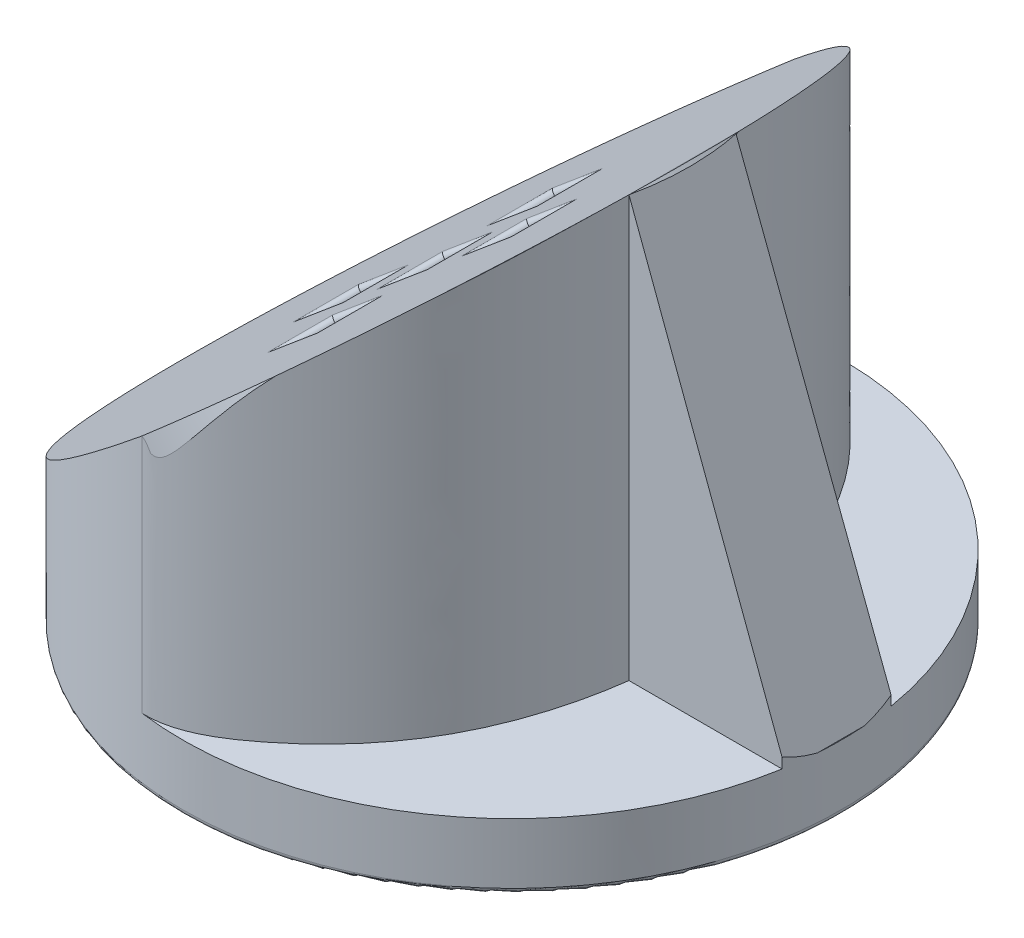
ISO-10303-21;
HEADER;
FILE_DESCRIPTION(('STEP AP214'),'2;1');
FILE_NAME('part.step','',(''),(''),'','','');
FILE_SCHEMA(('AUTOMOTIVE_DESIGN { 1 0 10303 214 1 1 1 1 }'));
ENDSEC;
DATA;
#1=APPLICATION_CONTEXT('core data for automotive mechanical design processes');
#2=APPLICATION_PROTOCOL_DEFINITION('international standard','automotive_design',2000,#1);
#3=PRODUCT_CONTEXT('',#1,'mechanical');
#4=PRODUCT('Part','Part','',(#3));
#5=PRODUCT_RELATED_PRODUCT_CATEGORY('part','',(#4));
#6=PRODUCT_DEFINITION_FORMATION('','',#4);
#7=PRODUCT_DEFINITION_CONTEXT('part definition',#1,'design');
#8=PRODUCT_DEFINITION('design','',#6,#7);
#9=PRODUCT_DEFINITION_SHAPE('','',#8);
#10=(LENGTH_UNIT() NAMED_UNIT(*) SI_UNIT(.MILLI.,.METRE.));
#11=(NAMED_UNIT(*) PLANE_ANGLE_UNIT() SI_UNIT($,.RADIAN.));
#12=(NAMED_UNIT(*) SI_UNIT($,.STERADIAN.) SOLID_ANGLE_UNIT());
#13=UNCERTAINTY_MEASURE_WITH_UNIT(LENGTH_MEASURE(1.E-05),#10,'distance_accuracy_value','');
#14=(GEOMETRIC_REPRESENTATION_CONTEXT(3) GLOBAL_UNCERTAINTY_ASSIGNED_CONTEXT((#13)) GLOBAL_UNIT_ASSIGNED_CONTEXT((#10,
#11,#12)) REPRESENTATION_CONTEXT('',''));
#15=CARTESIAN_POINT('',(0.,0.,0.));
#16=DIRECTION('',(0.,0.,1.));
#17=DIRECTION('',(1.,0.,0.));
#18=AXIS2_PLACEMENT_3D('',#15,#16,#17);
#19=CARTESIAN_POINT('',(-30.,6.,-41.5));
#20=DIRECTION('',(0.642787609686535,-0.766044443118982,0.));
#21=DIRECTION('',(0.766044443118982,0.642787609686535,0.));
#22=AXIS2_PLACEMENT_3D('',#19,#20,#21);
#23=PLANE('',#22);
#24=DIRECTION('',(-0.766044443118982,-0.642787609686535,0.));
#25=VECTOR('',#24,1.);
#26=CARTESIAN_POINT('',(-30.,6.00000000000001,-13.));
#27=LINE('',#26,#25);
#28=CARTESIAN_POINT('',(-9.31680003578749,23.3552654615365,-13.));
#29=VERTEX_POINT('',#28);
#30=CARTESIAN_POINT('',(-4.7205333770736,27.2119911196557,-13.));
#31=VERTEX_POINT('',#30);
#32=EDGE_CURVE('E2193',#29,#31,#27,.F.);
#33=ORIENTED_EDGE('',*,*,#32,.T.);
#34=DIRECTION('',(0.,0.,-1.));
#35=VECTOR('',#34,1.);
#36=CARTESIAN_POINT('',(-4.7205333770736,27.2119911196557,-41.5));
#37=LINE('',#36,#35);
#38=CARTESIAN_POINT('',(-4.7205333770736,27.2119911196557,-7.));
#39=VERTEX_POINT('',#38);
#40=EDGE_CURVE('E2189',#31,#39,#37,.F.);
#41=ORIENTED_EDGE('',*,*,#40,.T.);
#42=DIRECTION('',(0.766044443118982,0.642787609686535,0.));
#43=VECTOR('',#42,1.);
#44=CARTESIAN_POINT('',(-30.,6.,-6.99999999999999));
#45=LINE('',#44,#43);
#46=CARTESIAN_POINT('',(-9.31680003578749,23.3552654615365,-7.));
#47=VERTEX_POINT('',#46);
#48=EDGE_CURVE('E2192',#39,#47,#45,.F.);
#49=ORIENTED_EDGE('',*,*,#48,.T.);
#50=DIRECTION('',(0.,0.,1.));
#51=VECTOR('',#50,1.);
#52=CARTESIAN_POINT('',(-9.31680003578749,23.3552654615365,-41.5));
#53=LINE('',#52,#51);
#54=EDGE_CURVE('E2172',#47,#29,#53,.F.);
#55=ORIENTED_EDGE('',*,*,#54,.T.);
#56=EDGE_LOOP('',(#33,#41,#49,#55));
#57=FACE_BOUND('',#56,.T.);
#58=DIRECTION('',(-0.766044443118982,-0.642787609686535,0.));
#59=VECTOR('',#58,1.);
#60=CARTESIAN_POINT('',(-30.,6.,-3.));
#61=LINE('',#60,#59);
#62=CARTESIAN_POINT('',(-1.65635560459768,29.7831415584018,-3.));
#63=VERTEX_POINT('',#62);
#64=CARTESIAN_POINT('',(2.93991105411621,33.639867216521,-3.));
#65=VERTEX_POINT('',#64);
#66=EDGE_CURVE('E2170',#63,#65,#61,.F.);
#67=ORIENTED_EDGE('',*,*,#66,.T.);
#68=DIRECTION('',(0.,0.,-1.));
#69=VECTOR('',#68,1.);
#70=CARTESIAN_POINT('',(2.93991105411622,33.639867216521,-41.5));
#71=LINE('',#70,#69);
#72=CARTESIAN_POINT('',(2.93991105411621,33.639867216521,3.));
#73=VERTEX_POINT('',#72);
#74=EDGE_CURVE('E2166',#65,#73,#71,.F.);
#75=ORIENTED_EDGE('',*,*,#74,.T.);
#76=DIRECTION('',(0.766044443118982,0.642787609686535,0.));
#77=VECTOR('',#76,1.);
#78=CARTESIAN_POINT('',(-30.,6.00000000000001,3.00000000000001));
#79=LINE('',#78,#77);
#80=CARTESIAN_POINT('',(-1.65635560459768,29.7831415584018,3.));
#81=VERTEX_POINT('',#80);
#82=EDGE_CURVE('E2169',#73,#81,#79,.F.);
#83=ORIENTED_EDGE('',*,*,#82,.T.);
#84=DIRECTION('',(0.,0.,1.));
#85=VECTOR('',#84,1.);
#86=CARTESIAN_POINT('',(-1.65635560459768,29.7831415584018,-41.5));
#87=LINE('',#86,#85);
#88=EDGE_CURVE('E2146',#81,#63,#87,.F.);
#89=ORIENTED_EDGE('',*,*,#88,.T.);
#90=EDGE_LOOP('',(#67,#75,#83,#89));
#91=FACE_BOUND('',#90,.T.);
#92=DIRECTION('',(-0.766044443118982,-0.642787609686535,0.));
#93=VECTOR('',#92,1.);
#94=CARTESIAN_POINT('',(-30.,6.,-3.));
#95=LINE('',#94,#93);
#96=CARTESIAN_POINT('',(-16.9772444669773,16.9273893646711,-3.));
#97=VERTEX_POINT('',#96);
#98=CARTESIAN_POINT('',(-12.3809778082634,20.7841150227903,-3.));
#99=VERTEX_POINT('',#98);
#100=EDGE_CURVE('E2144',#97,#99,#95,.F.);
#101=ORIENTED_EDGE('',*,*,#100,.T.);
#102=DIRECTION('',(0.,0.,-1.));
#103=VECTOR('',#102,1.);
#104=CARTESIAN_POINT('',(-12.3809778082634,20.7841150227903,-41.5));
#105=LINE('',#104,#103);
#106=CARTESIAN_POINT('',(-12.3809778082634,20.7841150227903,3.));
#107=VERTEX_POINT('',#106);
#108=EDGE_CURVE('E2140',#99,#107,#105,.F.);
#109=ORIENTED_EDGE('',*,*,#108,.T.);
#110=DIRECTION('',(0.766044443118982,0.642787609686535,0.));
#111=VECTOR('',#110,1.);
#112=CARTESIAN_POINT('',(-30.,6.,3.));
#113=LINE('',#112,#111);
#114=CARTESIAN_POINT('',(-16.9772444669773,16.9273893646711,3.));
#115=VERTEX_POINT('',#114);
#116=EDGE_CURVE('E2143',#107,#115,#113,.F.);
#117=ORIENTED_EDGE('',*,*,#116,.T.);
#118=DIRECTION('',(0.,0.,1.));
#119=VECTOR('',#118,1.);
#120=CARTESIAN_POINT('',(-16.9772444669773,16.9273893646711,-41.5));
#121=LINE('',#120,#119);
#122=EDGE_CURVE('E2147',#115,#97,#121,.F.);
#123=ORIENTED_EDGE('',*,*,#122,.T.);
#124=EDGE_LOOP('',(#101,#109,#117,#123));
#125=FACE_BOUND('',#124,.T.);
#126=DIRECTION('',(-0.766044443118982,-0.642787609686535,0.));
#127=VECTOR('',#126,1.);
#128=CARTESIAN_POINT('',(-30.,6.00000000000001,7.00000000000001));
#129=LINE('',#128,#127);
#130=CARTESIAN_POINT('',(-9.3168000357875,23.3552654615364,7.));
#131=VERTEX_POINT('',#130);
#132=CARTESIAN_POINT('',(-4.72053337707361,27.2119911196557,7.));
#133=VERTEX_POINT('',#132);
#134=EDGE_CURVE('E2149',#131,#133,#129,.F.);
#135=ORIENTED_EDGE('',*,*,#134,.T.);
#136=DIRECTION('',(0.,0.,-1.));
#137=VECTOR('',#136,1.);
#138=CARTESIAN_POINT('',(-4.7205333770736,27.2119911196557,-41.5));
#139=LINE('',#138,#137);
#140=CARTESIAN_POINT('',(-4.72053337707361,27.2119911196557,13.));
#141=VERTEX_POINT('',#140);
#142=EDGE_CURVE('E2267',#133,#141,#139,.F.);
#143=ORIENTED_EDGE('',*,*,#142,.T.);
#144=DIRECTION('',(0.766044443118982,0.642787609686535,0.));
#145=VECTOR('',#144,1.);
#146=CARTESIAN_POINT('',(-30.,6.,13.));
#147=LINE('',#146,#145);
#148=CARTESIAN_POINT('',(-9.3168000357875,23.3552654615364,13.));
#149=VERTEX_POINT('',#148);
#150=EDGE_CURVE('E2269',#141,#149,#147,.F.);
#151=ORIENTED_EDGE('',*,*,#150,.T.);
#152=DIRECTION('',(0.,0.,1.));
#153=VECTOR('',#152,1.);
#154=CARTESIAN_POINT('',(-9.31680003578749,23.3552654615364,-41.5));
#155=LINE('',#154,#153);
#156=EDGE_CURVE('E2233',#149,#131,#155,.F.);
#157=ORIENTED_EDGE('',*,*,#156,.T.);
#158=EDGE_LOOP('',(#135,#143,#151,#157));
#159=FACE_BOUND('',#158,.T.);
#160=DIRECTION('',(-0.766044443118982,-0.642787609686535,0.));
#161=VECTOR('',#160,1.);
#162=CARTESIAN_POINT('',(-30.,6.,-3.));
#163=LINE('',#162,#161);
#164=CARTESIAN_POINT('',(-9.3168000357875,23.3552654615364,-3.));
#165=VERTEX_POINT('',#164);
#166=CARTESIAN_POINT('',(-4.72053337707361,27.2119911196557,-3.));
#167=VERTEX_POINT('',#166);
#168=EDGE_CURVE('E2225',#165,#167,#163,.F.);
#169=ORIENTED_EDGE('',*,*,#168,.T.);
#170=DIRECTION('',(0.,0.,-1.));
#171=VECTOR('',#170,1.);
#172=CARTESIAN_POINT('',(-4.7205333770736,27.2119911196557,-41.5));
#173=LINE('',#172,#171);
#174=CARTESIAN_POINT('',(-4.72053337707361,27.2119911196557,3.));
#175=VERTEX_POINT('',#174);
#176=EDGE_CURVE('E2227',#167,#175,#173,.F.);
#177=ORIENTED_EDGE('',*,*,#176,.T.);
#178=DIRECTION('',(0.766044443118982,0.642787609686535,0.));
#179=VECTOR('',#178,1.);
#180=CARTESIAN_POINT('',(-30.,6.00000000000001,3.00000000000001));
#181=LINE('',#180,#179);
#182=CARTESIAN_POINT('',(-9.3168000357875,23.3552654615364,3.));
#183=VERTEX_POINT('',#182);
#184=EDGE_CURVE('E2240',#175,#183,#181,.F.);
#185=ORIENTED_EDGE('',*,*,#184,.T.);
#186=DIRECTION('',(0.,0.,1.));
#187=VECTOR('',#186,1.);
#188=CARTESIAN_POINT('',(-9.31680003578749,23.3552654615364,-41.5));
#189=LINE('',#188,#187);
#190=EDGE_CURVE('E2229',#183,#165,#189,.F.);
#191=ORIENTED_EDGE('',*,*,#190,.T.);
#192=EDGE_LOOP('',(#169,#177,#185,#191));
#193=FACE_BOUND('',#192,.T.);
#194=DIRECTION('',(0.,0.,1.));
#195=VECTOR('',#194,1.);
#196=CARTESIAN_POINT('',(15.6412335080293,44.2975422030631,-41.5));
#197=LINE('',#196,#195);
#198=CARTESIAN_POINT('',(15.6412473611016,44.2975384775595,-4.99995133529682));
#199=VERTEX_POINT('',#198);
#200=CARTESIAN_POINT('',(15.6412335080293,44.2975422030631,5.00000000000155));
#201=VERTEX_POINT('',#200);
#202=EDGE_CURVE('E76',#199,#201,#197,.T.);
#203=ORIENTED_EDGE('',*,*,#202,.F.);
#204=CARTESIAN_POINT('',(13.3263207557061,42.3550997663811,-13.9515714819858));
#205=CARTESIAN_POINT('',(13.4675686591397,42.4735007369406,-13.6007400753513));
#206=CARTESIAN_POINT('',(13.6035246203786,42.5873977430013,-13.2462549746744));
#207=CARTESIAN_POINT('',(13.8643383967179,42.8058335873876,-12.5312405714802));
#208=CARTESIAN_POINT('',(13.9892175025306,42.9103903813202,-12.1707245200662));
#209=CARTESIAN_POINT('',(14.2277804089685,43.1101446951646,-11.4439547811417));
#210=CARTESIAN_POINT('',(14.3414771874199,43.20535306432,-11.0777083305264));
#211=CARTESIAN_POINT('',(14.5701599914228,43.3969537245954,-10.2968825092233));
#212=CARTESIAN_POINT('',(14.683770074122,43.4922058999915,-9.88161830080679));
#213=CARTESIAN_POINT('',(14.8751389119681,43.6528523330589,-9.12996103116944));
#214=CARTESIAN_POINT('',(14.9554926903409,43.7203816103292,-8.79467881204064));
#215=CARTESIAN_POINT('',(15.1167187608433,43.8559674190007,-8.0778282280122));
#216=CARTESIAN_POINT('',(15.1963614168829,43.9230021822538,-7.6957882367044));
#217=CARTESIAN_POINT('',(15.3437085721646,44.0470672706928,-6.92931455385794));
#218=CARTESIAN_POINT('',(15.4114563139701,44.1041338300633,-6.54489502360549));
#219=CARTESIAN_POINT('',(15.5351318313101,44.2082735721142,-5.77405792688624));
#220=CARTESIAN_POINT('',(15.5910955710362,44.2553771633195,-5.38765023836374));
#221=CARTESIAN_POINT('',(15.6412561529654,44.2975305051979,-4.99995160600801));
#222=B_SPLINE_CURVE_WITH_KNOTS('',3,(#204,#205,#206,#207,#208,#209,#210,#211,#212,#213,#214,
#215,#216,#217,#218,#219,#220,#221),.UNSPECIFIED.,.F.,.F.,(4,2,2,2,2,2,2,2,4),(0.,
1.18882280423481,2.37530869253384,3.5604009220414,4.88275544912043,5.93653851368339,
7.12412348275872,8.30729746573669,9.48680637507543),.UNSPECIFIED.);
#223=CARTESIAN_POINT('',(13.3263207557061,42.3550997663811,-13.9515714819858));
#224=VERTEX_POINT('',#223);
#225=EDGE_CURVE('E514',#199,#224,#222,.F.);
#226=ORIENTED_EDGE('',*,*,#225,.T.);
#227=CARTESIAN_POINT('',(12.7899645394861,41.9050434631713,-15.2100850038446));
#228=CARTESIAN_POINT('',(12.8133478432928,41.9246643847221,-15.1581720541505));
#229=CARTESIAN_POINT('',(12.8366120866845,41.9441854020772,-15.1061677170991));
#230=CARTESIAN_POINT('',(12.8828786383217,41.9830076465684,-15.0020300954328));
#231=CARTESIAN_POINT('',(12.9058811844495,42.0023090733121,-14.9498969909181));
#232=CARTESIAN_POINT('',(12.9516243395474,42.0406921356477,-14.8455042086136));
#233=CARTESIAN_POINT('',(12.974365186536,42.0597739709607,-14.7932447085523));
#234=CARTESIAN_POINT('',(13.0195849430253,42.0977178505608,-14.6886015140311));
#235=CARTESIAN_POINT('',(13.0420640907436,42.1165800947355,-14.6362179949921));
#236=CARTESIAN_POINT('',(13.086760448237,42.1540847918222,-14.5313291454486));
#237=CARTESIAN_POINT('',(13.1089778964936,42.1727274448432,-14.4788239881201));
#238=CARTESIAN_POINT('',(13.1531508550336,42.2097929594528,-14.3736942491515));
#239=CARTESIAN_POINT('',(13.1751066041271,42.2282160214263,-14.3210698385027));
#240=CARTESIAN_POINT('',(13.2187561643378,42.2648423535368,-14.215703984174));
#241=CARTESIAN_POINT('',(13.2404502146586,42.2830458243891,-14.1629627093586));
#242=CARTESIAN_POINT('',(13.2835763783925,42.3192329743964,-14.0573655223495));
#243=CARTESIAN_POINT('',(13.3050087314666,42.3372168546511,-14.0045097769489));
#244=CARTESIAN_POINT('',(13.3263207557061,42.3550997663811,-13.9515714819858));
#245=B_SPLINE_CURVE_WITH_KNOTS('',3,(#227,#228,#229,#230,#231,#232,#233,#234,#235,#236,#237,
#238,#239,#240,#241,#242,#243,#244),.UNSPECIFIED.,.F.,.F.,(4,2,2,2,2,2,2,2,4),(0.,
0.180666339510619,0.36115267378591,0.541459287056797,0.721586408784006,0.901534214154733,
1.08130282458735,1.26089230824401,1.44030268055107),.UNSPECIFIED.);
#246=CARTESIAN_POINT('',(12.7899645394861,41.9050434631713,-15.2100850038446));
#247=VERTEX_POINT('',#246);
#248=EDGE_CURVE('E589',#224,#247,#245,.F.);
#249=ORIENTED_EDGE('',*,*,#248,.T.);
#250=CARTESIAN_POINT('',(7.74553276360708,37.6722626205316,-22.9900011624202));
#251=CARTESIAN_POINT('',(8.00582766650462,37.8898412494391,-22.7056089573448));
#252=CARTESIAN_POINT('',(8.26121513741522,38.1034919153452,-22.4137185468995));
#253=CARTESIAN_POINT('',(8.75881520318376,38.5200644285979,-21.8189520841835));
#254=CARTESIAN_POINT('',(9.00114570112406,38.7230815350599,-21.5162413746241));
#255=CARTESIAN_POINT('',(9.47271029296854,39.1183848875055,-20.9006322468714));
#256=CARTESIAN_POINT('',(9.70205823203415,39.310763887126,-20.5878805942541));
#257=CARTESIAN_POINT('',(10.1477451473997,39.6847952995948,-19.9529986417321));
#258=CARTESIAN_POINT('',(10.3641941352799,39.8665380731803,-19.6309987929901));
#259=CARTESIAN_POINT('',(10.7841676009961,40.2192993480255,-18.9784221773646));
#260=CARTESIAN_POINT('',(10.987798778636,40.3904061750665,-18.6479618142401));
#261=CARTESIAN_POINT('',(11.3822213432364,40.721898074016,-17.9792639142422));
#262=CARTESIAN_POINT('',(11.5731167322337,40.8823698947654,-17.6411307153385));
#263=CARTESIAN_POINT('',(11.9421505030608,41.1925930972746,-16.9578830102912));
#264=CARTESIAN_POINT('',(12.1203909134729,41.3424302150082,-16.6128625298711));
#265=CARTESIAN_POINT('',(12.4642003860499,41.6313868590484,-15.9166359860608));
#266=CARTESIAN_POINT('',(12.6298702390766,41.7705917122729,-15.5655151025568));
#267=CARTESIAN_POINT('',(12.7899645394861,41.9050434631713,-15.2100850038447));
#268=B_SPLINE_CURVE_WITH_KNOTS('',3,(#250,#251,#252,#253,#254,#255,#256,#257,#258,#259,#260,
#261,#262,#263,#264,#265,#266,#267),.UNSPECIFIED.,.F.,.F.,(4,2,2,2,2,2,2,2,4),(0.,
1.32795757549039,2.64061323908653,3.93898015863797,5.22391885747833,6.49614241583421,
7.75622281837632,9.00459829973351,10.2415815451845),.UNSPECIFIED.);
#269=CARTESIAN_POINT('',(7.74553276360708,37.6722626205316,-22.9900011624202));
#270=VERTEX_POINT('',#269);
#271=EDGE_CURVE('E587',#247,#270,#268,.F.);
#272=ORIENTED_EDGE('',*,*,#271,.T.);
#273=CARTESIAN_POINT('',(2.92180499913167,33.6246744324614,-27.0483635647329));
#274=CARTESIAN_POINT('',(3.14917677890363,33.8154614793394,-26.9056381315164));
#275=CARTESIAN_POINT('',(3.37475543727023,34.0047352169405,-26.7580364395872));
#276=CARTESIAN_POINT('',(3.81885241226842,34.3773513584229,-26.4554794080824));
#277=CARTESIAN_POINT('',(4.03742567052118,34.5607399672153,-26.3006616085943));
#278=CARTESIAN_POINT('',(4.46749841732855,34.921584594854,-25.9842331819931));
#279=CARTESIAN_POINT('',(4.67905452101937,35.0990880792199,-25.8227536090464));
#280=CARTESIAN_POINT('',(5.09508548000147,35.4481615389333,-25.4935451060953));
#281=CARTESIAN_POINT('',(5.29961859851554,35.6197802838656,-25.3259415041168));
#282=CARTESIAN_POINT('',(5.7016001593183,35.9570832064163,-24.9850103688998));
#283=CARTESIAN_POINT('',(5.8991085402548,36.1228175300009,-24.8118031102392));
#284=CARTESIAN_POINT('',(6.28704147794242,36.4483503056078,-24.4601725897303));
#285=CARTESIAN_POINT('',(6.47752769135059,36.6082003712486,-24.2818651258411));
#286=CARTESIAN_POINT('',(6.85142165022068,36.9219638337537,-23.9205254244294));
#287=CARTESIAN_POINT('',(7.03489282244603,37.0759304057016,-23.7376049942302));
#288=CARTESIAN_POINT('',(7.39476481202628,37.3779236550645,-23.3675124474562));
#289=CARTESIAN_POINT('',(7.57123091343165,37.5260052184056,-23.180448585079));
#290=CARTESIAN_POINT('',(7.74553276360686,37.6722626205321,-22.9900011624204));
#291=B_SPLINE_CURVE_WITH_KNOTS('',3,(#273,#274,#275,#276,#277,#278,#279,#280,#281,#282,#283,
#284,#285,#286,#287,#288,#289,#290),.UNSPECIFIED.,.F.,.F.,(4,2,2,2,2,2,2,2,4),(0.,
0.987988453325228,1.96166135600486,2.92121533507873,3.86678903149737,4.79847031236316,
5.71630316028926,6.62029422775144,7.51041905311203),.UNSPECIFIED.);
#292=CARTESIAN_POINT('',(2.92180499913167,33.6246744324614,-27.0483635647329));
#293=VERTEX_POINT('',#292);
#294=EDGE_CURVE('E591',#270,#293,#291,.F.);
#295=ORIENTED_EDGE('',*,*,#294,.T.);
#296=CARTESIAN_POINT('',(-7.01866670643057,25.2836282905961,0.));
#297=DIRECTION('',(-0.642787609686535,0.766044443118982,0.));
#298=DIRECTION('',(-0.766044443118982,-0.642787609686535,0.));
#299=AXIS2_PLACEMENT_3D('',#296,#297,#298);
#300=CIRCLE('',#299,30.);
#301=CARTESIAN_POINT('',(-3.9742299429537,27.8382140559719,-29.7355930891));
#302=VERTEX_POINT('',#301);
#303=EDGE_CURVE('E637',#293,#302,#300,.T.);
#304=ORIENTED_EDGE('',*,*,#303,.T.);
#305=CARTESIAN_POINT('',(0.,31.1729889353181,0.));
#306=DIRECTION('',(0.642787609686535,-0.766044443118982,0.));
#307=DIRECTION('',(-0.766044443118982,-0.642787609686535,0.));
#308=AXIS2_PLACEMENT_3D('',#305,#306,#307);
#309=ELLIPSE('',#308,39.1622186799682,30.);
#310=CARTESIAN_POINT('',(-3.97422994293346,27.838214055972,29.7355930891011));
#311=VERTEX_POINT('',#310);
#312=EDGE_CURVE('E986',#311,#302,#309,.T.);
#313=ORIENTED_EDGE('',*,*,#312,.F.);
#314=CARTESIAN_POINT('',(4.46112010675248,34.9163131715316,25.9889568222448));
#315=VERTEX_POINT('',#314);
#316=EDGE_CURVE('E640',#311,#315,#300,.T.);
#317=ORIENTED_EDGE('',*,*,#316,.T.);
#318=CARTESIAN_POINT('',(-5.28396610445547,26.7392149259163,29.5309956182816));
#319=CARTESIAN_POINT('',(-5.19209404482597,26.8163047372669,29.5548087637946));
#320=CARTESIAN_POINT('',(-5.09992711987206,26.8936419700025,29.5766358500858));
#321=CARTESIAN_POINT('',(-4.91509595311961,27.0487337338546,29.6163207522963));
#322=CARTESIAN_POINT('',(-4.82243172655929,27.1264882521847,29.6341786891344));
#323=CARTESIAN_POINT('',(-4.54420264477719,27.3599501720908,29.6817401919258));
#324=CARTESIAN_POINT('',(-4.3580253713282,27.5161714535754,29.705528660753));
#325=CARTESIAN_POINT('',(-3.98503032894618,27.8291514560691,29.7375552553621));
#326=CARTESIAN_POINT('',(-3.79821305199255,27.9859097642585,29.7458034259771));
#327=CARTESIAN_POINT('',(-3.4286449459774,28.2960142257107,29.7472929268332));
#328=CARTESIAN_POINT('',(-3.2458947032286,28.4493598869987,29.7408591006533));
#329=CARTESIAN_POINT('',(-2.88090756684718,28.7556204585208,29.7143184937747));
#330=CARTESIAN_POINT('',(-2.69867093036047,28.9085351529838,29.6942057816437));
#331=CARTESIAN_POINT('',(-2.33527303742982,29.2134621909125,29.6411041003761));
#332=CARTESIAN_POINT('',(-2.15411205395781,29.3654743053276,29.608111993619));
#333=CARTESIAN_POINT('',(-1.72704166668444,29.7238289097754,29.5158090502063));
#334=CARTESIAN_POINT('',(-1.48178978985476,29.9296196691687,29.4512823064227));
#335=CARTESIAN_POINT('',(-0.994871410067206,30.3381927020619,29.3021516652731));
#336=CARTESIAN_POINT('',(-0.753205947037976,30.540974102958,29.2175420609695));
#337=CARTESIAN_POINT('',(-0.273967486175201,30.9431029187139,29.0305834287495));
#338=CARTESIAN_POINT('',(-0.0363944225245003,31.1424503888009,28.928234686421));
#339=CARTESIAN_POINT('',(0.43730736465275,31.5399333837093,28.7066501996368));
#340=CARTESIAN_POINT('',(0.673383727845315,31.7380249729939,28.5872249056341));
#341=CARTESIAN_POINT('',(1.14108495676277,32.1304729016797,28.3345330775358));
#342=CARTESIAN_POINT('',(1.37271048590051,32.3248297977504,28.2012686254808));
#343=CARTESIAN_POINT('',(1.83171457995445,32.7099799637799,27.9227130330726));
#344=CARTESIAN_POINT('',(2.05909221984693,32.9007724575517,27.7774193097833));
#345=CARTESIAN_POINT('',(2.65130986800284,33.397702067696,27.382009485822));
#346=CARTESIAN_POINT('',(3.01280983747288,33.7010365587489,27.1233624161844));
#347=CARTESIAN_POINT('',(3.72653588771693,34.2999238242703,26.5847802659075));
#348=CARTESIAN_POINT('',(4.07875649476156,34.5954720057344,26.3048329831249));
#349=CARTESIAN_POINT('',(4.77582937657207,35.1803856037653,25.7290413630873));
#350=CARTESIAN_POINT('',(5.12067613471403,35.4697463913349,25.4331856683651));
#351=CARTESIAN_POINT('',(5.80180222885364,36.0412790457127,24.8246899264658));
#352=CARTESIAN_POINT('',(6.13807803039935,36.3234479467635,24.5120431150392));
#353=CARTESIAN_POINT('',(6.79918708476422,36.878184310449,23.8703787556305));
#354=CARTESIAN_POINT('',(7.12406212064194,37.1507868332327,23.541434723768));
#355=CARTESIAN_POINT('',(7.76213051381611,37.686189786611,22.8653750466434));
#356=CARTESIAN_POINT('',(8.075332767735,37.9489976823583,22.5182737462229));
#357=CARTESIAN_POINT('',(8.68847907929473,38.4634885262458,21.8052614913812));
#358=CARTESIAN_POINT('',(8.98843372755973,38.7151803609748,21.4393660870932));
#359=CARTESIAN_POINT('',(9.57357962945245,39.2061760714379,20.6881962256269));
#360=CARTESIAN_POINT('',(9.85877633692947,39.4454845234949,20.3029290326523));
#361=CARTESIAN_POINT('',(10.3451532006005,39.8536031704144,19.6092943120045));
#362=CARTESIAN_POINT('',(10.5498465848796,40.0253613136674,19.3051153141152));
#363=CARTESIAN_POINT('',(10.9492436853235,40.3604952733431,18.6855911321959));
#364=CARTESIAN_POINT('',(11.1439441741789,40.5238683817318,18.3702423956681));
#365=CARTESIAN_POINT('',(11.5225827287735,40.8415838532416,17.7286552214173));
#366=CARTESIAN_POINT('',(11.7065194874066,40.9959251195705,17.4024154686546));
#367=CARTESIAN_POINT('',(12.0632281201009,41.295239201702,16.7396897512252));
#368=CARTESIAN_POINT('',(12.2359998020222,41.4402118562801,16.4032036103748));
#369=CARTESIAN_POINT('',(12.5700985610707,41.7205540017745,15.7210286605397));
#370=CARTESIAN_POINT('',(12.7314337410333,41.855930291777,15.3753466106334));
#371=CARTESIAN_POINT('',(13.0426376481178,42.1170613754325,14.6753073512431));
#372=CARTESIAN_POINT('',(13.1925065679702,42.2428163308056,14.320950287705));
#373=CARTESIAN_POINT('',(13.4806638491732,42.4846089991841,13.6043319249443));
#374=CARTESIAN_POINT('',(13.6189528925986,42.6006472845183,13.2420710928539));
#375=CARTESIAN_POINT('',(13.8838547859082,42.8229263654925,12.5104263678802));
#376=CARTESIAN_POINT('',(14.0104696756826,42.9291688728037,12.1410437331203));
#377=CARTESIAN_POINT('',(14.2483910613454,43.1288086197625,11.4069218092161));
#378=CARTESIAN_POINT('',(14.360041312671,43.2224943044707,11.0423721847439));
#379=CARTESIAN_POINT('',(14.5722586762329,43.4005658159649,10.307897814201));
#380=CARTESIAN_POINT('',(14.6728279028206,43.4849534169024,9.93797410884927));
#381=CARTESIAN_POINT('',(14.8628679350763,43.6444159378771,9.19333046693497));
#382=CARTESIAN_POINT('',(14.9523395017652,43.7194914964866,8.81861086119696));
#383=CARTESIAN_POINT('',(15.1201752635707,43.860322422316,8.06485888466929));
#384=CARTESIAN_POINT('',(15.1985367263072,43.9260754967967,7.68582547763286));
#385=CARTESIAN_POINT('',(15.3441116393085,44.0482273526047,6.92410304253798));
#386=CARTESIAN_POINT('',(15.4113244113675,44.1046255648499,6.54141379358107));
#387=CARTESIAN_POINT('',(15.5344297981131,44.207923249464,5.77290813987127));
#388=CARTESIAN_POINT('',(15.5903213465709,44.2548218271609,5.38709144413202));
#389=CARTESIAN_POINT('',(15.6404627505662,44.29689546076,5.));
#390=B_SPLINE_CURVE_WITH_KNOTS('',3,(#318,#319,#320,#321,#322,#323,#324,#325,#326,#327,#328,
#329,#330,#331,#332,#333,#334,#335,#336,#337,#338,#339,#340,#341,#342,#343,#344,#345,#346,#347,
#348,#349,#350,#351,#352,#353,#354,#355,#356,#357,#358,#359,#360,#361,#362,#363,#364,#365,#366,
#367,#368,#369,#370,#371,#372,#373,#374,#375,#376,#377,#378,#379,#380,#381,#382,#383,#384,#385,
#386,#387,#388,#389),.UNSPECIFIED.,.F.,.F.,(4,2,2,2,2,2,2,2,2,2,2,2,2,2,2,2,2,2,2,2,2,2,2,2,2,2,
2,2,2,2,2,2,2,2,2,4),(0.,0.366780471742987,0.733549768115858,1.46559012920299,2.19715715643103,
2.91269538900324,3.62854409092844,4.34456729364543,5.32357871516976,6.30286867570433,
7.28214287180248,8.27327999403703,9.26426821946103,10.2554697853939,11.8690944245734,
13.483650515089,15.0993749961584,16.7157553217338,18.3254112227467,19.933814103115,
21.540906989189,23.1474016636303,24.3616980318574,25.5763841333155,26.7912174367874,
28.0060716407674,29.2200563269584,30.4340206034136,31.6479133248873,32.8615935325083,
34.0391053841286,35.2163921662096,36.393598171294,37.5710931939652,38.7486598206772,
39.926337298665),.UNSPECIFIED.);
#391=CARTESIAN_POINT('',(11.5557605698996,40.8694233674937,17.6656062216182));
#392=VERTEX_POINT('',#391);
#393=EDGE_CURVE('E651',#315,#392,#390,.T.);
#394=ORIENTED_EDGE('',*,*,#393,.T.);
#395=CARTESIAN_POINT('',(15.3340884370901,44.0398168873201,6.96848095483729));
#396=VERTEX_POINT('',#395);
#397=EDGE_CURVE('E648',#392,#396,#300,.T.);
#398=ORIENTED_EDGE('',*,*,#397,.T.);
#399=CARTESIAN_POINT('',(15.6404627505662,44.29689546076,5.));
#400=VERTEX_POINT('',#399);
#401=EDGE_CURVE('E617',#396,#400,#390,.T.);
#402=ORIENTED_EDGE('',*,*,#401,.T.);
#403=DIRECTION('',(0.766044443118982,0.642787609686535,0.));
#404=VECTOR('',#403,1.);
#405=CARTESIAN_POINT('',(-30.000000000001,5.99999999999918,4.99999999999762));
#406=LINE('',#405,#404);
#407=EDGE_CURVE('E505',#400,#201,#406,.T.);
#408=ORIENTED_EDGE('',*,*,#407,.T.);
#409=EDGE_LOOP('',(#203,#226,#249,#272,#295,#304,#313,#317,#394,#398,#402,#408));
#410=FACE_BOUND('',#409,.T.);
#411=ADVANCED_FACE('F43',(#57,#91,#125,#159,#193,#410),#23,.F.);
#412=CARTESIAN_POINT('',(36.6651404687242,46.,-5.));
#413=DIRECTION('',(0.0128789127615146,0.,0.999917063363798));
#414=DIRECTION('',(0.999917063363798,0.,-0.0128789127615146));
#415=AXIS2_PLACEMENT_3D('',#412,#413,#414);
#416=PLANE('',#415);
#417=DIRECTION('',(0.,-1.,0.));
#418=VECTOR('',#417,1.);
#419=CARTESIAN_POINT('',(15.6752677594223,46.,-4.72965083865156));
#420=LINE('',#419,#418);
#421=CARTESIAN_POINT('',(15.6752677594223,44.2062901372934,-4.72965083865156));
#422=VERTEX_POINT('',#421);
#423=CARTESIAN_POINT('',(15.6752677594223,6.,-4.72965083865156));
#424=VERTEX_POINT('',#423);
#425=EDGE_CURVE('E511',#422,#424,#420,.T.);
#426=ORIENTED_EDGE('',*,*,#425,.F.);
#427=DIRECTION('',(0.349451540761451,-0.936943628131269,-0.00450092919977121));
#428=VECTOR('',#427,1.);
#429=CARTESIAN_POINT('',(17.6516102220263,38.9073537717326,-4.7551060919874));
#430=LINE('',#429,#428);
#431=CARTESIAN_POINT('',(29.595645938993,6.88320491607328,-4.9089450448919));
#432=VERTEX_POINT('',#431);
#433=EDGE_CURVE('E495',#422,#432,#430,.T.);
#434=ORIENTED_EDGE('',*,*,#433,.T.);
#435=DIRECTION('',(0.,-1.,0.));
#436=VECTOR('',#435,1.);
#437=CARTESIAN_POINT('',(29.595645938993,50.,-4.9089450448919));
#438=LINE('',#437,#436);
#439=CARTESIAN_POINT('',(29.595645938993,6.,-4.9089450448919));
#440=VERTEX_POINT('',#439);
#441=EDGE_CURVE('E693',#440,#432,#438,.F.);
#442=ORIENTED_EDGE('',*,*,#441,.F.);
#443=DIRECTION('',(-0.999917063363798,0.,0.0128789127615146));
#444=VECTOR('',#443,1.);
#445=CARTESIAN_POINT('',(36.6651404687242,6.,-5.));
#446=LINE('',#445,#444);
#447=EDGE_CURVE('E504',#440,#424,#446,.T.);
#448=ORIENTED_EDGE('',*,*,#447,.T.);
#449=EDGE_LOOP('',(#426,#434,#442,#448));
#450=FACE_BOUND('',#449,.T.);
#451=ADVANCED_FACE('F517',(#450),#416,.F.);
#452=CARTESIAN_POINT('',(15.6752677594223,46.,-4.72965083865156));
#453=CARTESIAN_POINT('',(15.289619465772,46.,-7.8837176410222));
#454=CARTESIAN_POINT('',(13.6550933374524,46.,-14.4644541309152));
#455=CARTESIAN_POINT('',(7.7581469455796,46.,-24.3838918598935));
#456=CARTESIAN_POINT('',(0.636219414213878,46.,-28.9417768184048));
#457=CARTESIAN_POINT('',(-3.9742299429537,46.,-29.7355930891));
#458=B_SPLINE_CURVE_WITH_KNOTS('',3,(#452,#453,#454,#455,#456,#457),.UNSPECIFIED.,.F.,.F.,(4,1,
1,4),(0.,0.121406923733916,0.256925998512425,0.431769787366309),.UNSPECIFIED.);
#459=DIRECTION('',(0.,-1.,0.));
#460=VECTOR('',#459,1.);
#461=SURFACE_OF_LINEAR_EXTRUSION('',#458,#460);
#462=ORIENTED_EDGE('',*,*,#225,.F.);
#463=CARTESIAN_POINT('',(15.6412335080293,44.2975422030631,-5.00012661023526));
#464=CARTESIAN_POINT('',(15.6470481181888,44.2819521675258,-4.95519387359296));
#465=CARTESIAN_POINT('',(15.6527916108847,44.2665528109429,-4.91018785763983));
#466=CARTESIAN_POINT('',(15.664136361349,44.2361354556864,-4.82002926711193));
#467=CARTESIAN_POINT('',(15.6697376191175,44.2211174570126,-4.77487669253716));
#468=CARTESIAN_POINT('',(15.6752677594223,44.2062901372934,-4.72965083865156));
#469=B_SPLINE_CURVE_WITH_KNOTS('',3,(#463,#464,#465,#466,#467,#468),.UNSPECIFIED.,.F.,.F.,(4,2,
4),(0.,0.143739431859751,0.287478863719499),.UNSPECIFIED.);
#470=EDGE_CURVE('E498',#199,#422,#469,.T.);
#471=ORIENTED_EDGE('',*,*,#470,.T.);
#472=ORIENTED_EDGE('',*,*,#425,.T.);
#473=CARTESIAN_POINT('',(15.6752677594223,6.,-4.72965083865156));
#474=CARTESIAN_POINT('',(15.289619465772,6.,-7.8837176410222));
#475=CARTESIAN_POINT('',(13.6550933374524,6.,-14.4644541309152));
#476=CARTESIAN_POINT('',(7.7581469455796,6.,-24.3838918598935));
#477=CARTESIAN_POINT('',(0.636219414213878,6.,-28.9417768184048));
#478=CARTESIAN_POINT('',(-3.9742299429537,6.,-29.7355930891));
#479=B_SPLINE_CURVE_WITH_KNOTS('',3,(#473,#474,#475,#476,#477,#478),.UNSPECIFIED.,.F.,.F.,(4,1,
1,4),(0.,0.121406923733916,0.256925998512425,0.431769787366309),.UNSPECIFIED.);
#480=CARTESIAN_POINT('',(-3.9742299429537,6.,-29.7355930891));
#481=VERTEX_POINT('',#480);
#482=EDGE_CURVE('E520',#424,#481,#479,.T.);
#483=ORIENTED_EDGE('',*,*,#482,.T.);
#484=DIRECTION('',(0.,-1.,0.));
#485=VECTOR('',#484,1.);
#486=CARTESIAN_POINT('',(-3.9742299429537,46.,-29.7355930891));
#487=LINE('',#486,#485);
#488=EDGE_CURVE('E699',#302,#481,#487,.T.);
#489=ORIENTED_EDGE('',*,*,#488,.F.);
#490=CARTESIAN_POINT('',(-3.9742299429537,27.838214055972,-29.7355930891));
#491=CARTESIAN_POINT('',(-3.86015437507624,27.930902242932,-29.7159508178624));
#492=CARTESIAN_POINT('',(-3.74641006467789,28.0237627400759,-29.6952185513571));
#493=CARTESIAN_POINT('',(-3.51951973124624,28.2097016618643,-29.6515785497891));
#494=CARTESIAN_POINT('',(-3.40637370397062,28.3027800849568,-29.628670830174));
#495=CARTESIAN_POINT('',(-3.06774342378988,28.582146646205,-29.556692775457));
#496=CARTESIAN_POINT('',(-2.8430577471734,28.7685736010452,-29.5043659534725));
#497=CARTESIAN_POINT('',(-2.39565165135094,29.1411380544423,-29.3910797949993));
#498=CARTESIAN_POINT('',(-2.1729311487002,29.3272755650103,-29.3301208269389));
#499=CARTESIAN_POINT('',(-1.72942138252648,29.6988308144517,-29.1996257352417));
#500=CARTESIAN_POINT('',(-1.50863212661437,29.884248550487,-29.1300895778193));
#501=CARTESIAN_POINT('',(-0.849212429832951,30.4388922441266,-28.9087012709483));
#502=CARTESIAN_POINT('',(-0.413481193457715,30.8065495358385,-28.7440568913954));
#503=CARTESIAN_POINT('',(0.448869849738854,31.5349421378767,-28.3814765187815));
#504=CARTESIAN_POINT('',(0.875499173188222,31.8956846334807,-28.1835774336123));
#505=CARTESIAN_POINT('',(1.71912963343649,32.6088937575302,-27.7550415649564));
#506=CARTESIAN_POINT('',(2.13613111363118,32.9613606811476,-27.5244059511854));
#507=CARTESIAN_POINT('',(2.95925900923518,33.6564030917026,-27.0312547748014));
#508=CARTESIAN_POINT('',(3.36538603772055,33.9989791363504,-26.7687410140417));
#509=CARTESIAN_POINT('',(4.33401345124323,34.81480655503,-26.0956181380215));
#510=CARTESIAN_POINT('',(4.89041931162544,35.2824001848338,-25.6691676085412));
#511=CARTESIAN_POINT('',(5.70349148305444,35.964228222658,-24.9849735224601));
#512=CARTESIAN_POINT('',(5.9709526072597,36.1882659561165,-24.7494624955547));
#513=CARTESIAN_POINT('',(6.49823665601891,36.6295859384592,-24.2639572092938));
#514=CARTESIAN_POINT('',(6.75805969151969,36.8468682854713,-24.0139631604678));
#515=CARTESIAN_POINT('',(7.26941058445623,37.2743354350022,-23.5000177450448));
#516=CARTESIAN_POINT('',(7.5209407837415,37.484522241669,-23.2360703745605));
#517=CARTESIAN_POINT('',(8.01517794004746,37.8976631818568,-22.6946408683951));
#518=CARTESIAN_POINT('',(8.25788486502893,38.1006172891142,-22.4171586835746));
#519=CARTESIAN_POINT('',(8.97203279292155,38.6981854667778,-21.5651281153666));
#520=CARTESIAN_POINT('',(9.42961890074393,39.0816038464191,-20.9708772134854));
#521=CARTESIAN_POINT('',(10.3053305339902,39.8163626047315,-19.732977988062));
#522=CARTESIAN_POINT('',(10.7233642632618,40.16762830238,-19.0892207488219));
#523=CARTESIAN_POINT('',(11.5162870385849,40.8342651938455,-17.757940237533));
#524=CARTESIAN_POINT('',(11.8911739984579,41.1496346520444,-17.0704148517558));
#525=CARTESIAN_POINT('',(12.595454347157,41.7417264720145,-15.656586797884));
#526=CARTESIAN_POINT('',(12.9248496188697,42.0184504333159,-14.9302857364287));
#527=CARTESIAN_POINT('',(13.5360395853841,42.5309797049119,-13.4441013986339));
#528=CARTESIAN_POINT('',(13.8178429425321,42.7667924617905,-12.6842242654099));
#529=CARTESIAN_POINT('',(14.2648844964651,43.1410866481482,-11.3363540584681));
#530=CARTESIAN_POINT('',(14.4414289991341,43.2889748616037,-10.7546680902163));
#531=CARTESIAN_POINT('',(14.7661352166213,43.5612906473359,-9.57811579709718));
#532=CARTESIAN_POINT('',(14.9143019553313,43.685722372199,-8.98325182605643));
#533=CARTESIAN_POINT('',(15.1815516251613,43.9104467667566,-7.78342487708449));
#534=CARTESIAN_POINT('',(15.3006740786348,44.0107722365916,-7.17847683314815));
#535=CARTESIAN_POINT('',(15.5098511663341,44.1869473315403,-5.95993366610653));
#536=CARTESIAN_POINT('',(15.5999003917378,44.2627924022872,-5.34633695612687));
#537=CARTESIAN_POINT('',(15.6752677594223,44.3261003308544,-4.72965083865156));
#538=B_SPLINE_CURVE_WITH_KNOTS('',3,(#490,#491,#492,#493,#494,#495,#496,#497,#498,#499,#500,
#501,#502,#503,#504,#505,#506,#507,#508,#509,#510,#511,#512,#513,#514,#515,#516,#517,#518,#519,
#520,#521,#522,#523,#524,#525,#526,#527,#528,#529,#530,#531,#532,#533,#534,#535,#536,#537),
.UNSPECIFIED.,.F.,.F.,(4,2,2,2,2,2,2,2,2,2,2,2,2,2,2,2,2,2,2,2,2,2,2,4),(0.,0.444862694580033,
0.88972223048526,1.77940528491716,2.66905037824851,3.55869897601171,5.33780182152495,
7.11494300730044,8.8920207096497,10.6689980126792,13.1935591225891,14.4561004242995,
15.7186233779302,16.9807866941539,18.2429545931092,20.7667101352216,23.2961862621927,
25.825784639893,28.3552782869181,30.8843110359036,32.7600190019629,34.6353945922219,
36.5082038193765,38.3813612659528),.UNSPECIFIED.);
#539=EDGE_CURVE('E522',#302,#293,#538,.T.);
#540=ORIENTED_EDGE('',*,*,#539,.T.);
#541=ORIENTED_EDGE('',*,*,#294,.F.);
#542=ORIENTED_EDGE('',*,*,#271,.F.);
#543=ORIENTED_EDGE('',*,*,#248,.F.);
#544=EDGE_LOOP('',(#462,#471,#472,#483,#489,#540,#541,#542,#543));
#545=FACE_BOUND('',#544,.T.);
#546=ADVANCED_FACE('F509',(#545),#461,.F.);
#547=CARTESIAN_POINT('',(57.2600942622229,-51.3208160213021,0.));
#548=DIRECTION('',(-0.642787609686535,0.766044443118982,0.));
#549=DIRECTION('',(-0.766044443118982,-0.642787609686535,0.));
#550=AXIS2_PLACEMENT_3D('',#547,#548,#549);
#551=CYLINDRICAL_SURFACE('',#550,30.);
#552=CARTESIAN_POINT('',(4.46112010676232,34.9163131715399,25.9889568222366));
#553=CARTESIAN_POINT('',(4.31517365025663,34.7641297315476,26.1098316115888));
#554=CARTESIAN_POINT('',(4.17012288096,34.6089805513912,26.2280275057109));
#555=CARTESIAN_POINT('',(3.88184665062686,34.2935176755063,26.4588309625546));
#556=CARTESIAN_POINT('',(3.7386186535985,34.1332125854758,26.5714471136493));
#557=CARTESIAN_POINT('',(3.45370051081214,33.807879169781,26.7911361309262));
#558=CARTESIAN_POINT('',(3.31200897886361,33.6428556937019,26.8982143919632));
#559=CARTESIAN_POINT('',(3.02989864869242,33.3084915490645,27.1068691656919));
#560=CARTESIAN_POINT('',(2.88947921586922,33.1391532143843,27.2084485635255));
#561=CARTESIAN_POINT('',(2.60965218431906,32.7965601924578,27.406138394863));
#562=CARTESIAN_POINT('',(2.47024440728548,32.6233062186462,27.502249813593));
#563=CARTESIAN_POINT('',(2.19216866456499,32.2732882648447,27.6890313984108));
#564=CARTESIAN_POINT('',(2.05350074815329,32.096524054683,27.7797012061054));
#565=CARTESIAN_POINT('',(1.7757645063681,31.7388358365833,27.9561555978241));
#566=CARTESIAN_POINT('',(1.636699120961,31.5578926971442,28.0419059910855));
#567=CARTESIAN_POINT('',(1.35866694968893,31.1933986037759,28.2079325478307));
#568=CARTESIAN_POINT('',(1.21970017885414,31.0098473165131,28.2882080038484));
#569=CARTESIAN_POINT('',(0.941414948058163,30.6407115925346,28.4433019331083));
#570=CARTESIAN_POINT('',(0.802096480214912,30.4551271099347,28.5181202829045));
#571=CARTESIAN_POINT('',(0.522492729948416,30.0826284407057,28.6623213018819));
#572=CARTESIAN_POINT('',(0.382207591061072,29.8957144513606,28.7317047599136));
#573=CARTESIAN_POINT('',(0.0997864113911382,29.5214566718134,28.865066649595));
#574=CARTESIAN_POINT('',(-0.0423489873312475,29.3341130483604,28.9290469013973));
#575=CARTESIAN_POINT('',(-0.258018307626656,29.0537476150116,29.0210021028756));
#576=CARTESIAN_POINT('',(-0.330304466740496,28.9604193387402,29.0509790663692));
#577=CARTESIAN_POINT('',(-0.475973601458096,28.7742041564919,29.1096059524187));
#578=CARTESIAN_POINT('',(-0.549356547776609,28.6813172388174,29.1382559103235));
#579=CARTESIAN_POINT('',(-0.674237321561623,28.5254080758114,29.1854260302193));
#580=CARTESIAN_POINT('',(-0.725354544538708,28.4621869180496,29.2042965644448));
#581=CARTESIAN_POINT('',(-0.828403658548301,28.3362325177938,29.2414181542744));
#582=CARTESIAN_POINT('',(-0.880335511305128,28.2734992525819,29.2596692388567));
#583=CARTESIAN_POINT('',(-0.985113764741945,28.1487775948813,29.2955277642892));
#584=CARTESIAN_POINT('',(-1.03795871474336,28.0867882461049,29.3131361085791));
#585=CARTESIAN_POINT('',(-1.1448588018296,27.9636867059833,29.3477373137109));
#586=CARTESIAN_POINT('',(-1.19891392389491,27.9025745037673,29.3647301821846));
#587=CARTESIAN_POINT('',(-1.32941005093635,27.7584487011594,29.4044610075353));
#588=CARTESIAN_POINT('',(-1.40652858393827,27.6759680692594,29.4269193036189));
#589=CARTESIAN_POINT('',(-1.56481393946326,27.5142506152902,29.4706954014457));
#590=CARTESIAN_POINT('',(-1.64598891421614,27.435020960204,29.4920107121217));
#591=CARTESIAN_POINT('',(-1.77479890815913,27.3177319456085,29.5237728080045));
#592=CARTESIAN_POINT('',(-1.82048215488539,27.2776565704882,29.5346654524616));
#593=CARTESIAN_POINT('',(-1.9137882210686,27.1996603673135,29.5560813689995));
#594=CARTESIAN_POINT('',(-1.96141190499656,27.1617405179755,29.5666044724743));
#595=CARTESIAN_POINT('',(-2.05885687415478,27.0889658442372,29.5872157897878));
#596=CARTESIAN_POINT('',(-2.10867199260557,27.0541031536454,29.5973050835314));
#597=CARTESIAN_POINT('',(-2.21103830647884,26.9885558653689,29.6170076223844));
#598=CARTESIAN_POINT('',(-2.26358625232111,26.9578664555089,29.6266214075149));
#599=CARTESIAN_POINT('',(-2.36488058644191,26.9060519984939,29.6440577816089));
#600=CARTESIAN_POINT('',(-2.41323660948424,26.884202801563,29.6519510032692));
#601=CARTESIAN_POINT('',(-2.51241040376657,26.8467977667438,29.6671480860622));
#602=CARTESIAN_POINT('',(-2.56322488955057,26.8312337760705,29.6744527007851));
#603=CARTESIAN_POINT('',(-2.66775762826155,26.808433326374,29.6883706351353));
#604=CARTESIAN_POINT('',(-2.7215080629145,26.8013256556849,29.6949719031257));
#605=CARTESIAN_POINT('',(-2.80244522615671,26.7988197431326,29.7040212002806));
#606=CARTESIAN_POINT('',(-2.82948291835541,26.799344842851,29.7068961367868));
#607=CARTESIAN_POINT('',(-2.8833786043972,26.8032196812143,29.7123335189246));
#608=CARTESIAN_POINT('',(-2.91023665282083,26.8065685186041,29.7148960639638));
#609=CARTESIAN_POINT('',(-2.98067429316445,26.8191994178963,29.721234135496));
#610=CARTESIAN_POINT('',(-3.02387088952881,26.8309147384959,29.7247265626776));
#611=CARTESIAN_POINT('',(-3.08687641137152,26.8536731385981,29.7292891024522));
#612=CARTESIAN_POINT('',(-3.10764048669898,26.8621573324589,29.7307005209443));
#613=CARTESIAN_POINT('',(-3.14845966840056,26.8806833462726,29.7333058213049));
#614=CARTESIAN_POINT('',(-3.16851527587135,26.8907240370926,29.7344998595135));
#615=CARTESIAN_POINT('',(-3.18820084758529,26.9014610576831,29.7355930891));
#616=B_SPLINE_CURVE_WITH_KNOTS('',3,(#552,#553,#554,#555,#556,#557,#558,#559,#560,#561,#562,
#563,#564,#565,#566,#567,#568,#569,#570,#571,#572,#573,#574,#575,#576,#577,#578,#579,#580,#581,
#582,#583,#584,#585,#586,#587,#588,#589,#590,#591,#592,#593,#594,#595,#596,#597,#598,#599,#600,
#601,#602,#603,#604,#605,#606,#607,#608,#609,#610,#611,#612,#613,#614,#615),.UNSPECIFIED.,.F.,
.F.,(4,2,2,2,2,2,2,2,2,2,2,2,2,2,2,2,2,2,2,2,2,2,2,2,2,2,2,2,2,2,2,4),(0.,0.729081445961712,
1.45700340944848,2.18420235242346,2.91101597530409,3.6376982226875,4.36442827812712,
5.09571443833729,5.82709491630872,6.55849193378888,7.28978259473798,8.02082591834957,
8.38620197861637,8.75156830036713,9.00194946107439,9.25231889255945,9.50232167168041,
9.7523213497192,10.0976346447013,10.4436722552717,10.6288370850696,10.8140853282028,
10.9988420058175,11.1833838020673,11.3440006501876,11.5044084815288,11.6672292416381,
11.7486798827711,11.8301045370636,11.9640243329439,12.0313957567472,12.0987185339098),.UNSPECIFIED.);
#617=CARTESIAN_POINT('',(-3.18820084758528,26.9014610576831,29.7355930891));
#618=VERTEX_POINT('',#617);
#619=EDGE_CURVE('E663',#315,#618,#616,.T.);
#620=ORIENTED_EDGE('',*,*,#619,.F.);
#621=ORIENTED_EDGE('',*,*,#316,.F.);
#622=DIRECTION('',(-0.642787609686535,0.766044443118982,0.));
#623=VECTOR('',#622,1.);
#624=CARTESIAN_POINT('',(60.3045310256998,-48.7662302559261,29.7355930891));
#625=LINE('',#624,#623);
#626=EDGE_CURVE('E652',#618,#311,#625,.T.);
#627=ORIENTED_EDGE('',*,*,#626,.F.);
#628=EDGE_LOOP('',(#620,#621,#627));
#629=FACE_BOUND('',#628,.T.);
#630=ADVANCED_FACE('F549',(#629),#551,.T.);
#631=ORIENTED_EDGE('',*,*,#539,.F.);
#632=ORIENTED_EDGE('',*,*,#303,.F.);
#633=EDGE_LOOP('',(#631,#632));
#634=FACE_BOUND('',#633,.T.);
#635=ADVANCED_FACE('F708',(#634),#551,.T.);
#636=CARTESIAN_POINT('',(0.,50.,0.));
#637=DIRECTION('',(0.,-1.,0.));
#638=DIRECTION('',(0.,0.,-1.));
#639=AXIS2_PLACEMENT_3D('',#636,#637,#638);
#640=CYLINDRICAL_SURFACE('',#639,30.);
#641=CARTESIAN_POINT('',(0.,6.,0.));
#642=DIRECTION('',(0.,-1.,0.));
#643=DIRECTION('',(0.,0.,-1.));
#644=AXIS2_PLACEMENT_3D('',#641,#642,#643);
#645=CIRCLE('',#644,30.);
#646=CARTESIAN_POINT('',(29.9250545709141,6.,-2.11922366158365));
#647=VERTEX_POINT('',#646);
#648=CARTESIAN_POINT('',(29.9250545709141,6.,2.11922366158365));
#649=VERTEX_POINT('',#648);
#650=EDGE_CURVE('E61',#647,#649,#645,.T.);
#651=ORIENTED_EDGE('',*,*,#650,.T.);
#652=CARTESIAN_POINT('',(0.,86.2345559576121,0.));
#653=DIRECTION('',(-0.936953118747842,-0.34945508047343,0.));
#654=DIRECTION('',(0.34945508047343,-0.936953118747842,0.));
#655=AXIS2_PLACEMENT_3D('',#652,#653,#654);
#656=ELLIPSE('',#655,85.8479434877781,30.);
#657=CARTESIAN_POINT('',(29.5803989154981,6.92408498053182,4.99999999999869));
#658=VERTEX_POINT('',#657);
#659=EDGE_CURVE('E694',#649,#658,#656,.T.);
#660=ORIENTED_EDGE('',*,*,#659,.T.);
#661=DIRECTION('',(0.,-1.,0.));
#662=VECTOR('',#661,1.);
#663=CARTESIAN_POINT('',(29.5803989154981,50.,4.99999999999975));
#664=LINE('',#663,#662);
#665=CARTESIAN_POINT('',(29.5803989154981,6.,4.99999999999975));
#666=VERTEX_POINT('',#665);
#667=EDGE_CURVE('E700',#658,#666,#664,.T.);
#668=ORIENTED_EDGE('',*,*,#667,.T.);
#669=CARTESIAN_POINT('',(0.,6.,0.));
#670=DIRECTION('',(0.,1.,0.));
#671=DIRECTION('',(0.,0.,1.));
#672=AXIS2_PLACEMENT_3D('',#669,#670,#671);
#673=CIRCLE('',#672,30.);
#674=CARTESIAN_POINT('',(-3.97422994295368,6.,29.7355930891));
#675=VERTEX_POINT('',#674);
#676=EDGE_CURVE('E634',#675,#666,#673,.T.);
#677=ORIENTED_EDGE('',*,*,#676,.F.);
#678=DIRECTION('',(0.,-1.,0.));
#679=VECTOR('',#678,1.);
#680=CARTESIAN_POINT('',(-3.97422994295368,46.,29.7355930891));
#681=LINE('',#680,#679);
#682=EDGE_CURVE('E702',#675,#311,#681,.F.);
#683=ORIENTED_EDGE('',*,*,#682,.T.);
#684=ORIENTED_EDGE('',*,*,#312,.T.);
#685=ORIENTED_EDGE('',*,*,#488,.T.);
#686=CARTESIAN_POINT('',(0.,6.,0.));
#687=DIRECTION('',(0.,1.,0.));
#688=DIRECTION('',(0.,0.,1.));
#689=AXIS2_PLACEMENT_3D('',#686,#687,#688);
#690=CIRCLE('',#689,30.);
#691=EDGE_CURVE('E632',#440,#481,#690,.T.);
#692=ORIENTED_EDGE('',*,*,#691,.F.);
#693=ORIENTED_EDGE('',*,*,#441,.T.);
#694=EDGE_CURVE('E500',#432,#647,#656,.T.);
#695=ORIENTED_EDGE('',*,*,#694,.T.);
#696=EDGE_LOOP('',(#651,#660,#668,#677,#683,#684,#685,#692,#693,#695));
#697=FACE_BOUND('',#696,.T.);
#698=CARTESIAN_POINT('',(0.,0.5,0.));
#699=DIRECTION('',(0.,1.,0.));
#700=DIRECTION('',(0.,0.,1.));
#701=AXIS2_PLACEMENT_3D('',#698,#699,#700);
#702=CIRCLE('',#701,30.);
#703=CARTESIAN_POINT('',(0.,0.5,30.));
#704=VERTEX_POINT('',#703);
#705=EDGE_CURVE('E692',#704,#704,#702,.T.);
#706=ORIENTED_EDGE('',*,*,#705,.T.);
#707=EDGE_LOOP('',(#706));
#708=FACE_BOUND('',#707,.T.);
#709=ADVANCED_FACE('F704',(#697,#708),#640,.T.);
#710=CARTESIAN_POINT('',(0.,0.,0.));
#711=DIRECTION('',(0.,1.,0.));
#712=DIRECTION('',(0.,0.,1.));
#713=AXIS2_PLACEMENT_3D('',#710,#711,#712);
#714=PLANE('',#713);
#715=CARTESIAN_POINT('',(0.,0.,0.));
#716=DIRECTION('',(0.,1.,0.));
#717=DIRECTION('',(0.,0.,1.));
#718=AXIS2_PLACEMENT_3D('',#715,#716,#717);
#719=CIRCLE('',#718,29.5);
#720=CARTESIAN_POINT('',(0.,0.,29.5));
#721=VERTEX_POINT('',#720);
#722=EDGE_CURVE('E697',#721,#721,#719,.F.);
#723=ORIENTED_EDGE('',*,*,#722,.T.);
#724=EDGE_LOOP('',(#723));
#725=FACE_BOUND('',#724,.T.);
#726=DIRECTION('',(-1.,0.,0.));
#727=VECTOR('',#726,1.);
#728=CARTESIAN_POINT('',(0.,0.,3.));
#729=LINE('',#728,#727);
#730=CARTESIAN_POINT('',(-3.,0.,3.));
#731=VERTEX_POINT('',#730);
#732=CARTESIAN_POINT('',(3.,0.,3.));
#733=VERTEX_POINT('',#732);
#734=EDGE_CURVE('E867',#731,#733,#729,.F.);
#735=ORIENTED_EDGE('',*,*,#734,.T.);
#736=DIRECTION('',(0.,0.,1.));
#737=VECTOR('',#736,1.);
#738=CARTESIAN_POINT('',(3.,0.,0.));
#739=LINE('',#738,#737);
#740=CARTESIAN_POINT('',(3.,0.,-3.));
#741=VERTEX_POINT('',#740);
#742=EDGE_CURVE('E865',#733,#741,#739,.F.);
#743=ORIENTED_EDGE('',*,*,#742,.T.);
#744=DIRECTION('',(1.,0.,0.));
#745=VECTOR('',#744,1.);
#746=CARTESIAN_POINT('',(0.,0.,-3.));
#747=LINE('',#746,#745);
#748=CARTESIAN_POINT('',(-3.,0.,-3.));
#749=VERTEX_POINT('',#748);
#750=EDGE_CURVE('E863',#741,#749,#747,.F.);
#751=ORIENTED_EDGE('',*,*,#750,.T.);
#752=DIRECTION('',(0.,0.,-1.));
#753=VECTOR('',#752,1.);
#754=CARTESIAN_POINT('',(-3.,0.,0.));
#755=LINE('',#754,#753);
#756=EDGE_CURVE('E860',#749,#731,#755,.F.);
#757=ORIENTED_EDGE('',*,*,#756,.T.);
#758=EDGE_LOOP('',(#735,#743,#751,#757));
#759=FACE_BOUND('',#758,.T.);
#760=DIRECTION('',(-1.,0.,0.));
#761=VECTOR('',#760,1.);
#762=CARTESIAN_POINT('',(0.,0.,13.));
#763=LINE('',#762,#761);
#764=CARTESIAN_POINT('',(-3.,0.,13.));
#765=VERTEX_POINT('',#764);
#766=CARTESIAN_POINT('',(3.,0.,13.));
#767=VERTEX_POINT('',#766);
#768=EDGE_CURVE('E858',#765,#767,#763,.F.);
#769=ORIENTED_EDGE('',*,*,#768,.T.);
#770=DIRECTION('',(0.,0.,1.));
#771=VECTOR('',#770,1.);
#772=CARTESIAN_POINT('',(3.,0.,0.));
#773=LINE('',#772,#771);
#774=CARTESIAN_POINT('',(3.,0.,7.));
#775=VERTEX_POINT('',#774);
#776=EDGE_CURVE('E856',#767,#775,#773,.F.);
#777=ORIENTED_EDGE('',*,*,#776,.T.);
#778=DIRECTION('',(1.,0.,0.));
#779=VECTOR('',#778,1.);
#780=CARTESIAN_POINT('',(0.,0.,7.));
#781=LINE('',#780,#779);
#782=CARTESIAN_POINT('',(-3.,0.,7.));
#783=VERTEX_POINT('',#782);
#784=EDGE_CURVE('E854',#775,#783,#781,.F.);
#785=ORIENTED_EDGE('',*,*,#784,.T.);
#786=DIRECTION('',(0.,0.,-1.));
#787=VECTOR('',#786,1.);
#788=CARTESIAN_POINT('',(-3.,0.,0.));
#789=LINE('',#788,#787);
#790=EDGE_CURVE('E851',#783,#765,#789,.F.);
#791=ORIENTED_EDGE('',*,*,#790,.T.);
#792=EDGE_LOOP('',(#769,#777,#785,#791));
#793=FACE_BOUND('',#792,.T.);
#794=DIRECTION('',(-1.,0.,0.));
#795=VECTOR('',#794,1.);
#796=CARTESIAN_POINT('',(0.,0.,3.));
#797=LINE('',#796,#795);
#798=CARTESIAN_POINT('',(-13.,0.,3.));
#799=VERTEX_POINT('',#798);
#800=CARTESIAN_POINT('',(-7.,0.,3.));
#801=VERTEX_POINT('',#800);
#802=EDGE_CURVE('E849',#799,#801,#797,.F.);
#803=ORIENTED_EDGE('',*,*,#802,.T.);
#804=DIRECTION('',(0.,0.,1.));
#805=VECTOR('',#804,1.);
#806=CARTESIAN_POINT('',(-7.,0.,0.));
#807=LINE('',#806,#805);
#808=CARTESIAN_POINT('',(-7.,0.,-3.));
#809=VERTEX_POINT('',#808);
#810=EDGE_CURVE('E847',#801,#809,#807,.F.);
#811=ORIENTED_EDGE('',*,*,#810,.T.);
#812=DIRECTION('',(1.,0.,0.));
#813=VECTOR('',#812,1.);
#814=CARTESIAN_POINT('',(0.,0.,-3.));
#815=LINE('',#814,#813);
#816=CARTESIAN_POINT('',(-13.,0.,-3.));
#817=VERTEX_POINT('',#816);
#818=EDGE_CURVE('E845',#809,#817,#815,.F.);
#819=ORIENTED_EDGE('',*,*,#818,.T.);
#820=DIRECTION('',(0.,0.,-1.));
#821=VECTOR('',#820,1.);
#822=CARTESIAN_POINT('',(-13.,0.,0.));
#823=LINE('',#822,#821);
#824=EDGE_CURVE('E842',#817,#799,#823,.F.);
#825=ORIENTED_EDGE('',*,*,#824,.T.);
#826=EDGE_LOOP('',(#803,#811,#819,#825));
#827=FACE_BOUND('',#826,.T.);
#828=DIRECTION('',(-1.,0.,0.));
#829=VECTOR('',#828,1.);
#830=CARTESIAN_POINT('',(0.,0.,3.));
#831=LINE('',#830,#829);
#832=CARTESIAN_POINT('',(7.,0.,3.));
#833=VERTEX_POINT('',#832);
#834=CARTESIAN_POINT('',(13.,0.,3.));
#835=VERTEX_POINT('',#834);
#836=EDGE_CURVE('E840',#833,#835,#831,.F.);
#837=ORIENTED_EDGE('',*,*,#836,.T.);
#838=DIRECTION('',(0.,0.,1.));
#839=VECTOR('',#838,1.);
#840=CARTESIAN_POINT('',(13.,0.,0.));
#841=LINE('',#840,#839);
#842=CARTESIAN_POINT('',(13.,0.,-2.99999999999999));
#843=VERTEX_POINT('',#842);
#844=EDGE_CURVE('E838',#835,#843,#841,.F.);
#845=ORIENTED_EDGE('',*,*,#844,.T.);
#846=DIRECTION('',(1.,0.,0.));
#847=VECTOR('',#846,1.);
#848=CARTESIAN_POINT('',(0.,0.,-2.99999999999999));
#849=LINE('',#848,#847);
#850=CARTESIAN_POINT('',(7.,0.,-2.99999999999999));
#851=VERTEX_POINT('',#850);
#852=EDGE_CURVE('E833',#843,#851,#849,.F.);
#853=ORIENTED_EDGE('',*,*,#852,.T.);
#854=DIRECTION('',(0.,0.,-1.));
#855=VECTOR('',#854,1.);
#856=CARTESIAN_POINT('',(7.,0.,0.));
#857=LINE('',#856,#855);
#858=EDGE_CURVE('E829',#851,#833,#857,.F.);
#859=ORIENTED_EDGE('',*,*,#858,.T.);
#860=EDGE_LOOP('',(#837,#845,#853,#859));
#861=FACE_BOUND('',#860,.T.);
#862=DIRECTION('',(1.,0.,0.));
#863=VECTOR('',#862,1.);
#864=CARTESIAN_POINT('',(0.,0.,-13.));
#865=LINE('',#864,#863);
#866=CARTESIAN_POINT('',(3.,0.,-13.));
#867=VERTEX_POINT('',#866);
#868=CARTESIAN_POINT('',(-3.,0.,-13.));
#869=VERTEX_POINT('',#868);
#870=EDGE_CURVE('E823',#867,#869,#865,.F.);
#871=ORIENTED_EDGE('',*,*,#870,.T.);
#872=DIRECTION('',(0.,0.,-1.));
#873=VECTOR('',#872,1.);
#874=CARTESIAN_POINT('',(-3.,0.,0.));
#875=LINE('',#874,#873);
#876=CARTESIAN_POINT('',(-3.,0.,-7.));
#877=VERTEX_POINT('',#876);
#878=EDGE_CURVE('E828',#869,#877,#875,.F.);
#879=ORIENTED_EDGE('',*,*,#878,.T.);
#880=DIRECTION('',(-1.,0.,0.));
#881=VECTOR('',#880,1.);
#882=CARTESIAN_POINT('',(0.,0.,-7.));
#883=LINE('',#882,#881);
#884=CARTESIAN_POINT('',(3.,0.,-7.));
#885=VERTEX_POINT('',#884);
#886=EDGE_CURVE('E831',#877,#885,#883,.F.);
#887=ORIENTED_EDGE('',*,*,#886,.T.);
#888=DIRECTION('',(0.,0.,1.));
#889=VECTOR('',#888,1.);
#890=CARTESIAN_POINT('',(3.,0.,0.));
#891=LINE('',#890,#889);
#892=EDGE_CURVE('E815',#885,#867,#891,.F.);
#893=ORIENTED_EDGE('',*,*,#892,.T.);
#894=EDGE_LOOP('',(#871,#879,#887,#893));
#895=FACE_BOUND('',#894,.T.);
#896=ADVANCED_FACE('F707',(#725,#759,#793,#827,#861,#895),#714,.F.);
#897=CARTESIAN_POINT('',(-2.5,3.,-2.5));
#898=DIRECTION('',(-1.,0.,0.));
#899=DIRECTION('',(0.,0.,1.));
#900=AXIS2_PLACEMENT_3D('',#897,#898,#899);
#901=PLANE('',#900);
#902=DIRECTION('',(0.,-1.,0.));
#903=VECTOR('',#902,1.);
#904=CARTESIAN_POINT('',(-2.5,3.,2.5));
#905=LINE('',#904,#903);
#906=CARTESIAN_POINT('',(-2.5,3.,2.5));
#907=VERTEX_POINT('',#906);
#908=CARTESIAN_POINT('',(-2.5,0.5,2.5));
#909=VERTEX_POINT('',#908);
#910=EDGE_CURVE('E883',#907,#909,#905,.T.);
#911=ORIENTED_EDGE('',*,*,#910,.T.);
#912=DIRECTION('',(0.,0.,-1.));
#913=VECTOR('',#912,1.);
#914=CARTESIAN_POINT('',(-2.5,0.5,-2.5));
#915=LINE('',#914,#913);
#916=CARTESIAN_POINT('',(-2.5,0.5,-2.5));
#917=VERTEX_POINT('',#916);
#918=EDGE_CURVE('E881',#909,#917,#915,.T.);
#919=ORIENTED_EDGE('',*,*,#918,.T.);
#920=DIRECTION('',(0.,-1.,0.));
#921=VECTOR('',#920,1.);
#922=CARTESIAN_POINT('',(-2.5,3.,-2.5));
#923=LINE('',#922,#921);
#924=CARTESIAN_POINT('',(-2.5,3.,-2.5));
#925=VERTEX_POINT('',#924);
#926=EDGE_CURVE('E876',#925,#917,#923,.T.);
#927=ORIENTED_EDGE('',*,*,#926,.F.);
#928=DIRECTION('',(0.,0.,-1.));
#929=VECTOR('',#928,1.);
#930=CARTESIAN_POINT('',(-2.5,3.,-2.5));
#931=LINE('',#930,#929);
#932=EDGE_CURVE('E886',#907,#925,#931,.T.);
#933=ORIENTED_EDGE('',*,*,#932,.F.);
#934=EDGE_LOOP('',(#911,#919,#927,#933));
#935=FACE_BOUND('',#934,.T.);
#936=ADVANCED_FACE('F1088',(#935),#901,.F.);
#937=CARTESIAN_POINT('',(2.5,3.,2.5));
#938=DIRECTION('',(0.,0.,1.));
#939=DIRECTION('',(1.,0.,0.));
#940=AXIS2_PLACEMENT_3D('',#937,#938,#939);
#941=PLANE('',#940);
#942=DIRECTION('',(0.,-1.,0.));
#943=VECTOR('',#942,1.);
#944=CARTESIAN_POINT('',(2.5,3.,2.5));
#945=LINE('',#944,#943);
#946=CARTESIAN_POINT('',(2.5,3.,2.5));
#947=VERTEX_POINT('',#946);
#948=CARTESIAN_POINT('',(2.5,0.5,2.5));
#949=VERTEX_POINT('',#948);
#950=EDGE_CURVE('E880',#947,#949,#945,.T.);
#951=ORIENTED_EDGE('',*,*,#950,.T.);
#952=DIRECTION('',(-1.,0.,0.));
#953=VECTOR('',#952,1.);
#954=CARTESIAN_POINT('',(2.5,0.5,2.5));
#955=LINE('',#954,#953);
#956=EDGE_CURVE('E878',#949,#909,#955,.T.);
#957=ORIENTED_EDGE('',*,*,#956,.T.);
#958=ORIENTED_EDGE('',*,*,#910,.F.);
#959=DIRECTION('',(-1.,0.,0.));
#960=VECTOR('',#959,1.);
#961=CARTESIAN_POINT('',(2.5,3.,2.5));
#962=LINE('',#961,#960);
#963=EDGE_CURVE('E1062',#947,#907,#962,.T.);
#964=ORIENTED_EDGE('',*,*,#963,.F.);
#965=EDGE_LOOP('',(#951,#957,#958,#964));
#966=FACE_BOUND('',#965,.T.);
#967=ADVANCED_FACE('F1093',(#966),#941,.F.);
#968=CARTESIAN_POINT('',(2.5,3.,-2.5));
#969=DIRECTION('',(1.,0.,0.));
#970=DIRECTION('',(0.,0.,-1.));
#971=AXIS2_PLACEMENT_3D('',#968,#969,#970);
#972=PLANE('',#971);
#973=DIRECTION('',(0.,-1.,0.));
#974=VECTOR('',#973,1.);
#975=CARTESIAN_POINT('',(2.5,3.,-2.5));
#976=LINE('',#975,#974);
#977=CARTESIAN_POINT('',(2.5,3.,-2.5));
#978=VERTEX_POINT('',#977);
#979=CARTESIAN_POINT('',(2.5,0.5,-2.5));
#980=VERTEX_POINT('',#979);
#981=EDGE_CURVE('E877',#978,#980,#976,.T.);
#982=ORIENTED_EDGE('',*,*,#981,.T.);
#983=DIRECTION('',(0.,0.,1.));
#984=VECTOR('',#983,1.);
#985=CARTESIAN_POINT('',(2.5,0.5,-2.5));
#986=LINE('',#985,#984);
#987=EDGE_CURVE('E873',#980,#949,#986,.T.);
#988=ORIENTED_EDGE('',*,*,#987,.T.);
#989=ORIENTED_EDGE('',*,*,#950,.F.);
#990=DIRECTION('',(0.,0.,1.));
#991=VECTOR('',#990,1.);
#992=CARTESIAN_POINT('',(2.5,3.,-2.5));
#993=LINE('',#992,#991);
#994=EDGE_CURVE('E1074',#978,#947,#993,.T.);
#995=ORIENTED_EDGE('',*,*,#994,.F.);
#996=EDGE_LOOP('',(#982,#988,#989,#995));
#997=FACE_BOUND('',#996,.T.);
#998=ADVANCED_FACE('F1187',(#997),#972,.F.);
#999=CARTESIAN_POINT('',(2.5,3.,-2.5));
#1000=DIRECTION('',(0.,0.,-1.));
#1001=DIRECTION('',(-1.,0.,0.));
#1002=AXIS2_PLACEMENT_3D('',#999,#1000,#1001);
#1003=PLANE('',#1002);
#1004=ORIENTED_EDGE('',*,*,#926,.T.);
#1005=DIRECTION('',(1.,0.,0.));
#1006=VECTOR('',#1005,1.);
#1007=CARTESIAN_POINT('',(2.5,0.5,-2.5));
#1008=LINE('',#1007,#1006);
#1009=EDGE_CURVE('E884',#917,#980,#1008,.T.);
#1010=ORIENTED_EDGE('',*,*,#1009,.T.);
#1011=ORIENTED_EDGE('',*,*,#981,.F.);
#1012=DIRECTION('',(1.,0.,0.));
#1013=VECTOR('',#1012,1.);
#1014=CARTESIAN_POINT('',(2.5,3.,-2.5));
#1015=LINE('',#1014,#1013);
#1016=EDGE_CURVE('E1071',#925,#978,#1015,.T.);
#1017=ORIENTED_EDGE('',*,*,#1016,.F.);
#1018=EDGE_LOOP('',(#1004,#1010,#1011,#1017));
#1019=FACE_BOUND('',#1018,.T.);
#1020=ADVANCED_FACE('F1183',(#1019),#1003,.F.);
#1021=CARTESIAN_POINT('',(0.,3.,0.));
#1022=DIRECTION('',(0.,-1.,0.));
#1023=DIRECTION('',(0.,0.,-1.));
#1024=AXIS2_PLACEMENT_3D('',#1021,#1022,#1023);
#1025=PLANE('',#1024);
#1026=ORIENTED_EDGE('',*,*,#932,.T.);
#1027=ORIENTED_EDGE('',*,*,#1016,.T.);
#1028=ORIENTED_EDGE('',*,*,#994,.T.);
#1029=ORIENTED_EDGE('',*,*,#963,.T.);
#1030=EDGE_LOOP('',(#1026,#1027,#1028,#1029));
#1031=FACE_BOUND('',#1030,.T.);
#1032=ADVANCED_FACE('F1179',(#1031),#1025,.T.);
#1033=CARTESIAN_POINT('',(-2.5,3.,7.5));
#1034=DIRECTION('',(-1.,0.,0.));
#1035=DIRECTION('',(0.,0.,1.));
#1036=AXIS2_PLACEMENT_3D('',#1033,#1034,#1035);
#1037=PLANE('',#1036);
#1038=DIRECTION('',(0.,-1.,0.));
#1039=VECTOR('',#1038,1.);
#1040=CARTESIAN_POINT('',(-2.5,3.,12.5));
#1041=LINE('',#1040,#1039);
#1042=CARTESIAN_POINT('',(-2.5,3.,12.5));
#1043=VERTEX_POINT('',#1042);
#1044=CARTESIAN_POINT('',(-2.5,0.5,12.5));
#1045=VERTEX_POINT('',#1044);
#1046=EDGE_CURVE('E897',#1043,#1045,#1041,.T.);
#1047=ORIENTED_EDGE('',*,*,#1046,.T.);
#1048=DIRECTION('',(0.,0.,-1.));
#1049=VECTOR('',#1048,1.);
#1050=CARTESIAN_POINT('',(-2.5,0.5,7.5));
#1051=LINE('',#1050,#1049);
#1052=CARTESIAN_POINT('',(-2.5,0.5,7.5));
#1053=VERTEX_POINT('',#1052);
#1054=EDGE_CURVE('E895',#1045,#1053,#1051,.T.);
#1055=ORIENTED_EDGE('',*,*,#1054,.T.);
#1056=DIRECTION('',(0.,-1.,0.));
#1057=VECTOR('',#1056,1.);
#1058=CARTESIAN_POINT('',(-2.5,3.,7.5));
#1059=LINE('',#1058,#1057);
#1060=CARTESIAN_POINT('',(-2.5,3.,7.5));
#1061=VERTEX_POINT('',#1060);
#1062=EDGE_CURVE('E890',#1061,#1053,#1059,.T.);
#1063=ORIENTED_EDGE('',*,*,#1062,.F.);
#1064=DIRECTION('',(0.,0.,-1.));
#1065=VECTOR('',#1064,1.);
#1066=CARTESIAN_POINT('',(-2.5,3.,7.5));
#1067=LINE('',#1066,#1065);
#1068=EDGE_CURVE('E900',#1043,#1061,#1067,.T.);
#1069=ORIENTED_EDGE('',*,*,#1068,.F.);
#1070=EDGE_LOOP('',(#1047,#1055,#1063,#1069));
#1071=FACE_BOUND('',#1070,.T.);
#1072=ADVANCED_FACE('F1169',(#1071),#1037,.F.);
#1073=CARTESIAN_POINT('',(2.5,3.,12.5));
#1074=DIRECTION('',(0.,0.,1.));
#1075=DIRECTION('',(1.,0.,0.));
#1076=AXIS2_PLACEMENT_3D('',#1073,#1074,#1075);
#1077=PLANE('',#1076);
#1078=DIRECTION('',(0.,-1.,0.));
#1079=VECTOR('',#1078,1.);
#1080=CARTESIAN_POINT('',(2.5,3.,12.5));
#1081=LINE('',#1080,#1079);
#1082=CARTESIAN_POINT('',(2.5,3.,12.5));
#1083=VERTEX_POINT('',#1082);
#1084=CARTESIAN_POINT('',(2.5,0.5,12.5));
#1085=VERTEX_POINT('',#1084);
#1086=EDGE_CURVE('E894',#1083,#1085,#1081,.T.);
#1087=ORIENTED_EDGE('',*,*,#1086,.T.);
#1088=DIRECTION('',(-1.,0.,0.));
#1089=VECTOR('',#1088,1.);
#1090=CARTESIAN_POINT('',(2.5,0.5,12.5));
#1091=LINE('',#1090,#1089);
#1092=EDGE_CURVE('E892',#1085,#1045,#1091,.T.);
#1093=ORIENTED_EDGE('',*,*,#1092,.T.);
#1094=ORIENTED_EDGE('',*,*,#1046,.F.);
#1095=DIRECTION('',(-1.,0.,0.));
#1096=VECTOR('',#1095,1.);
#1097=CARTESIAN_POINT('',(2.5,3.,12.5));
#1098=LINE('',#1097,#1096);
#1099=EDGE_CURVE('E1043',#1083,#1043,#1098,.T.);
#1100=ORIENTED_EDGE('',*,*,#1099,.F.);
#1101=EDGE_LOOP('',(#1087,#1093,#1094,#1100));
#1102=FACE_BOUND('',#1101,.T.);
#1103=ADVANCED_FACE('F1165',(#1102),#1077,.F.);
#1104=CARTESIAN_POINT('',(2.5,3.,7.5));
#1105=DIRECTION('',(1.,0.,0.));
#1106=DIRECTION('',(0.,0.,-1.));
#1107=AXIS2_PLACEMENT_3D('',#1104,#1105,#1106);
#1108=PLANE('',#1107);
#1109=DIRECTION('',(0.,-1.,0.));
#1110=VECTOR('',#1109,1.);
#1111=CARTESIAN_POINT('',(2.5,3.,7.5));
#1112=LINE('',#1111,#1110);
#1113=CARTESIAN_POINT('',(2.5,3.,7.5));
#1114=VERTEX_POINT('',#1113);
#1115=CARTESIAN_POINT('',(2.5,0.5,7.5));
#1116=VERTEX_POINT('',#1115);
#1117=EDGE_CURVE('E891',#1114,#1116,#1112,.T.);
#1118=ORIENTED_EDGE('',*,*,#1117,.T.);
#1119=DIRECTION('',(0.,0.,1.));
#1120=VECTOR('',#1119,1.);
#1121=CARTESIAN_POINT('',(2.5,0.5,7.5));
#1122=LINE('',#1121,#1120);
#1123=EDGE_CURVE('E887',#1116,#1085,#1122,.T.);
#1124=ORIENTED_EDGE('',*,*,#1123,.T.);
#1125=ORIENTED_EDGE('',*,*,#1086,.F.);
#1126=DIRECTION('',(0.,0.,1.));
#1127=VECTOR('',#1126,1.);
#1128=CARTESIAN_POINT('',(2.5,3.,7.5));
#1129=LINE('',#1128,#1127);
#1130=EDGE_CURVE('E1055',#1114,#1083,#1129,.T.);
#1131=ORIENTED_EDGE('',*,*,#1130,.F.);
#1132=EDGE_LOOP('',(#1118,#1124,#1125,#1131));
#1133=FACE_BOUND('',#1132,.T.);
#1134=ADVANCED_FACE('F1168',(#1133),#1108,.F.);
#1135=CARTESIAN_POINT('',(2.5,3.,7.5));
#1136=DIRECTION('',(0.,0.,-1.));
#1137=DIRECTION('',(-1.,0.,0.));
#1138=AXIS2_PLACEMENT_3D('',#1135,#1136,#1137);
#1139=PLANE('',#1138);
#1140=ORIENTED_EDGE('',*,*,#1062,.T.);
#1141=DIRECTION('',(1.,0.,0.));
#1142=VECTOR('',#1141,1.);
#1143=CARTESIAN_POINT('',(2.5,0.5,7.5));
#1144=LINE('',#1143,#1142);
#1145=EDGE_CURVE('E898',#1053,#1116,#1144,.T.);
#1146=ORIENTED_EDGE('',*,*,#1145,.T.);
#1147=ORIENTED_EDGE('',*,*,#1117,.F.);
#1148=DIRECTION('',(1.,0.,0.));
#1149=VECTOR('',#1148,1.);
#1150=CARTESIAN_POINT('',(2.5,3.,7.5));
#1151=LINE('',#1150,#1149);
#1152=EDGE_CURVE('E1052',#1061,#1114,#1151,.T.);
#1153=ORIENTED_EDGE('',*,*,#1152,.F.);
#1154=EDGE_LOOP('',(#1140,#1146,#1147,#1153));
#1155=FACE_BOUND('',#1154,.T.);
#1156=ADVANCED_FACE('F1163',(#1155),#1139,.F.);
#1157=CARTESIAN_POINT('',(0.,3.,0.));
#1158=DIRECTION('',(0.,-1.,0.));
#1159=DIRECTION('',(0.,0.,-1.));
#1160=AXIS2_PLACEMENT_3D('',#1157,#1158,#1159);
#1161=PLANE('',#1160);
#1162=ORIENTED_EDGE('',*,*,#1068,.T.);
#1163=ORIENTED_EDGE('',*,*,#1152,.T.);
#1164=ORIENTED_EDGE('',*,*,#1130,.T.);
#1165=ORIENTED_EDGE('',*,*,#1099,.T.);
#1166=EDGE_LOOP('',(#1162,#1163,#1164,#1165));
#1167=FACE_BOUND('',#1166,.T.);
#1168=ADVANCED_FACE('F1159',(#1167),#1161,.T.);
#1169=CARTESIAN_POINT('',(-12.5,3.,-2.5));
#1170=DIRECTION('',(-1.,0.,0.));
#1171=DIRECTION('',(0.,0.,1.));
#1172=AXIS2_PLACEMENT_3D('',#1169,#1170,#1171);
#1173=PLANE('',#1172);
#1174=DIRECTION('',(0.,-1.,0.));
#1175=VECTOR('',#1174,1.);
#1176=CARTESIAN_POINT('',(-12.5,3.,2.5));
#1177=LINE('',#1176,#1175);
#1178=CARTESIAN_POINT('',(-12.5,3.,2.5));
#1179=VERTEX_POINT('',#1178);
#1180=CARTESIAN_POINT('',(-12.5,0.5,2.5));
#1181=VERTEX_POINT('',#1180);
#1182=EDGE_CURVE('E911',#1179,#1181,#1177,.T.);
#1183=ORIENTED_EDGE('',*,*,#1182,.T.);
#1184=DIRECTION('',(0.,0.,-1.));
#1185=VECTOR('',#1184,1.);
#1186=CARTESIAN_POINT('',(-12.5,0.5,-2.5));
#1187=LINE('',#1186,#1185);
#1188=CARTESIAN_POINT('',(-12.5,0.5,-2.5));
#1189=VERTEX_POINT('',#1188);
#1190=EDGE_CURVE('E909',#1181,#1189,#1187,.T.);
#1191=ORIENTED_EDGE('',*,*,#1190,.T.);
#1192=DIRECTION('',(0.,-1.,0.));
#1193=VECTOR('',#1192,1.);
#1194=CARTESIAN_POINT('',(-12.5,3.,-2.5));
#1195=LINE('',#1194,#1193);
#1196=CARTESIAN_POINT('',(-12.5,3.,-2.5));
#1197=VERTEX_POINT('',#1196);
#1198=EDGE_CURVE('E904',#1197,#1189,#1195,.T.);
#1199=ORIENTED_EDGE('',*,*,#1198,.F.);
#1200=DIRECTION('',(0.,0.,-1.));
#1201=VECTOR('',#1200,1.);
#1202=CARTESIAN_POINT('',(-12.5,3.,-2.5));
#1203=LINE('',#1202,#1201);
#1204=EDGE_CURVE('E914',#1179,#1197,#1203,.T.);
#1205=ORIENTED_EDGE('',*,*,#1204,.F.);
#1206=EDGE_LOOP('',(#1183,#1191,#1199,#1205));
#1207=FACE_BOUND('',#1206,.T.);
#1208=ADVANCED_FACE('F1149',(#1207),#1173,.F.);
#1209=CARTESIAN_POINT('',(-7.5,3.,2.5));
#1210=DIRECTION('',(0.,0.,1.));
#1211=DIRECTION('',(1.,0.,0.));
#1212=AXIS2_PLACEMENT_3D('',#1209,#1210,#1211);
#1213=PLANE('',#1212);
#1214=DIRECTION('',(0.,-1.,0.));
#1215=VECTOR('',#1214,1.);
#1216=CARTESIAN_POINT('',(-7.5,3.,2.5));
#1217=LINE('',#1216,#1215);
#1218=CARTESIAN_POINT('',(-7.5,3.,2.5));
#1219=VERTEX_POINT('',#1218);
#1220=CARTESIAN_POINT('',(-7.5,0.5,2.5));
#1221=VERTEX_POINT('',#1220);
#1222=EDGE_CURVE('E908',#1219,#1221,#1217,.T.);
#1223=ORIENTED_EDGE('',*,*,#1222,.T.);
#1224=DIRECTION('',(-1.,0.,0.));
#1225=VECTOR('',#1224,1.);
#1226=CARTESIAN_POINT('',(-7.5,0.5,2.5));
#1227=LINE('',#1226,#1225);
#1228=EDGE_CURVE('E906',#1221,#1181,#1227,.T.);
#1229=ORIENTED_EDGE('',*,*,#1228,.T.);
#1230=ORIENTED_EDGE('',*,*,#1182,.F.);
#1231=DIRECTION('',(-1.,0.,0.));
#1232=VECTOR('',#1231,1.);
#1233=CARTESIAN_POINT('',(-7.5,3.,2.5));
#1234=LINE('',#1233,#1232);
#1235=EDGE_CURVE('E1024',#1219,#1179,#1234,.T.);
#1236=ORIENTED_EDGE('',*,*,#1235,.F.);
#1237=EDGE_LOOP('',(#1223,#1229,#1230,#1236));
#1238=FACE_BOUND('',#1237,.T.);
#1239=ADVANCED_FACE('F1145',(#1238),#1213,.F.);
#1240=CARTESIAN_POINT('',(-7.5,3.,-2.5));
#1241=DIRECTION('',(1.,0.,0.));
#1242=DIRECTION('',(0.,0.,-1.));
#1243=AXIS2_PLACEMENT_3D('',#1240,#1241,#1242);
#1244=PLANE('',#1243);
#1245=DIRECTION('',(0.,-1.,0.));
#1246=VECTOR('',#1245,1.);
#1247=CARTESIAN_POINT('',(-7.5,3.,-2.5));
#1248=LINE('',#1247,#1246);
#1249=CARTESIAN_POINT('',(-7.5,3.,-2.5));
#1250=VERTEX_POINT('',#1249);
#1251=CARTESIAN_POINT('',(-7.5,0.5,-2.5));
#1252=VERTEX_POINT('',#1251);
#1253=EDGE_CURVE('E905',#1250,#1252,#1248,.T.);
#1254=ORIENTED_EDGE('',*,*,#1253,.T.);
#1255=DIRECTION('',(0.,0.,1.));
#1256=VECTOR('',#1255,1.);
#1257=CARTESIAN_POINT('',(-7.5,0.5,-2.5));
#1258=LINE('',#1257,#1256);
#1259=EDGE_CURVE('E901',#1252,#1221,#1258,.T.);
#1260=ORIENTED_EDGE('',*,*,#1259,.T.);
#1261=ORIENTED_EDGE('',*,*,#1222,.F.);
#1262=DIRECTION('',(0.,0.,1.));
#1263=VECTOR('',#1262,1.);
#1264=CARTESIAN_POINT('',(-7.5,3.,-2.5));
#1265=LINE('',#1264,#1263);
#1266=EDGE_CURVE('E1036',#1250,#1219,#1265,.T.);
#1267=ORIENTED_EDGE('',*,*,#1266,.F.);
#1268=EDGE_LOOP('',(#1254,#1260,#1261,#1267));
#1269=FACE_BOUND('',#1268,.T.);
#1270=ADVANCED_FACE('F1148',(#1269),#1244,.F.);
#1271=CARTESIAN_POINT('',(-7.5,3.,-2.5));
#1272=DIRECTION('',(0.,0.,-1.));
#1273=DIRECTION('',(-1.,0.,0.));
#1274=AXIS2_PLACEMENT_3D('',#1271,#1272,#1273);
#1275=PLANE('',#1274);
#1276=ORIENTED_EDGE('',*,*,#1198,.T.);
#1277=DIRECTION('',(1.,0.,0.));
#1278=VECTOR('',#1277,1.);
#1279=CARTESIAN_POINT('',(-7.5,0.5,-2.5));
#1280=LINE('',#1279,#1278);
#1281=EDGE_CURVE('E912',#1189,#1252,#1280,.T.);
#1282=ORIENTED_EDGE('',*,*,#1281,.T.);
#1283=ORIENTED_EDGE('',*,*,#1253,.F.);
#1284=DIRECTION('',(1.,0.,0.));
#1285=VECTOR('',#1284,1.);
#1286=CARTESIAN_POINT('',(-7.5,3.,-2.5));
#1287=LINE('',#1286,#1285);
#1288=EDGE_CURVE('E1033',#1197,#1250,#1287,.T.);
#1289=ORIENTED_EDGE('',*,*,#1288,.F.);
#1290=EDGE_LOOP('',(#1276,#1282,#1283,#1289));
#1291=FACE_BOUND('',#1290,.T.);
#1292=ADVANCED_FACE('F1139',(#1291),#1275,.F.);
#1293=CARTESIAN_POINT('',(0.,3.,0.));
#1294=DIRECTION('',(0.,-1.,0.));
#1295=DIRECTION('',(0.,0.,-1.));
#1296=AXIS2_PLACEMENT_3D('',#1293,#1294,#1295);
#1297=PLANE('',#1296);
#1298=ORIENTED_EDGE('',*,*,#1204,.T.);
#1299=ORIENTED_EDGE('',*,*,#1288,.T.);
#1300=ORIENTED_EDGE('',*,*,#1266,.T.);
#1301=ORIENTED_EDGE('',*,*,#1235,.T.);
#1302=EDGE_LOOP('',(#1298,#1299,#1300,#1301));
#1303=FACE_BOUND('',#1302,.T.);
#1304=ADVANCED_FACE('F1132',(#1303),#1297,.T.);
#1305=CARTESIAN_POINT('',(7.5,3.,-2.49999999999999));
#1306=DIRECTION('',(-1.,0.,0.));
#1307=DIRECTION('',(0.,0.,1.));
#1308=AXIS2_PLACEMENT_3D('',#1305,#1306,#1307);
#1309=PLANE('',#1308);
#1310=DIRECTION('',(0.,-1.,0.));
#1311=VECTOR('',#1310,1.);
#1312=CARTESIAN_POINT('',(7.5,3.,2.5));
#1313=LINE('',#1312,#1311);
#1314=CARTESIAN_POINT('',(7.5,3.,2.5));
#1315=VERTEX_POINT('',#1314);
#1316=CARTESIAN_POINT('',(7.5,0.5,2.5));
#1317=VERTEX_POINT('',#1316);
#1318=EDGE_CURVE('E925',#1315,#1317,#1313,.T.);
#1319=ORIENTED_EDGE('',*,*,#1318,.T.);
#1320=DIRECTION('',(0.,0.,-1.));
#1321=VECTOR('',#1320,1.);
#1322=CARTESIAN_POINT('',(7.5,0.5,-2.49999999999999));
#1323=LINE('',#1322,#1321);
#1324=CARTESIAN_POINT('',(7.5,0.5,-2.49999999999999));
#1325=VERTEX_POINT('',#1324);
#1326=EDGE_CURVE('E923',#1317,#1325,#1323,.T.);
#1327=ORIENTED_EDGE('',*,*,#1326,.T.);
#1328=DIRECTION('',(0.,-1.,0.));
#1329=VECTOR('',#1328,1.);
#1330=CARTESIAN_POINT('',(7.5,3.,-2.49999999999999));
#1331=LINE('',#1330,#1329);
#1332=CARTESIAN_POINT('',(7.5,3.,-2.49999999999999));
#1333=VERTEX_POINT('',#1332);
#1334=EDGE_CURVE('E918',#1333,#1325,#1331,.T.);
#1335=ORIENTED_EDGE('',*,*,#1334,.F.);
#1336=DIRECTION('',(0.,0.,-1.));
#1337=VECTOR('',#1336,1.);
#1338=CARTESIAN_POINT('',(7.5,3.,-2.49999999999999));
#1339=LINE('',#1338,#1337);
#1340=EDGE_CURVE('E928',#1315,#1333,#1339,.T.);
#1341=ORIENTED_EDGE('',*,*,#1340,.F.);
#1342=EDGE_LOOP('',(#1319,#1327,#1335,#1341));
#1343=FACE_BOUND('',#1342,.T.);
#1344=ADVANCED_FACE('F1130',(#1343),#1309,.F.);
#1345=CARTESIAN_POINT('',(12.5,3.,2.5));
#1346=DIRECTION('',(0.,0.,1.));
#1347=DIRECTION('',(1.,0.,0.));
#1348=AXIS2_PLACEMENT_3D('',#1345,#1346,#1347);
#1349=PLANE('',#1348);
#1350=DIRECTION('',(0.,-1.,0.));
#1351=VECTOR('',#1350,1.);
#1352=CARTESIAN_POINT('',(12.5,3.,2.5));
#1353=LINE('',#1352,#1351);
#1354=CARTESIAN_POINT('',(12.5,3.,2.5));
#1355=VERTEX_POINT('',#1354);
#1356=CARTESIAN_POINT('',(12.5,0.5,2.5));
#1357=VERTEX_POINT('',#1356);
#1358=EDGE_CURVE('E922',#1355,#1357,#1353,.T.);
#1359=ORIENTED_EDGE('',*,*,#1358,.T.);
#1360=DIRECTION('',(-1.,0.,0.));
#1361=VECTOR('',#1360,1.);
#1362=CARTESIAN_POINT('',(12.5,0.5,2.5));
#1363=LINE('',#1362,#1361);
#1364=EDGE_CURVE('E920',#1357,#1317,#1363,.T.);
#1365=ORIENTED_EDGE('',*,*,#1364,.T.);
#1366=ORIENTED_EDGE('',*,*,#1318,.F.);
#1367=DIRECTION('',(-1.,0.,0.));
#1368=VECTOR('',#1367,1.);
#1369=CARTESIAN_POINT('',(12.5,3.,2.5));
#1370=LINE('',#1369,#1368);
#1371=EDGE_CURVE('E1005',#1355,#1315,#1370,.T.);
#1372=ORIENTED_EDGE('',*,*,#1371,.F.);
#1373=EDGE_LOOP('',(#1359,#1365,#1366,#1372));
#1374=FACE_BOUND('',#1373,.T.);
#1375=ADVANCED_FACE('F1119',(#1374),#1349,.F.);
#1376=CARTESIAN_POINT('',(12.5,3.,-2.49999999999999));
#1377=DIRECTION('',(1.,0.,0.));
#1378=DIRECTION('',(0.,0.,-1.));
#1379=AXIS2_PLACEMENT_3D('',#1376,#1377,#1378);
#1380=PLANE('',#1379);
#1381=DIRECTION('',(0.,-1.,0.));
#1382=VECTOR('',#1381,1.);
#1383=CARTESIAN_POINT('',(12.5,3.,-2.49999999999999));
#1384=LINE('',#1383,#1382);
#1385=CARTESIAN_POINT('',(12.5,3.,-2.49999999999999));
#1386=VERTEX_POINT('',#1385);
#1387=CARTESIAN_POINT('',(12.5,0.5,-2.49999999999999));
#1388=VERTEX_POINT('',#1387);
#1389=EDGE_CURVE('E919',#1386,#1388,#1384,.T.);
#1390=ORIENTED_EDGE('',*,*,#1389,.T.);
#1391=DIRECTION('',(0.,0.,1.));
#1392=VECTOR('',#1391,1.);
#1393=CARTESIAN_POINT('',(12.5,0.5,-2.49999999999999));
#1394=LINE('',#1393,#1392);
#1395=EDGE_CURVE('E915',#1388,#1357,#1394,.T.);
#1396=ORIENTED_EDGE('',*,*,#1395,.T.);
#1397=ORIENTED_EDGE('',*,*,#1358,.F.);
#1398=DIRECTION('',(0.,0.,1.));
#1399=VECTOR('',#1398,1.);
#1400=CARTESIAN_POINT('',(12.5,3.,-2.49999999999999));
#1401=LINE('',#1400,#1399);
#1402=EDGE_CURVE('E1017',#1386,#1355,#1401,.T.);
#1403=ORIENTED_EDGE('',*,*,#1402,.F.);
#1404=EDGE_LOOP('',(#1390,#1396,#1397,#1403));
#1405=FACE_BOUND('',#1404,.T.);
#1406=ADVANCED_FACE('F1116',(#1405),#1380,.F.);
#1407=CARTESIAN_POINT('',(12.5,3.,-2.49999999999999));
#1408=DIRECTION('',(0.,0.,-1.));
#1409=DIRECTION('',(-1.,0.,0.));
#1410=AXIS2_PLACEMENT_3D('',#1407,#1408,#1409);
#1411=PLANE('',#1410);
#1412=ORIENTED_EDGE('',*,*,#1334,.T.);
#1413=DIRECTION('',(1.,0.,0.));
#1414=VECTOR('',#1413,1.);
#1415=CARTESIAN_POINT('',(12.5,0.5,-2.49999999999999));
#1416=LINE('',#1415,#1414);
#1417=EDGE_CURVE('E926',#1325,#1388,#1416,.T.);
#1418=ORIENTED_EDGE('',*,*,#1417,.T.);
#1419=ORIENTED_EDGE('',*,*,#1389,.F.);
#1420=DIRECTION('',(1.,0.,0.));
#1421=VECTOR('',#1420,1.);
#1422=CARTESIAN_POINT('',(12.5,3.,-2.49999999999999));
#1423=LINE('',#1422,#1421);
#1424=EDGE_CURVE('E1014',#1333,#1386,#1423,.T.);
#1425=ORIENTED_EDGE('',*,*,#1424,.F.);
#1426=EDGE_LOOP('',(#1412,#1418,#1419,#1425));
#1427=FACE_BOUND('',#1426,.T.);
#1428=ADVANCED_FACE('F1125',(#1427),#1411,.F.);
#1429=CARTESIAN_POINT('',(0.,3.,0.));
#1430=DIRECTION('',(0.,-1.,0.));
#1431=DIRECTION('',(0.,0.,-1.));
#1432=AXIS2_PLACEMENT_3D('',#1429,#1430,#1431);
#1433=PLANE('',#1432);
#1434=ORIENTED_EDGE('',*,*,#1340,.T.);
#1435=ORIENTED_EDGE('',*,*,#1424,.T.);
#1436=ORIENTED_EDGE('',*,*,#1402,.T.);
#1437=ORIENTED_EDGE('',*,*,#1371,.T.);
#1438=EDGE_LOOP('',(#1434,#1435,#1436,#1437));
#1439=FACE_BOUND('',#1438,.T.);
#1440=ADVANCED_FACE('F1122',(#1439),#1433,.T.);
#1441=CARTESIAN_POINT('',(2.5,3.,-7.5));
#1442=DIRECTION('',(1.,0.,0.));
#1443=DIRECTION('',(0.,0.,-1.));
#1444=AXIS2_PLACEMENT_3D('',#1441,#1442,#1443);
#1445=PLANE('',#1444);
#1446=DIRECTION('',(0.,-1.,0.));
#1447=VECTOR('',#1446,1.);
#1448=CARTESIAN_POINT('',(2.5,3.,-12.5));
#1449=LINE('',#1448,#1447);
#1450=CARTESIAN_POINT('',(2.5,3.,-12.5));
#1451=VERTEX_POINT('',#1450);
#1452=CARTESIAN_POINT('',(2.5,0.5,-12.5));
#1453=VERTEX_POINT('',#1452);
#1454=EDGE_CURVE('E938',#1451,#1453,#1449,.T.);
#1455=ORIENTED_EDGE('',*,*,#1454,.T.);
#1456=DIRECTION('',(0.,0.,1.));
#1457=VECTOR('',#1456,1.);
#1458=CARTESIAN_POINT('',(2.5,0.5,-7.5));
#1459=LINE('',#1458,#1457);
#1460=CARTESIAN_POINT('',(2.5,0.5,-7.5));
#1461=VERTEX_POINT('',#1460);
#1462=EDGE_CURVE('E817',#1453,#1461,#1459,.T.);
#1463=ORIENTED_EDGE('',*,*,#1462,.T.);
#1464=DIRECTION('',(0.,-1.,0.));
#1465=VECTOR('',#1464,1.);
#1466=CARTESIAN_POINT('',(2.5,3.,-7.5));
#1467=LINE('',#1466,#1465);
#1468=CARTESIAN_POINT('',(2.5,3.,-7.5));
#1469=VERTEX_POINT('',#1468);
#1470=EDGE_CURVE('E932',#1469,#1461,#1467,.T.);
#1471=ORIENTED_EDGE('',*,*,#1470,.F.);
#1472=DIRECTION('',(0.,0.,1.));
#1473=VECTOR('',#1472,1.);
#1474=CARTESIAN_POINT('',(2.5,3.,-7.5));
#1475=LINE('',#1474,#1473);
#1476=EDGE_CURVE('E941',#1451,#1469,#1475,.T.);
#1477=ORIENTED_EDGE('',*,*,#1476,.F.);
#1478=EDGE_LOOP('',(#1455,#1463,#1471,#1477));
#1479=FACE_BOUND('',#1478,.T.);
#1480=ADVANCED_FACE('F1289',(#1479),#1445,.F.);
#1481=CARTESIAN_POINT('',(-2.5,3.,-12.5));
#1482=DIRECTION('',(0.,0.,-1.));
#1483=DIRECTION('',(-1.,0.,0.));
#1484=AXIS2_PLACEMENT_3D('',#1481,#1482,#1483);
#1485=PLANE('',#1484);
#1486=DIRECTION('',(0.,-1.,0.));
#1487=VECTOR('',#1486,1.);
#1488=CARTESIAN_POINT('',(-2.5,3.,-12.5));
#1489=LINE('',#1488,#1487);
#1490=CARTESIAN_POINT('',(-2.5,3.,-12.5));
#1491=VERTEX_POINT('',#1490);
#1492=CARTESIAN_POINT('',(-2.5,0.5,-12.5));
#1493=VERTEX_POINT('',#1492);
#1494=EDGE_CURVE('E936',#1491,#1493,#1489,.T.);
#1495=ORIENTED_EDGE('',*,*,#1494,.T.);
#1496=DIRECTION('',(1.,0.,0.));
#1497=VECTOR('',#1496,1.);
#1498=CARTESIAN_POINT('',(-2.5,0.5,-12.5));
#1499=LINE('',#1498,#1497);
#1500=EDGE_CURVE('E934',#1493,#1453,#1499,.T.);
#1501=ORIENTED_EDGE('',*,*,#1500,.T.);
#1502=ORIENTED_EDGE('',*,*,#1454,.F.);
#1503=DIRECTION('',(1.,0.,0.));
#1504=VECTOR('',#1503,1.);
#1505=CARTESIAN_POINT('',(-2.5,3.,-12.5));
#1506=LINE('',#1505,#1504);
#1507=EDGE_CURVE('E953',#1491,#1451,#1506,.T.);
#1508=ORIENTED_EDGE('',*,*,#1507,.F.);
#1509=EDGE_LOOP('',(#1495,#1501,#1502,#1508));
#1510=FACE_BOUND('',#1509,.T.);
#1511=ADVANCED_FACE('F1298',(#1510),#1485,.F.);
#1512=CARTESIAN_POINT('',(-2.5,3.,-7.5));
#1513=DIRECTION('',(-1.,0.,0.));
#1514=DIRECTION('',(0.,0.,1.));
#1515=AXIS2_PLACEMENT_3D('',#1512,#1513,#1514);
#1516=PLANE('',#1515);
#1517=DIRECTION('',(0.,-1.,0.));
#1518=VECTOR('',#1517,1.);
#1519=CARTESIAN_POINT('',(-2.5,3.,-7.5));
#1520=LINE('',#1519,#1518);
#1521=CARTESIAN_POINT('',(-2.5,3.,-7.5));
#1522=VERTEX_POINT('',#1521);
#1523=CARTESIAN_POINT('',(-2.5,0.5,-7.5));
#1524=VERTEX_POINT('',#1523);
#1525=EDGE_CURVE('E933',#1522,#1524,#1520,.T.);
#1526=ORIENTED_EDGE('',*,*,#1525,.T.);
#1527=DIRECTION('',(0.,0.,-1.));
#1528=VECTOR('',#1527,1.);
#1529=CARTESIAN_POINT('',(-2.5,0.5,-7.5));
#1530=LINE('',#1529,#1528);
#1531=EDGE_CURVE('E929',#1524,#1493,#1530,.T.);
#1532=ORIENTED_EDGE('',*,*,#1531,.T.);
#1533=ORIENTED_EDGE('',*,*,#1494,.F.);
#1534=DIRECTION('',(0.,0.,-1.));
#1535=VECTOR('',#1534,1.);
#1536=CARTESIAN_POINT('',(-2.5,3.,-7.5));
#1537=LINE('',#1536,#1535);
#1538=EDGE_CURVE('E998',#1522,#1491,#1537,.T.);
#1539=ORIENTED_EDGE('',*,*,#1538,.F.);
#1540=EDGE_LOOP('',(#1526,#1532,#1533,#1539));
#1541=FACE_BOUND('',#1540,.T.);
#1542=ADVANCED_FACE('F1308',(#1541),#1516,.F.);
#1543=CARTESIAN_POINT('',(-2.5,3.,-7.5));
#1544=DIRECTION('',(0.,0.,1.));
#1545=DIRECTION('',(1.,0.,0.));
#1546=AXIS2_PLACEMENT_3D('',#1543,#1544,#1545);
#1547=PLANE('',#1546);
#1548=ORIENTED_EDGE('',*,*,#1470,.T.);
#1549=DIRECTION('',(-1.,0.,0.));
#1550=VECTOR('',#1549,1.);
#1551=CARTESIAN_POINT('',(-2.5,0.5,-7.5));
#1552=LINE('',#1551,#1550);
#1553=EDGE_CURVE('E939',#1461,#1524,#1552,.T.);
#1554=ORIENTED_EDGE('',*,*,#1553,.T.);
#1555=ORIENTED_EDGE('',*,*,#1525,.F.);
#1556=DIRECTION('',(-1.,0.,0.));
#1557=VECTOR('',#1556,1.);
#1558=CARTESIAN_POINT('',(-2.5,3.,-7.5));
#1559=LINE('',#1558,#1557);
#1560=EDGE_CURVE('E995',#1469,#1522,#1559,.T.);
#1561=ORIENTED_EDGE('',*,*,#1560,.F.);
#1562=EDGE_LOOP('',(#1548,#1554,#1555,#1561));
#1563=FACE_BOUND('',#1562,.T.);
#1564=ADVANCED_FACE('F725',(#1563),#1547,.F.);
#1565=CARTESIAN_POINT('',(0.,3.,0.));
#1566=DIRECTION('',(0.,-1.,0.));
#1567=DIRECTION('',(0.,0.,-1.));
#1568=AXIS2_PLACEMENT_3D('',#1565,#1566,#1567);
#1569=PLANE('',#1568);
#1570=ORIENTED_EDGE('',*,*,#1476,.T.);
#1571=ORIENTED_EDGE('',*,*,#1560,.T.);
#1572=ORIENTED_EDGE('',*,*,#1538,.T.);
#1573=ORIENTED_EDGE('',*,*,#1507,.T.);
#1574=EDGE_LOOP('',(#1570,#1571,#1572,#1573));
#1575=FACE_BOUND('',#1574,.T.);
#1576=ADVANCED_FACE('F715',(#1575),#1569,.T.);
#1577=CARTESIAN_POINT('',(0.,0.5,0.));
#1578=DIRECTION('',(0.,1.,0.));
#1579=DIRECTION('',(0.,0.,1.));
#1580=AXIS2_PLACEMENT_3D('',#1577,#1578,#1579);
#1581=TOROIDAL_SURFACE('',#1580,29.5,0.5);
#1582=ORIENTED_EDGE('',*,*,#722,.F.);
#1583=EDGE_LOOP('',(#1582));
#1584=FACE_BOUND('',#1583,.T.);
#1585=ORIENTED_EDGE('',*,*,#705,.F.);
#1586=EDGE_LOOP('',(#1585));
#1587=FACE_BOUND('',#1586,.T.);
#1588=ADVANCED_FACE('F712',(#1584,#1587),#1581,.T.);
#1589=CARTESIAN_POINT('',(-3.,0.5,-2.5));
#1590=DIRECTION('',(0.,0.,-1.));
#1591=DIRECTION('',(-1.,0.,0.));
#1592=AXIS2_PLACEMENT_3D('',#1589,#1590,#1591);
#1593=CYLINDRICAL_SURFACE('',#1592,0.5);
#1594=CARTESIAN_POINT('',(-3.,0.5,3.));
#1595=DIRECTION('',(-0.707106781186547,0.,-0.707106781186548));
#1596=DIRECTION('',(-0.707106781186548,0.,0.707106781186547));
#1597=AXIS2_PLACEMENT_3D('',#1594,#1595,#1596);
#1598=ELLIPSE('',#1597,0.707106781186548,0.5);
#1599=EDGE_CURVE('E947',#731,#909,#1598,.F.);
#1600=ORIENTED_EDGE('',*,*,#1599,.F.);
#1601=ORIENTED_EDGE('',*,*,#756,.F.);
#1602=CARTESIAN_POINT('',(-3.,0.5,-3.));
#1603=DIRECTION('',(0.707106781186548,0.,-0.707106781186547));
#1604=DIRECTION('',(-0.707106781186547,0.,-0.707106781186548));
#1605=AXIS2_PLACEMENT_3D('',#1602,#1603,#1604);
#1606=ELLIPSE('',#1605,0.707106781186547,0.5);
#1607=EDGE_CURVE('E950',#917,#749,#1606,.T.);
#1608=ORIENTED_EDGE('',*,*,#1607,.F.);
#1609=ORIENTED_EDGE('',*,*,#918,.F.);
#1610=EDGE_LOOP('',(#1600,#1601,#1608,#1609));
#1611=FACE_BOUND('',#1610,.T.);
#1612=ADVANCED_FACE('F714',(#1611),#1593,.T.);
#1613=CARTESIAN_POINT('',(2.5,0.5,-3.));
#1614=DIRECTION('',(1.,0.,0.));
#1615=DIRECTION('',(0.,0.,-1.));
#1616=AXIS2_PLACEMENT_3D('',#1613,#1614,#1615);
#1617=CYLINDRICAL_SURFACE('',#1616,0.5);
#1618=ORIENTED_EDGE('',*,*,#1607,.T.);
#1619=ORIENTED_EDGE('',*,*,#750,.F.);
#1620=CARTESIAN_POINT('',(3.,0.5,-3.));
#1621=DIRECTION('',(0.707106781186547,0.,0.707106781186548));
#1622=DIRECTION('',(-0.707106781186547,0.,0.707106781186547));
#1623=AXIS2_PLACEMENT_3D('',#1620,#1621,#1622);
#1624=ELLIPSE('',#1623,0.707106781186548,0.5);
#1625=EDGE_CURVE('E945',#980,#741,#1624,.T.);
#1626=ORIENTED_EDGE('',*,*,#1625,.F.);
#1627=ORIENTED_EDGE('',*,*,#1009,.F.);
#1628=EDGE_LOOP('',(#1618,#1619,#1626,#1627));
#1629=FACE_BOUND('',#1628,.T.);
#1630=ADVANCED_FACE('F722',(#1629),#1617,.T.);
#1631=CARTESIAN_POINT('',(2.5,0.5,3.));
#1632=DIRECTION('',(-1.,0.,0.));
#1633=DIRECTION('',(0.,0.,1.));
#1634=AXIS2_PLACEMENT_3D('',#1631,#1632,#1633);
#1635=CYLINDRICAL_SURFACE('',#1634,0.5);
#1636=ORIENTED_EDGE('',*,*,#1599,.T.);
#1637=ORIENTED_EDGE('',*,*,#956,.F.);
#1638=CARTESIAN_POINT('',(3.,0.5,3.));
#1639=DIRECTION('',(-0.707106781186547,0.,0.707106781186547));
#1640=DIRECTION('',(0.707106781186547,0.,0.707106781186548));
#1641=AXIS2_PLACEMENT_3D('',#1638,#1639,#1640);
#1642=ELLIPSE('',#1641,0.707106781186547,0.5);
#1643=EDGE_CURVE('E942',#733,#949,#1642,.F.);
#1644=ORIENTED_EDGE('',*,*,#1643,.F.);
#1645=ORIENTED_EDGE('',*,*,#734,.F.);
#1646=EDGE_LOOP('',(#1636,#1637,#1644,#1645));
#1647=FACE_BOUND('',#1646,.T.);
#1648=ADVANCED_FACE('F736',(#1647),#1635,.T.);
#1649=CARTESIAN_POINT('',(3.,0.5,-2.5));
#1650=DIRECTION('',(0.,0.,1.));
#1651=DIRECTION('',(1.,0.,0.));
#1652=AXIS2_PLACEMENT_3D('',#1649,#1650,#1651);
#1653=CYLINDRICAL_SURFACE('',#1652,0.5);
#1654=ORIENTED_EDGE('',*,*,#1625,.T.);
#1655=ORIENTED_EDGE('',*,*,#742,.F.);
#1656=ORIENTED_EDGE('',*,*,#1643,.T.);
#1657=ORIENTED_EDGE('',*,*,#987,.F.);
#1658=EDGE_LOOP('',(#1654,#1655,#1656,#1657));
#1659=FACE_BOUND('',#1658,.T.);
#1660=ADVANCED_FACE('F732',(#1659),#1653,.T.);
#1661=CARTESIAN_POINT('',(-3.,0.5,7.5));
#1662=DIRECTION('',(0.,0.,-1.));
#1663=DIRECTION('',(-1.,0.,0.));
#1664=AXIS2_PLACEMENT_3D('',#1661,#1662,#1663);
#1665=CYLINDRICAL_SURFACE('',#1664,0.5);
#1666=CARTESIAN_POINT('',(-3.,0.5,13.));
#1667=DIRECTION('',(-0.707106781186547,0.,-0.707106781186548));
#1668=DIRECTION('',(-0.707106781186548,0.,0.707106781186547));
#1669=AXIS2_PLACEMENT_3D('',#1666,#1667,#1668);
#1670=ELLIPSE('',#1669,0.707106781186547,0.5);
#1671=EDGE_CURVE('E959',#765,#1045,#1670,.F.);
#1672=ORIENTED_EDGE('',*,*,#1671,.F.);
#1673=ORIENTED_EDGE('',*,*,#790,.F.);
#1674=CARTESIAN_POINT('',(-3.,0.5,7.));
#1675=DIRECTION('',(0.707106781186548,0.,-0.707106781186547));
#1676=DIRECTION('',(-0.707106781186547,0.,-0.707106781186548));
#1677=AXIS2_PLACEMENT_3D('',#1674,#1675,#1676);
#1678=ELLIPSE('',#1677,0.707106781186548,0.5);
#1679=EDGE_CURVE('E944',#1053,#783,#1678,.T.);
#1680=ORIENTED_EDGE('',*,*,#1679,.F.);
#1681=ORIENTED_EDGE('',*,*,#1054,.F.);
#1682=EDGE_LOOP('',(#1672,#1673,#1680,#1681));
#1683=FACE_BOUND('',#1682,.T.);
#1684=ADVANCED_FACE('F735',(#1683),#1665,.T.);
#1685=CARTESIAN_POINT('',(2.5,0.5,7.));
#1686=DIRECTION('',(1.,0.,0.));
#1687=DIRECTION('',(0.,0.,-1.));
#1688=AXIS2_PLACEMENT_3D('',#1685,#1686,#1687);
#1689=CYLINDRICAL_SURFACE('',#1688,0.5);
#1690=ORIENTED_EDGE('',*,*,#1679,.T.);
#1691=ORIENTED_EDGE('',*,*,#784,.F.);
#1692=CARTESIAN_POINT('',(3.,0.5,7.));
#1693=DIRECTION('',(0.707106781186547,0.,0.707106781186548));
#1694=DIRECTION('',(-0.707106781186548,0.,0.707106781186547));
#1695=AXIS2_PLACEMENT_3D('',#1692,#1693,#1694);
#1696=ELLIPSE('',#1695,0.707106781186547,0.5);
#1697=EDGE_CURVE('E957',#1116,#775,#1696,.T.);
#1698=ORIENTED_EDGE('',*,*,#1697,.F.);
#1699=ORIENTED_EDGE('',*,*,#1145,.F.);
#1700=EDGE_LOOP('',(#1690,#1691,#1698,#1699));
#1701=FACE_BOUND('',#1700,.T.);
#1702=ADVANCED_FACE('F752',(#1701),#1689,.T.);
#1703=CARTESIAN_POINT('',(2.5,0.5,13.));
#1704=DIRECTION('',(-1.,0.,0.));
#1705=DIRECTION('',(0.,0.,1.));
#1706=AXIS2_PLACEMENT_3D('',#1703,#1704,#1705);
#1707=CYLINDRICAL_SURFACE('',#1706,0.5);
#1708=ORIENTED_EDGE('',*,*,#1671,.T.);
#1709=ORIENTED_EDGE('',*,*,#1092,.F.);
#1710=CARTESIAN_POINT('',(3.,0.5,13.));
#1711=DIRECTION('',(-0.707106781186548,0.,0.707106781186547));
#1712=DIRECTION('',(0.707106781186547,0.,0.707106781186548));
#1713=AXIS2_PLACEMENT_3D('',#1710,#1711,#1712);
#1714=ELLIPSE('',#1713,0.707106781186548,0.5);
#1715=EDGE_CURVE('E954',#767,#1085,#1714,.F.);
#1716=ORIENTED_EDGE('',*,*,#1715,.F.);
#1717=ORIENTED_EDGE('',*,*,#768,.F.);
#1718=EDGE_LOOP('',(#1708,#1709,#1716,#1717));
#1719=FACE_BOUND('',#1718,.T.);
#1720=ADVANCED_FACE('F748',(#1719),#1707,.T.);
#1721=CARTESIAN_POINT('',(3.,0.5,7.5));
#1722=DIRECTION('',(0.,0.,1.));
#1723=DIRECTION('',(1.,0.,0.));
#1724=AXIS2_PLACEMENT_3D('',#1721,#1722,#1723);
#1725=CYLINDRICAL_SURFACE('',#1724,0.5);
#1726=ORIENTED_EDGE('',*,*,#1697,.T.);
#1727=ORIENTED_EDGE('',*,*,#776,.F.);
#1728=ORIENTED_EDGE('',*,*,#1715,.T.);
#1729=ORIENTED_EDGE('',*,*,#1123,.F.);
#1730=EDGE_LOOP('',(#1726,#1727,#1728,#1729));
#1731=FACE_BOUND('',#1730,.T.);
#1732=ADVANCED_FACE('F744',(#1731),#1725,.T.);
#1733=CARTESIAN_POINT('',(-13.,0.5,-2.5));
#1734=DIRECTION('',(0.,0.,-1.));
#1735=DIRECTION('',(-1.,0.,0.));
#1736=AXIS2_PLACEMENT_3D('',#1733,#1734,#1735);
#1737=CYLINDRICAL_SURFACE('',#1736,0.5);
#1738=CARTESIAN_POINT('',(-13.,0.5,3.));
#1739=DIRECTION('',(-0.707106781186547,0.,-0.707106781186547));
#1740=DIRECTION('',(-0.707106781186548,0.,0.707106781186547));
#1741=AXIS2_PLACEMENT_3D('',#1738,#1739,#1740);
#1742=ELLIPSE('',#1741,0.707106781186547,0.5);
#1743=EDGE_CURVE('E969',#799,#1181,#1742,.F.);
#1744=ORIENTED_EDGE('',*,*,#1743,.F.);
#1745=ORIENTED_EDGE('',*,*,#824,.F.);
#1746=CARTESIAN_POINT('',(-13.,0.5,-3.));
#1747=DIRECTION('',(0.707106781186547,0.,-0.707106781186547));
#1748=DIRECTION('',(-0.707106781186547,0.,-0.707106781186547));
#1749=AXIS2_PLACEMENT_3D('',#1746,#1747,#1748);
#1750=ELLIPSE('',#1749,0.707106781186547,0.5);
#1751=EDGE_CURVE('E956',#1189,#817,#1750,.T.);
#1752=ORIENTED_EDGE('',*,*,#1751,.F.);
#1753=ORIENTED_EDGE('',*,*,#1190,.F.);
#1754=EDGE_LOOP('',(#1744,#1745,#1752,#1753));
#1755=FACE_BOUND('',#1754,.T.);
#1756=ADVANCED_FACE('F747',(#1755),#1737,.T.);
#1757=CARTESIAN_POINT('',(-7.5,0.5,-3.));
#1758=DIRECTION('',(1.,0.,0.));
#1759=DIRECTION('',(0.,0.,-1.));
#1760=AXIS2_PLACEMENT_3D('',#1757,#1758,#1759);
#1761=CYLINDRICAL_SURFACE('',#1760,0.5);
#1762=ORIENTED_EDGE('',*,*,#1751,.T.);
#1763=ORIENTED_EDGE('',*,*,#818,.F.);
#1764=CARTESIAN_POINT('',(-7.,0.5,-3.));
#1765=DIRECTION('',(0.707106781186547,0.,0.707106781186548));
#1766=DIRECTION('',(-0.707106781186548,0.,0.707106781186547));
#1767=AXIS2_PLACEMENT_3D('',#1764,#1765,#1766);
#1768=ELLIPSE('',#1767,0.707106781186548,0.5);
#1769=EDGE_CURVE('E967',#1252,#809,#1768,.T.);
#1770=ORIENTED_EDGE('',*,*,#1769,.F.);
#1771=ORIENTED_EDGE('',*,*,#1281,.F.);
#1772=EDGE_LOOP('',(#1762,#1763,#1770,#1771));
#1773=FACE_BOUND('',#1772,.T.);
#1774=ADVANCED_FACE('F768',(#1773),#1761,.T.);
#1775=CARTESIAN_POINT('',(-7.5,0.5,3.));
#1776=DIRECTION('',(-1.,0.,0.));
#1777=DIRECTION('',(0.,0.,1.));
#1778=AXIS2_PLACEMENT_3D('',#1775,#1776,#1777);
#1779=CYLINDRICAL_SURFACE('',#1778,0.5);
#1780=ORIENTED_EDGE('',*,*,#1743,.T.);
#1781=ORIENTED_EDGE('',*,*,#1228,.F.);
#1782=CARTESIAN_POINT('',(-7.,0.5,3.));
#1783=DIRECTION('',(-0.707106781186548,0.,0.707106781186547));
#1784=DIRECTION('',(0.707106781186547,0.,0.707106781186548));
#1785=AXIS2_PLACEMENT_3D('',#1782,#1783,#1784);
#1786=ELLIPSE('',#1785,0.707106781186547,0.5);
#1787=EDGE_CURVE('E964',#801,#1221,#1786,.F.);
#1788=ORIENTED_EDGE('',*,*,#1787,.F.);
#1789=ORIENTED_EDGE('',*,*,#802,.F.);
#1790=EDGE_LOOP('',(#1780,#1781,#1788,#1789));
#1791=FACE_BOUND('',#1790,.T.);
#1792=ADVANCED_FACE('F764',(#1791),#1779,.T.);
#1793=CARTESIAN_POINT('',(-7.,0.5,-2.5));
#1794=DIRECTION('',(0.,0.,1.));
#1795=DIRECTION('',(1.,0.,0.));
#1796=AXIS2_PLACEMENT_3D('',#1793,#1794,#1795);
#1797=CYLINDRICAL_SURFACE('',#1796,0.5);
#1798=ORIENTED_EDGE('',*,*,#1769,.T.);
#1799=ORIENTED_EDGE('',*,*,#810,.F.);
#1800=ORIENTED_EDGE('',*,*,#1787,.T.);
#1801=ORIENTED_EDGE('',*,*,#1259,.F.);
#1802=EDGE_LOOP('',(#1798,#1799,#1800,#1801));
#1803=FACE_BOUND('',#1802,.T.);
#1804=ADVANCED_FACE('F760',(#1803),#1797,.T.);
#1805=CARTESIAN_POINT('',(7.,0.5,-2.49999999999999));
#1806=DIRECTION('',(0.,0.,-1.));
#1807=DIRECTION('',(-1.,0.,0.));
#1808=AXIS2_PLACEMENT_3D('',#1805,#1806,#1807);
#1809=CYLINDRICAL_SURFACE('',#1808,0.5);
#1810=CARTESIAN_POINT('',(7.,0.5,3.));
#1811=DIRECTION('',(-0.707106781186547,0.,-0.707106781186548));
#1812=DIRECTION('',(-0.707106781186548,0.,0.707106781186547));
#1813=AXIS2_PLACEMENT_3D('',#1810,#1811,#1812);
#1814=ELLIPSE('',#1813,0.707106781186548,0.5);
#1815=EDGE_CURVE('E978',#833,#1317,#1814,.F.);
#1816=ORIENTED_EDGE('',*,*,#1815,.F.);
#1817=ORIENTED_EDGE('',*,*,#858,.F.);
#1818=CARTESIAN_POINT('',(7.,0.5,-2.99999999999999));
#1819=DIRECTION('',(0.707106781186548,0.,-0.707106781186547));
#1820=DIRECTION('',(-0.707106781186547,0.,-0.707106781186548));
#1821=AXIS2_PLACEMENT_3D('',#1818,#1819,#1820);
#1822=ELLIPSE('',#1821,0.707106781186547,0.5);
#1823=EDGE_CURVE('E966',#1325,#851,#1822,.T.);
#1824=ORIENTED_EDGE('',*,*,#1823,.F.);
#1825=ORIENTED_EDGE('',*,*,#1326,.F.);
#1826=EDGE_LOOP('',(#1816,#1817,#1824,#1825));
#1827=FACE_BOUND('',#1826,.T.);
#1828=ADVANCED_FACE('F763',(#1827),#1809,.T.);
#1829=CARTESIAN_POINT('',(12.5,0.5,-2.99999999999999));
#1830=DIRECTION('',(1.,0.,0.));
#1831=DIRECTION('',(0.,0.,-1.));
#1832=AXIS2_PLACEMENT_3D('',#1829,#1830,#1831);
#1833=CYLINDRICAL_SURFACE('',#1832,0.5);
#1834=ORIENTED_EDGE('',*,*,#1823,.T.);
#1835=ORIENTED_EDGE('',*,*,#852,.F.);
#1836=CARTESIAN_POINT('',(13.,0.5,-2.99999999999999));
#1837=DIRECTION('',(0.707106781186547,0.,0.707106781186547));
#1838=DIRECTION('',(-0.707106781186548,0.,0.707106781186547));
#1839=AXIS2_PLACEMENT_3D('',#1836,#1837,#1838);
#1840=ELLIPSE('',#1839,0.707106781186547,0.5);
#1841=EDGE_CURVE('E976',#1388,#843,#1840,.T.);
#1842=ORIENTED_EDGE('',*,*,#1841,.F.);
#1843=ORIENTED_EDGE('',*,*,#1417,.F.);
#1844=EDGE_LOOP('',(#1834,#1835,#1842,#1843));
#1845=FACE_BOUND('',#1844,.T.);
#1846=ADVANCED_FACE('F784',(#1845),#1833,.T.);
#1847=CARTESIAN_POINT('',(12.5,0.5,3.));
#1848=DIRECTION('',(-1.,0.,0.));
#1849=DIRECTION('',(0.,0.,1.));
#1850=AXIS2_PLACEMENT_3D('',#1847,#1848,#1849);
#1851=CYLINDRICAL_SURFACE('',#1850,0.5);
#1852=ORIENTED_EDGE('',*,*,#1815,.T.);
#1853=ORIENTED_EDGE('',*,*,#1364,.F.);
#1854=CARTESIAN_POINT('',(13.,0.5,3.));
#1855=DIRECTION('',(-0.707106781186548,0.,0.707106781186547));
#1856=DIRECTION('',(0.707106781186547,0.,0.707106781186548));
#1857=AXIS2_PLACEMENT_3D('',#1854,#1855,#1856);
#1858=ELLIPSE('',#1857,0.707106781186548,0.5);
#1859=EDGE_CURVE('E974',#835,#1357,#1858,.F.);
#1860=ORIENTED_EDGE('',*,*,#1859,.F.);
#1861=ORIENTED_EDGE('',*,*,#836,.F.);
#1862=EDGE_LOOP('',(#1852,#1853,#1860,#1861));
#1863=FACE_BOUND('',#1862,.T.);
#1864=ADVANCED_FACE('F780',(#1863),#1851,.T.);
#1865=CARTESIAN_POINT('',(13.,0.5,-2.49999999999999));
#1866=DIRECTION('',(0.,0.,1.));
#1867=DIRECTION('',(1.,0.,0.));
#1868=AXIS2_PLACEMENT_3D('',#1865,#1866,#1867);
#1869=CYLINDRICAL_SURFACE('',#1868,0.5);
#1870=ORIENTED_EDGE('',*,*,#1841,.T.);
#1871=ORIENTED_EDGE('',*,*,#844,.F.);
#1872=ORIENTED_EDGE('',*,*,#1859,.T.);
#1873=ORIENTED_EDGE('',*,*,#1395,.F.);
#1874=EDGE_LOOP('',(#1870,#1871,#1872,#1873));
#1875=FACE_BOUND('',#1874,.T.);
#1876=ADVANCED_FACE('F776',(#1875),#1869,.T.);
#1877=CARTESIAN_POINT('',(3.,0.5,-7.5));
#1878=DIRECTION('',(0.,0.,1.));
#1879=DIRECTION('',(1.,0.,0.));
#1880=AXIS2_PLACEMENT_3D('',#1877,#1878,#1879);
#1881=CYLINDRICAL_SURFACE('',#1880,0.5);
#1882=CARTESIAN_POINT('',(3.,0.5,-13.));
#1883=DIRECTION('',(0.707106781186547,0.,0.707106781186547));
#1884=DIRECTION('',(0.707106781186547,0.,-0.707106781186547));
#1885=AXIS2_PLACEMENT_3D('',#1882,#1883,#1884);
#1886=ELLIPSE('',#1885,0.707106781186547,0.5);
#1887=EDGE_CURVE('E812',#867,#1453,#1886,.F.);
#1888=ORIENTED_EDGE('',*,*,#1887,.F.);
#1889=ORIENTED_EDGE('',*,*,#892,.F.);
#1890=CARTESIAN_POINT('',(3.,0.5,-7.));
#1891=DIRECTION('',(-0.707106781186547,0.,0.707106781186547));
#1892=DIRECTION('',(0.707106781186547,0.,0.707106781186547));
#1893=AXIS2_PLACEMENT_3D('',#1890,#1891,#1892);
#1894=ELLIPSE('',#1893,0.707106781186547,0.5);
#1895=EDGE_CURVE('E820',#1461,#885,#1894,.T.);
#1896=ORIENTED_EDGE('',*,*,#1895,.F.);
#1897=ORIENTED_EDGE('',*,*,#1462,.F.);
#1898=EDGE_LOOP('',(#1888,#1889,#1896,#1897));
#1899=FACE_BOUND('',#1898,.T.);
#1900=ADVANCED_FACE('F779',(#1899),#1881,.T.);
#1901=CARTESIAN_POINT('',(-2.5,0.5,-7.));
#1902=DIRECTION('',(-1.,0.,0.));
#1903=DIRECTION('',(0.,0.,1.));
#1904=AXIS2_PLACEMENT_3D('',#1901,#1902,#1903);
#1905=CYLINDRICAL_SURFACE('',#1904,0.5);
#1906=ORIENTED_EDGE('',*,*,#1895,.T.);
#1907=ORIENTED_EDGE('',*,*,#886,.F.);
#1908=CARTESIAN_POINT('',(-3.,0.5,-7.));
#1909=DIRECTION('',(-0.707106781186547,0.,-0.707106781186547));
#1910=DIRECTION('',(0.707106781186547,0.,-0.707106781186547));
#1911=AXIS2_PLACEMENT_3D('',#1908,#1909,#1910);
#1912=ELLIPSE('',#1911,0.707106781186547,0.5);
#1913=EDGE_CURVE('E819',#1524,#877,#1912,.T.);
#1914=ORIENTED_EDGE('',*,*,#1913,.F.);
#1915=ORIENTED_EDGE('',*,*,#1553,.F.);
#1916=EDGE_LOOP('',(#1906,#1907,#1914,#1915));
#1917=FACE_BOUND('',#1916,.T.);
#1918=ADVANCED_FACE('F800',(#1917),#1905,.T.);
#1919=CARTESIAN_POINT('',(-2.5,0.5,-13.));
#1920=DIRECTION('',(1.,0.,0.));
#1921=DIRECTION('',(0.,0.,-1.));
#1922=AXIS2_PLACEMENT_3D('',#1919,#1920,#1921);
#1923=CYLINDRICAL_SURFACE('',#1922,0.5);
#1924=ORIENTED_EDGE('',*,*,#1887,.T.);
#1925=ORIENTED_EDGE('',*,*,#1500,.F.);
#1926=CARTESIAN_POINT('',(-3.,0.5,-13.));
#1927=DIRECTION('',(0.707106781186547,0.,-0.707106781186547));
#1928=DIRECTION('',(-0.707106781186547,0.,-0.707106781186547));
#1929=AXIS2_PLACEMENT_3D('',#1926,#1927,#1928);
#1930=ELLIPSE('',#1929,0.707106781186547,0.5);
#1931=EDGE_CURVE('E824',#869,#1493,#1930,.F.);
#1932=ORIENTED_EDGE('',*,*,#1931,.F.);
#1933=ORIENTED_EDGE('',*,*,#870,.F.);
#1934=EDGE_LOOP('',(#1924,#1925,#1932,#1933));
#1935=FACE_BOUND('',#1934,.T.);
#1936=ADVANCED_FACE('F796',(#1935),#1923,.T.);
#1937=CARTESIAN_POINT('',(-3.,0.5,-7.5));
#1938=DIRECTION('',(0.,0.,-1.));
#1939=DIRECTION('',(-1.,0.,0.));
#1940=AXIS2_PLACEMENT_3D('',#1937,#1938,#1939);
#1941=CYLINDRICAL_SURFACE('',#1940,0.5);
#1942=ORIENTED_EDGE('',*,*,#1913,.T.);
#1943=ORIENTED_EDGE('',*,*,#878,.F.);
#1944=ORIENTED_EDGE('',*,*,#1931,.T.);
#1945=ORIENTED_EDGE('',*,*,#1531,.F.);
#1946=EDGE_LOOP('',(#1942,#1943,#1944,#1945));
#1947=FACE_BOUND('',#1946,.T.);
#1948=ADVANCED_FACE('F792',(#1947),#1941,.T.);
#1949=CARTESIAN_POINT('',(-14.6658594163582,14.9506498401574,2.5));
#1950=DIRECTION('',(-0.766044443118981,-0.642787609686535,0.));
#1951=DIRECTION('',(0.642787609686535,-0.766044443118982,0.));
#1952=AXIS2_PLACEMENT_3D('',#1949,#1950,#1951);
#1953=PLANE('',#1952);
#1954=DIRECTION('',(-0.642787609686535,0.766044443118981,0.));
#1955=VECTOR('',#1954,1.);
#1956=CARTESIAN_POINT('',(-14.6658594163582,14.9506498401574,-2.5));
#1957=LINE('',#1956,#1955);
#1958=CARTESIAN_POINT('',(-14.6658594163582,14.9506498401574,-2.5));
#1959=VERTEX_POINT('',#1958);
#1960=CARTESIAN_POINT('',(-16.2728284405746,16.8657609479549,-2.5));
#1961=VERTEX_POINT('',#1960);
#1962=EDGE_CURVE('E984',#1959,#1961,#1957,.T.);
#1963=ORIENTED_EDGE('',*,*,#1962,.T.);
#1964=DIRECTION('',(0.,0.,1.));
#1965=VECTOR('',#1964,1.);
#1966=CARTESIAN_POINT('',(-16.2728284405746,16.8657609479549,2.5));
#1967=LINE('',#1966,#1965);
#1968=CARTESIAN_POINT('',(-16.2728284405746,16.8657609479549,2.5));
#1969=VERTEX_POINT('',#1968);
#1970=EDGE_CURVE('E2124',#1961,#1969,#1967,.T.);
#1971=ORIENTED_EDGE('',*,*,#1970,.T.);
#1972=DIRECTION('',(-0.642787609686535,0.766044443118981,0.));
#1973=VECTOR('',#1972,1.);
#1974=CARTESIAN_POINT('',(-14.6658594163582,14.9506498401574,2.5));
#1975=LINE('',#1974,#1973);
#1976=CARTESIAN_POINT('',(-14.6658594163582,14.9506498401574,2.5));
#1977=VERTEX_POINT('',#1976);
#1978=EDGE_CURVE('E991',#1977,#1969,#1975,.T.);
#1979=ORIENTED_EDGE('',*,*,#1978,.F.);
#1980=DIRECTION('',(0.,0.,1.));
#1981=VECTOR('',#1980,1.);
#1982=CARTESIAN_POINT('',(-14.6658594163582,14.9506498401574,2.5));
#1983=LINE('',#1982,#1981);
#1984=EDGE_CURVE('E2110',#1959,#1977,#1983,.T.);
#1985=ORIENTED_EDGE('',*,*,#1984,.F.);
#1986=EDGE_LOOP('',(#1963,#1971,#1979,#1985));
#1987=FACE_BOUND('',#1986,.T.);
#1988=ADVANCED_FACE('F795',(#1987),#1953,.F.);
#1989=CARTESIAN_POINT('',(-10.8356372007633,18.1645878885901,-2.5));
#1990=DIRECTION('',(0.,0.,-1.));
#1991=DIRECTION('',(-1.,0.,0.));
#1992=AXIS2_PLACEMENT_3D('',#1989,#1990,#1991);
#1993=PLANE('',#1992);
#1994=DIRECTION('',(-0.642787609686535,0.766044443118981,0.));
#1995=VECTOR('',#1994,1.);
#1996=CARTESIAN_POINT('',(-10.8356372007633,18.1645878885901,-2.5));
#1997=LINE('',#1996,#1995);
#1998=CARTESIAN_POINT('',(-10.8356372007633,18.1645878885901,-2.5));
#1999=VERTEX_POINT('',#1998);
#2000=CARTESIAN_POINT('',(-12.4426062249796,20.0796989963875,-2.5));
#2001=VERTEX_POINT('',#2000);
#2002=EDGE_CURVE('E2125',#1999,#2001,#1997,.T.);
#2003=ORIENTED_EDGE('',*,*,#2002,.T.);
#2004=DIRECTION('',(-0.766044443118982,-0.642787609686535,0.));
#2005=VECTOR('',#2004,1.);
#2006=CARTESIAN_POINT('',(-12.4426062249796,20.0796989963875,-2.5));
#2007=LINE('',#2006,#2005);
#2008=EDGE_CURVE('E2127',#2001,#1961,#2007,.T.);
#2009=ORIENTED_EDGE('',*,*,#2008,.T.);
#2010=ORIENTED_EDGE('',*,*,#1962,.F.);
#2011=DIRECTION('',(-0.766044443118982,-0.642787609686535,0.));
#2012=VECTOR('',#2011,1.);
#2013=CARTESIAN_POINT('',(-10.8356372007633,18.1645878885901,-2.5));
#2014=LINE('',#2013,#2012);
#2015=EDGE_CURVE('E2098',#1999,#1959,#2014,.T.);
#2016=ORIENTED_EDGE('',*,*,#2015,.F.);
#2017=EDGE_LOOP('',(#2003,#2009,#2010,#2016));
#2018=FACE_BOUND('',#2017,.T.);
#2019=ADVANCED_FACE('F1464',(#2018),#1993,.F.);
#2020=CARTESIAN_POINT('',(-10.8356372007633,18.1645878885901,2.5));
#2021=DIRECTION('',(0.766044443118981,0.642787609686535,0.));
#2022=DIRECTION('',(-0.642787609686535,0.766044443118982,0.));
#2023=AXIS2_PLACEMENT_3D('',#2020,#2021,#2022);
#2024=PLANE('',#2023);
#2025=DIRECTION('',(-0.642787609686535,0.766044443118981,0.));
#2026=VECTOR('',#2025,1.);
#2027=CARTESIAN_POINT('',(-10.8356372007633,18.1645878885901,2.5));
#2028=LINE('',#2027,#2026);
#2029=CARTESIAN_POINT('',(-10.8356372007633,18.1645878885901,2.5));
#2030=VERTEX_POINT('',#2029);
#2031=CARTESIAN_POINT('',(-12.4426062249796,20.0796989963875,2.5));
#2032=VERTEX_POINT('',#2031);
#2033=EDGE_CURVE('E2128',#2030,#2032,#2028,.T.);
#2034=ORIENTED_EDGE('',*,*,#2033,.T.);
#2035=DIRECTION('',(0.,0.,-1.));
#2036=VECTOR('',#2035,1.);
#2037=CARTESIAN_POINT('',(-12.4426062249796,20.0796989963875,2.5));
#2038=LINE('',#2037,#2036);
#2039=EDGE_CURVE('E2130',#2032,#2001,#2038,.T.);
#2040=ORIENTED_EDGE('',*,*,#2039,.T.);
#2041=ORIENTED_EDGE('',*,*,#2002,.F.);
#2042=DIRECTION('',(0.,0.,-1.));
#2043=VECTOR('',#2042,1.);
#2044=CARTESIAN_POINT('',(-10.8356372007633,18.1645878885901,2.5));
#2045=LINE('',#2044,#2043);
#2046=EDGE_CURVE('E2117',#2030,#1999,#2045,.T.);
#2047=ORIENTED_EDGE('',*,*,#2046,.F.);
#2048=EDGE_LOOP('',(#2034,#2040,#2041,#2047));
#2049=FACE_BOUND('',#2048,.T.);
#2050=ADVANCED_FACE('F1474',(#2049),#2024,.F.);
#2051=CARTESIAN_POINT('',(-10.8356372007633,18.1645878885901,2.5));
#2052=DIRECTION('',(0.,0.,1.));
#2053=DIRECTION('',(1.,0.,0.));
#2054=AXIS2_PLACEMENT_3D('',#2051,#2052,#2053);
#2055=PLANE('',#2054);
#2056=ORIENTED_EDGE('',*,*,#1978,.T.);
#2057=DIRECTION('',(0.766044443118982,0.642787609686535,0.));
#2058=VECTOR('',#2057,1.);
#2059=CARTESIAN_POINT('',(-12.4426062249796,20.0796989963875,2.5));
#2060=LINE('',#2059,#2058);
#2061=EDGE_CURVE('E2114',#1969,#2032,#2060,.T.);
#2062=ORIENTED_EDGE('',*,*,#2061,.T.);
#2063=ORIENTED_EDGE('',*,*,#2033,.F.);
#2064=DIRECTION('',(0.766044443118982,0.642787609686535,0.));
#2065=VECTOR('',#2064,1.);
#2066=CARTESIAN_POINT('',(-10.8356372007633,18.1645878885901,2.5));
#2067=LINE('',#2066,#2065);
#2068=EDGE_CURVE('E2113',#1977,#2030,#2067,.T.);
#2069=ORIENTED_EDGE('',*,*,#2068,.F.);
#2070=EDGE_LOOP('',(#2056,#2062,#2063,#2069));
#2071=FACE_BOUND('',#2070,.T.);
#2072=ADVANCED_FACE('F1484',(#2071),#2055,.F.);
#2073=CARTESIAN_POINT('',(-13.4213377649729,15.994927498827,0.));
#2074=DIRECTION('',(-0.642787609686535,0.766044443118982,0.));
#2075=DIRECTION('',(-0.766044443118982,-0.642787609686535,0.));
#2076=AXIS2_PLACEMENT_3D('',#2073,#2074,#2075);
#2077=PLANE('',#2076);
#2078=ORIENTED_EDGE('',*,*,#1984,.T.);
#2079=ORIENTED_EDGE('',*,*,#2068,.T.);
#2080=ORIENTED_EDGE('',*,*,#2046,.T.);
#2081=ORIENTED_EDGE('',*,*,#2015,.T.);
#2082=EDGE_LOOP('',(#2078,#2079,#2080,#2081));
#2083=FACE_BOUND('',#2082,.T.);
#2084=ADVANCED_FACE('F1494',(#2083),#2077,.T.);
#2085=CARTESIAN_POINT('',(-7.0054149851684,21.3785259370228,2.5));
#2086=DIRECTION('',(-0.766044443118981,-0.642787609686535,0.));
#2087=DIRECTION('',(0.642787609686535,-0.766044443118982,0.));
#2088=AXIS2_PLACEMENT_3D('',#2085,#2086,#2087);
#2089=PLANE('',#2088);
#2090=DIRECTION('',(-0.642787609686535,0.766044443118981,0.));
#2091=VECTOR('',#2090,1.);
#2092=CARTESIAN_POINT('',(-7.0054149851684,21.3785259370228,-2.5));
#2093=LINE('',#2092,#2091);
#2094=CARTESIAN_POINT('',(-7.0054149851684,21.3785259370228,-2.5));
#2095=VERTEX_POINT('',#2094);
#2096=CARTESIAN_POINT('',(-8.61238400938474,23.2936370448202,-2.5));
#2097=VERTEX_POINT('',#2096);
#2098=EDGE_CURVE('E2094',#2095,#2097,#2093,.T.);
#2099=ORIENTED_EDGE('',*,*,#2098,.T.);
#2100=DIRECTION('',(0.,0.,1.));
#2101=VECTOR('',#2100,1.);
#2102=CARTESIAN_POINT('',(-8.61238400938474,23.2936370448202,2.5));
#2103=LINE('',#2102,#2101);
#2104=CARTESIAN_POINT('',(-8.61238400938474,23.2936370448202,2.5));
#2105=VERTEX_POINT('',#2104);
#2106=EDGE_CURVE('E2097',#2097,#2105,#2103,.T.);
#2107=ORIENTED_EDGE('',*,*,#2106,.T.);
#2108=DIRECTION('',(-0.642787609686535,0.766044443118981,0.));
#2109=VECTOR('',#2108,1.);
#2110=CARTESIAN_POINT('',(-7.0054149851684,21.3785259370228,2.5));
#2111=LINE('',#2110,#2109);
#2112=CARTESIAN_POINT('',(-7.0054149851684,21.3785259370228,2.5));
#2113=VERTEX_POINT('',#2112);
#2114=EDGE_CURVE('E2107',#2113,#2105,#2111,.T.);
#2115=ORIENTED_EDGE('',*,*,#2114,.F.);
#2116=DIRECTION('',(0.,0.,1.));
#2117=VECTOR('',#2116,1.);
#2118=CARTESIAN_POINT('',(-7.0054149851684,21.3785259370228,2.5));
#2119=LINE('',#2118,#2117);
#2120=EDGE_CURVE('E2082',#2095,#2113,#2119,.T.);
#2121=ORIENTED_EDGE('',*,*,#2120,.F.);
#2122=EDGE_LOOP('',(#2099,#2107,#2115,#2121));
#2123=FACE_BOUND('',#2122,.T.);
#2124=ADVANCED_FACE('F1504',(#2123),#2089,.F.);
#2125=CARTESIAN_POINT('',(-3.17519276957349,24.5924639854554,-2.5));
#2126=DIRECTION('',(0.,0.,-1.));
#2127=DIRECTION('',(-1.,0.,0.));
#2128=AXIS2_PLACEMENT_3D('',#2125,#2126,#2127);
#2129=PLANE('',#2128);
#2130=DIRECTION('',(-0.642787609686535,0.766044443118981,0.));
#2131=VECTOR('',#2130,1.);
#2132=CARTESIAN_POINT('',(-3.17519276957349,24.5924639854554,-2.5));
#2133=LINE('',#2132,#2131);
#2134=CARTESIAN_POINT('',(-3.17519276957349,24.5924639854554,-2.5));
#2135=VERTEX_POINT('',#2134);
#2136=CARTESIAN_POINT('',(-4.78216179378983,26.5075750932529,-2.5));
#2137=VERTEX_POINT('',#2136);
#2138=EDGE_CURVE('E2099',#2135,#2137,#2133,.T.);
#2139=ORIENTED_EDGE('',*,*,#2138,.T.);
#2140=DIRECTION('',(-0.766044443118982,-0.642787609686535,0.));
#2141=VECTOR('',#2140,1.);
#2142=CARTESIAN_POINT('',(-4.78216179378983,26.5075750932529,-2.5));
#2143=LINE('',#2142,#2141);
#2144=EDGE_CURVE('E2102',#2137,#2097,#2143,.T.);
#2145=ORIENTED_EDGE('',*,*,#2144,.T.);
#2146=ORIENTED_EDGE('',*,*,#2098,.F.);
#2147=DIRECTION('',(-0.766044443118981,-0.642787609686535,0.));
#2148=VECTOR('',#2147,1.);
#2149=CARTESIAN_POINT('',(-3.17519276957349,24.5924639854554,-2.5));
#2150=LINE('',#2149,#2148);
#2151=EDGE_CURVE('E2070',#2135,#2095,#2150,.T.);
#2152=ORIENTED_EDGE('',*,*,#2151,.F.);
#2153=EDGE_LOOP('',(#2139,#2145,#2146,#2152));
#2154=FACE_BOUND('',#2153,.T.);
#2155=ADVANCED_FACE('F1514',(#2154),#2129,.F.);
#2156=CARTESIAN_POINT('',(-3.17519276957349,24.5924639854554,2.5));
#2157=DIRECTION('',(0.766044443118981,0.642787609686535,0.));
#2158=DIRECTION('',(-0.642787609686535,0.766044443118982,0.));
#2159=AXIS2_PLACEMENT_3D('',#2156,#2157,#2158);
#2160=PLANE('',#2159);
#2161=DIRECTION('',(-0.642787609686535,0.766044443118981,0.));
#2162=VECTOR('',#2161,1.);
#2163=CARTESIAN_POINT('',(-3.17519276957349,24.5924639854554,2.5));
#2164=LINE('',#2163,#2162);
#2165=CARTESIAN_POINT('',(-3.17519276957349,24.5924639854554,2.5));
#2166=VERTEX_POINT('',#2165);
#2167=CARTESIAN_POINT('',(-4.78216179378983,26.5075750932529,2.5));
#2168=VERTEX_POINT('',#2167);
#2169=EDGE_CURVE('E2103',#2166,#2168,#2164,.T.);
#2170=ORIENTED_EDGE('',*,*,#2169,.T.);
#2171=DIRECTION('',(0.,0.,-1.));
#2172=VECTOR('',#2171,1.);
#2173=CARTESIAN_POINT('',(-4.78216179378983,26.5075750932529,2.5));
#2174=LINE('',#2173,#2172);
#2175=EDGE_CURVE('E2106',#2168,#2137,#2174,.T.);
#2176=ORIENTED_EDGE('',*,*,#2175,.T.);
#2177=ORIENTED_EDGE('',*,*,#2138,.F.);
#2178=DIRECTION('',(0.,0.,-1.));
#2179=VECTOR('',#2178,1.);
#2180=CARTESIAN_POINT('',(-3.17519276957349,24.5924639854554,2.5));
#2181=LINE('',#2180,#2179);
#2182=EDGE_CURVE('E2089',#2166,#2135,#2181,.T.);
#2183=ORIENTED_EDGE('',*,*,#2182,.F.);
#2184=EDGE_LOOP('',(#2170,#2176,#2177,#2183));
#2185=FACE_BOUND('',#2184,.T.);
#2186=ADVANCED_FACE('F1524',(#2185),#2160,.F.);
#2187=CARTESIAN_POINT('',(-3.17519276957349,24.5924639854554,2.5));
#2188=DIRECTION('',(0.,0.,1.));
#2189=DIRECTION('',(1.,0.,0.));
#2190=AXIS2_PLACEMENT_3D('',#2187,#2188,#2189);
#2191=PLANE('',#2190);
#2192=ORIENTED_EDGE('',*,*,#2114,.T.);
#2193=DIRECTION('',(0.766044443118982,0.642787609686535,0.));
#2194=VECTOR('',#2193,1.);
#2195=CARTESIAN_POINT('',(-4.78216179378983,26.5075750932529,2.5));
#2196=LINE('',#2195,#2194);
#2197=EDGE_CURVE('E2086',#2105,#2168,#2196,.T.);
#2198=ORIENTED_EDGE('',*,*,#2197,.T.);
#2199=ORIENTED_EDGE('',*,*,#2169,.F.);
#2200=DIRECTION('',(0.766044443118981,0.642787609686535,0.));
#2201=VECTOR('',#2200,1.);
#2202=CARTESIAN_POINT('',(-3.17519276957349,24.5924639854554,2.5));
#2203=LINE('',#2202,#2201);
#2204=EDGE_CURVE('E2085',#2113,#2166,#2203,.T.);
#2205=ORIENTED_EDGE('',*,*,#2204,.F.);
#2206=EDGE_LOOP('',(#2192,#2198,#2199,#2205));
#2207=FACE_BOUND('',#2206,.T.);
#2208=ADVANCED_FACE('F1534',(#2207),#2191,.F.);
#2209=CARTESIAN_POINT('',(-13.4213377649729,15.994927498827,0.));
#2210=DIRECTION('',(-0.642787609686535,0.766044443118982,0.));
#2211=DIRECTION('',(-0.766044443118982,-0.642787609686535,0.));
#2212=AXIS2_PLACEMENT_3D('',#2209,#2210,#2211);
#2213=PLANE('',#2212);
#2214=ORIENTED_EDGE('',*,*,#2120,.T.);
#2215=ORIENTED_EDGE('',*,*,#2204,.T.);
#2216=ORIENTED_EDGE('',*,*,#2182,.T.);
#2217=ORIENTED_EDGE('',*,*,#2151,.T.);
#2218=EDGE_LOOP('',(#2214,#2215,#2216,#2217));
#2219=FACE_BOUND('',#2218,.T.);
#2220=ADVANCED_FACE('F1544',(#2219),#2213,.T.);
#2221=CARTESIAN_POINT('',(0.655029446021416,27.8064020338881,2.5));
#2222=DIRECTION('',(-0.766044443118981,-0.642787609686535,0.));
#2223=DIRECTION('',(0.642787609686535,-0.766044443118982,0.));
#2224=AXIS2_PLACEMENT_3D('',#2221,#2222,#2223);
#2225=PLANE('',#2224);
#2226=DIRECTION('',(-0.642787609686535,0.766044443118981,0.));
#2227=VECTOR('',#2226,1.);
#2228=CARTESIAN_POINT('',(0.655029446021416,27.8064020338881,-2.5));
#2229=LINE('',#2228,#2227);
#2230=CARTESIAN_POINT('',(0.655029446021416,27.8064020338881,-2.5));
#2231=VERTEX_POINT('',#2230);
#2232=CARTESIAN_POINT('',(-0.951939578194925,29.7215131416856,-2.5));
#2233=VERTEX_POINT('',#2232);
#2234=EDGE_CURVE('E2066',#2231,#2233,#2229,.T.);
#2235=ORIENTED_EDGE('',*,*,#2234,.T.);
#2236=DIRECTION('',(0.,0.,1.));
#2237=VECTOR('',#2236,1.);
#2238=CARTESIAN_POINT('',(-0.95193957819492,29.7215131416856,2.5));
#2239=LINE('',#2238,#2237);
#2240=CARTESIAN_POINT('',(-0.95193957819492,29.7215131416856,2.5));
#2241=VERTEX_POINT('',#2240);
#2242=EDGE_CURVE('E2069',#2233,#2241,#2239,.T.);
#2243=ORIENTED_EDGE('',*,*,#2242,.T.);
#2244=DIRECTION('',(-0.642787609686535,0.766044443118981,0.));
#2245=VECTOR('',#2244,1.);
#2246=CARTESIAN_POINT('',(0.655029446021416,27.8064020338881,2.5));
#2247=LINE('',#2246,#2245);
#2248=CARTESIAN_POINT('',(0.655029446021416,27.8064020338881,2.5));
#2249=VERTEX_POINT('',#2248);
#2250=EDGE_CURVE('E2079',#2249,#2241,#2247,.T.);
#2251=ORIENTED_EDGE('',*,*,#2250,.F.);
#2252=DIRECTION('',(0.,0.,1.));
#2253=VECTOR('',#2252,1.);
#2254=CARTESIAN_POINT('',(0.655029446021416,27.8064020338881,2.5));
#2255=LINE('',#2254,#2253);
#2256=EDGE_CURVE('E2054',#2231,#2249,#2255,.T.);
#2257=ORIENTED_EDGE('',*,*,#2256,.F.);
#2258=EDGE_LOOP('',(#2235,#2243,#2251,#2257));
#2259=FACE_BOUND('',#2258,.T.);
#2260=ADVANCED_FACE('F1554',(#2259),#2225,.F.);
#2261=CARTESIAN_POINT('',(4.48525166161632,31.0203400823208,-2.5));
#2262=DIRECTION('',(0.,0.,-1.));
#2263=DIRECTION('',(-1.,0.,0.));
#2264=AXIS2_PLACEMENT_3D('',#2261,#2262,#2263);
#2265=PLANE('',#2264);
#2266=DIRECTION('',(-0.642787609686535,0.766044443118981,0.));
#2267=VECTOR('',#2266,1.);
#2268=CARTESIAN_POINT('',(4.48525166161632,31.0203400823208,-2.5));
#2269=LINE('',#2268,#2267);
#2270=CARTESIAN_POINT('',(4.48525166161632,31.0203400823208,-2.5));
#2271=VERTEX_POINT('',#2270);
#2272=CARTESIAN_POINT('',(2.87828263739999,32.9354511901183,-2.5));
#2273=VERTEX_POINT('',#2272);
#2274=EDGE_CURVE('E2071',#2271,#2273,#2269,.T.);
#2275=ORIENTED_EDGE('',*,*,#2274,.T.);
#2276=DIRECTION('',(-0.766044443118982,-0.642787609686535,0.));
#2277=VECTOR('',#2276,1.);
#2278=CARTESIAN_POINT('',(2.87828263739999,32.9354511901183,-2.5));
#2279=LINE('',#2278,#2277);
#2280=EDGE_CURVE('E2074',#2273,#2233,#2279,.T.);
#2281=ORIENTED_EDGE('',*,*,#2280,.T.);
#2282=ORIENTED_EDGE('',*,*,#2234,.F.);
#2283=DIRECTION('',(-0.766044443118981,-0.642787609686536,0.));
#2284=VECTOR('',#2283,1.);
#2285=CARTESIAN_POINT('',(4.48525166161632,31.0203400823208,-2.5));
#2286=LINE('',#2285,#2284);
#2287=EDGE_CURVE('E2042',#2271,#2231,#2286,.T.);
#2288=ORIENTED_EDGE('',*,*,#2287,.F.);
#2289=EDGE_LOOP('',(#2275,#2281,#2282,#2288));
#2290=FACE_BOUND('',#2289,.T.);
#2291=ADVANCED_FACE('F1564',(#2290),#2265,.F.);
#2292=CARTESIAN_POINT('',(4.48525166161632,31.0203400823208,2.5));
#2293=DIRECTION('',(0.766044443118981,0.642787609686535,0.));
#2294=DIRECTION('',(-0.642787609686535,0.766044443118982,0.));
#2295=AXIS2_PLACEMENT_3D('',#2292,#2293,#2294);
#2296=PLANE('',#2295);
#2297=DIRECTION('',(-0.642787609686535,0.766044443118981,0.));
#2298=VECTOR('',#2297,1.);
#2299=CARTESIAN_POINT('',(4.48525166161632,31.0203400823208,2.5));
#2300=LINE('',#2299,#2298);
#2301=CARTESIAN_POINT('',(4.48525166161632,31.0203400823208,2.5));
#2302=VERTEX_POINT('',#2301);
#2303=CARTESIAN_POINT('',(2.87828263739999,32.9354511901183,2.5));
#2304=VERTEX_POINT('',#2303);
#2305=EDGE_CURVE('E2075',#2302,#2304,#2300,.T.);
#2306=ORIENTED_EDGE('',*,*,#2305,.T.);
#2307=DIRECTION('',(0.,0.,-1.));
#2308=VECTOR('',#2307,1.);
#2309=CARTESIAN_POINT('',(2.87828263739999,32.9354511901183,2.5));
#2310=LINE('',#2309,#2308);
#2311=EDGE_CURVE('E2078',#2304,#2273,#2310,.T.);
#2312=ORIENTED_EDGE('',*,*,#2311,.T.);
#2313=ORIENTED_EDGE('',*,*,#2274,.F.);
#2314=DIRECTION('',(0.,0.,-1.));
#2315=VECTOR('',#2314,1.);
#2316=CARTESIAN_POINT('',(4.48525166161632,31.0203400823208,2.5));
#2317=LINE('',#2316,#2315);
#2318=EDGE_CURVE('E2061',#2302,#2271,#2317,.T.);
#2319=ORIENTED_EDGE('',*,*,#2318,.F.);
#2320=EDGE_LOOP('',(#2306,#2312,#2313,#2319));
#2321=FACE_BOUND('',#2320,.T.);
#2322=ADVANCED_FACE('F1574',(#2321),#2296,.F.);
#2323=CARTESIAN_POINT('',(4.48525166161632,31.0203400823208,2.5));
#2324=DIRECTION('',(0.,0.,1.));
#2325=DIRECTION('',(1.,0.,0.));
#2326=AXIS2_PLACEMENT_3D('',#2323,#2324,#2325);
#2327=PLANE('',#2326);
#2328=ORIENTED_EDGE('',*,*,#2250,.T.);
#2329=DIRECTION('',(0.766044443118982,0.642787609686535,0.));
#2330=VECTOR('',#2329,1.);
#2331=CARTESIAN_POINT('',(2.87828263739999,32.9354511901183,2.5));
#2332=LINE('',#2331,#2330);
#2333=EDGE_CURVE('E2058',#2241,#2304,#2332,.T.);
#2334=ORIENTED_EDGE('',*,*,#2333,.T.);
#2335=ORIENTED_EDGE('',*,*,#2305,.F.);
#2336=DIRECTION('',(0.766044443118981,0.642787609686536,0.));
#2337=VECTOR('',#2336,1.);
#2338=CARTESIAN_POINT('',(4.48525166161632,31.0203400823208,2.5));
#2339=LINE('',#2338,#2337);
#2340=EDGE_CURVE('E2057',#2249,#2302,#2339,.T.);
#2341=ORIENTED_EDGE('',*,*,#2340,.F.);
#2342=EDGE_LOOP('',(#2328,#2334,#2335,#2341));
#2343=FACE_BOUND('',#2342,.T.);
#2344=ADVANCED_FACE('F1584',(#2343),#2327,.F.);
#2345=CARTESIAN_POINT('',(-13.4213377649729,15.994927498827,0.));
#2346=DIRECTION('',(-0.642787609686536,0.766044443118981,0.));
#2347=DIRECTION('',(-0.766044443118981,-0.642787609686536,0.));
#2348=AXIS2_PLACEMENT_3D('',#2345,#2346,#2347);
#2349=PLANE('',#2348);
#2350=ORIENTED_EDGE('',*,*,#2256,.T.);
#2351=ORIENTED_EDGE('',*,*,#2340,.T.);
#2352=ORIENTED_EDGE('',*,*,#2318,.T.);
#2353=ORIENTED_EDGE('',*,*,#2287,.T.);
#2354=EDGE_LOOP('',(#2350,#2351,#2352,#2353));
#2355=FACE_BOUND('',#2354,.T.);
#2356=ADVANCED_FACE('F1594',(#2355),#2349,.T.);
#2357=CARTESIAN_POINT('',(-7.0054149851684,21.3785259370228,12.5));
#2358=DIRECTION('',(-0.766044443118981,-0.642787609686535,0.));
#2359=DIRECTION('',(0.642787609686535,-0.766044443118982,0.));
#2360=AXIS2_PLACEMENT_3D('',#2357,#2358,#2359);
#2361=PLANE('',#2360);
#2362=DIRECTION('',(-0.642787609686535,0.766044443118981,0.));
#2363=VECTOR('',#2362,1.);
#2364=CARTESIAN_POINT('',(-7.0054149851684,21.3785259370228,7.5));
#2365=LINE('',#2364,#2363);
#2366=CARTESIAN_POINT('',(-7.0054149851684,21.3785259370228,7.5));
#2367=VERTEX_POINT('',#2366);
#2368=CARTESIAN_POINT('',(-8.61238400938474,23.2936370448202,7.5));
#2369=VERTEX_POINT('',#2368);
#2370=EDGE_CURVE('E2038',#2367,#2369,#2365,.T.);
#2371=ORIENTED_EDGE('',*,*,#2370,.T.);
#2372=DIRECTION('',(0.,0.,1.));
#2373=VECTOR('',#2372,1.);
#2374=CARTESIAN_POINT('',(-8.61238400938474,23.2936370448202,12.5));
#2375=LINE('',#2374,#2373);
#2376=CARTESIAN_POINT('',(-8.61238400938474,23.2936370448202,12.5));
#2377=VERTEX_POINT('',#2376);
#2378=EDGE_CURVE('E2041',#2369,#2377,#2375,.T.);
#2379=ORIENTED_EDGE('',*,*,#2378,.T.);
#2380=DIRECTION('',(-0.642787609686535,0.766044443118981,0.));
#2381=VECTOR('',#2380,1.);
#2382=CARTESIAN_POINT('',(-7.0054149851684,21.3785259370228,12.5));
#2383=LINE('',#2382,#2381);
#2384=CARTESIAN_POINT('',(-7.0054149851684,21.3785259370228,12.5));
#2385=VERTEX_POINT('',#2384);
#2386=EDGE_CURVE('E2051',#2385,#2377,#2383,.T.);
#2387=ORIENTED_EDGE('',*,*,#2386,.F.);
#2388=DIRECTION('',(0.,0.,1.));
#2389=VECTOR('',#2388,1.);
#2390=CARTESIAN_POINT('',(-7.0054149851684,21.3785259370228,12.5));
#2391=LINE('',#2390,#2389);
#2392=EDGE_CURVE('E2026',#2367,#2385,#2391,.T.);
#2393=ORIENTED_EDGE('',*,*,#2392,.F.);
#2394=EDGE_LOOP('',(#2371,#2379,#2387,#2393));
#2395=FACE_BOUND('',#2394,.T.);
#2396=ADVANCED_FACE('F1604',(#2395),#2361,.F.);
#2397=CARTESIAN_POINT('',(-3.17519276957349,24.5924639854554,7.5));
#2398=DIRECTION('',(0.,0.,-1.));
#2399=DIRECTION('',(-1.,0.,0.));
#2400=AXIS2_PLACEMENT_3D('',#2397,#2398,#2399);
#2401=PLANE('',#2400);
#2402=DIRECTION('',(-0.642787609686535,0.766044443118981,0.));
#2403=VECTOR('',#2402,1.);
#2404=CARTESIAN_POINT('',(-3.17519276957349,24.5924639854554,7.5));
#2405=LINE('',#2404,#2403);
#2406=CARTESIAN_POINT('',(-3.17519276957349,24.5924639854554,7.5));
#2407=VERTEX_POINT('',#2406);
#2408=CARTESIAN_POINT('',(-4.78216179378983,26.5075750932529,7.5));
#2409=VERTEX_POINT('',#2408);
#2410=EDGE_CURVE('E2043',#2407,#2409,#2405,.T.);
#2411=ORIENTED_EDGE('',*,*,#2410,.T.);
#2412=DIRECTION('',(-0.766044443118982,-0.642787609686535,0.));
#2413=VECTOR('',#2412,1.);
#2414=CARTESIAN_POINT('',(-4.78216179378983,26.5075750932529,7.5));
#2415=LINE('',#2414,#2413);
#2416=EDGE_CURVE('E2046',#2409,#2369,#2415,.T.);
#2417=ORIENTED_EDGE('',*,*,#2416,.T.);
#2418=ORIENTED_EDGE('',*,*,#2370,.F.);
#2419=DIRECTION('',(-0.766044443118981,-0.642787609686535,0.));
#2420=VECTOR('',#2419,1.);
#2421=CARTESIAN_POINT('',(-3.17519276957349,24.5924639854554,7.5));
#2422=LINE('',#2421,#2420);
#2423=EDGE_CURVE('E2015',#2407,#2367,#2422,.T.);
#2424=ORIENTED_EDGE('',*,*,#2423,.F.);
#2425=EDGE_LOOP('',(#2411,#2417,#2418,#2424));
#2426=FACE_BOUND('',#2425,.T.);
#2427=ADVANCED_FACE('F1614',(#2426),#2401,.F.);
#2428=CARTESIAN_POINT('',(-3.17519276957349,24.5924639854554,12.5));
#2429=DIRECTION('',(0.766044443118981,0.642787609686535,0.));
#2430=DIRECTION('',(-0.642787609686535,0.766044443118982,0.));
#2431=AXIS2_PLACEMENT_3D('',#2428,#2429,#2430);
#2432=PLANE('',#2431);
#2433=DIRECTION('',(-0.642787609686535,0.766044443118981,0.));
#2434=VECTOR('',#2433,1.);
#2435=CARTESIAN_POINT('',(-3.17519276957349,24.5924639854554,12.5));
#2436=LINE('',#2435,#2434);
#2437=CARTESIAN_POINT('',(-3.17519276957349,24.5924639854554,12.5));
#2438=VERTEX_POINT('',#2437);
#2439=CARTESIAN_POINT('',(-4.78216179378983,26.5075750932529,12.5));
#2440=VERTEX_POINT('',#2439);
#2441=EDGE_CURVE('E2047',#2438,#2440,#2436,.T.);
#2442=ORIENTED_EDGE('',*,*,#2441,.T.);
#2443=DIRECTION('',(0.,0.,-1.));
#2444=VECTOR('',#2443,1.);
#2445=CARTESIAN_POINT('',(-4.78216179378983,26.5075750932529,12.5));
#2446=LINE('',#2445,#2444);
#2447=EDGE_CURVE('E2050',#2440,#2409,#2446,.T.);
#2448=ORIENTED_EDGE('',*,*,#2447,.T.);
#2449=ORIENTED_EDGE('',*,*,#2410,.F.);
#2450=DIRECTION('',(0.,0.,-1.));
#2451=VECTOR('',#2450,1.);
#2452=CARTESIAN_POINT('',(-3.17519276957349,24.5924639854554,12.5));
#2453=LINE('',#2452,#2451);
#2454=EDGE_CURVE('E2033',#2438,#2407,#2453,.T.);
#2455=ORIENTED_EDGE('',*,*,#2454,.F.);
#2456=EDGE_LOOP('',(#2442,#2448,#2449,#2455));
#2457=FACE_BOUND('',#2456,.T.);
#2458=ADVANCED_FACE('F1624',(#2457),#2432,.F.);
#2459=CARTESIAN_POINT('',(-3.17519276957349,24.5924639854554,12.5));
#2460=DIRECTION('',(0.,0.,1.));
#2461=DIRECTION('',(1.,0.,0.));
#2462=AXIS2_PLACEMENT_3D('',#2459,#2460,#2461);
#2463=PLANE('',#2462);
#2464=ORIENTED_EDGE('',*,*,#2386,.T.);
#2465=DIRECTION('',(0.766044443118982,0.642787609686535,0.));
#2466=VECTOR('',#2465,1.);
#2467=CARTESIAN_POINT('',(-4.78216179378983,26.5075750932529,12.5));
#2468=LINE('',#2467,#2466);
#2469=EDGE_CURVE('E2030',#2377,#2440,#2468,.T.);
#2470=ORIENTED_EDGE('',*,*,#2469,.T.);
#2471=ORIENTED_EDGE('',*,*,#2441,.F.);
#2472=DIRECTION('',(0.766044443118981,0.642787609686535,0.));
#2473=VECTOR('',#2472,1.);
#2474=CARTESIAN_POINT('',(-3.17519276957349,24.5924639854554,12.5));
#2475=LINE('',#2474,#2473);
#2476=EDGE_CURVE('E2029',#2385,#2438,#2475,.T.);
#2477=ORIENTED_EDGE('',*,*,#2476,.F.);
#2478=EDGE_LOOP('',(#2464,#2470,#2471,#2477));
#2479=FACE_BOUND('',#2478,.T.);
#2480=ADVANCED_FACE('F1634',(#2479),#2463,.F.);
#2481=CARTESIAN_POINT('',(-13.4213377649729,15.994927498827,0.));
#2482=DIRECTION('',(-0.642787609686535,0.766044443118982,0.));
#2483=DIRECTION('',(-0.766044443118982,-0.642787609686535,0.));
#2484=AXIS2_PLACEMENT_3D('',#2481,#2482,#2483);
#2485=PLANE('',#2484);
#2486=ORIENTED_EDGE('',*,*,#2392,.T.);
#2487=ORIENTED_EDGE('',*,*,#2476,.T.);
#2488=ORIENTED_EDGE('',*,*,#2454,.T.);
#2489=ORIENTED_EDGE('',*,*,#2423,.T.);
#2490=EDGE_LOOP('',(#2486,#2487,#2488,#2489));
#2491=FACE_BOUND('',#2490,.T.);
#2492=ADVANCED_FACE('F1644',(#2491),#2485,.T.);
#2493=CARTESIAN_POINT('',(-7.0054149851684,21.3785259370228,-7.5));
#2494=DIRECTION('',(-0.766044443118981,-0.642787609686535,0.));
#2495=DIRECTION('',(0.642787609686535,-0.766044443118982,0.));
#2496=AXIS2_PLACEMENT_3D('',#2493,#2494,#2495);
#2497=PLANE('',#2496);
#2498=DIRECTION('',(-0.642787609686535,0.766044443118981,0.));
#2499=VECTOR('',#2498,1.);
#2500=CARTESIAN_POINT('',(-7.0054149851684,21.3785259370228,-12.5));
#2501=LINE('',#2500,#2499);
#2502=CARTESIAN_POINT('',(-7.0054149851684,21.3785259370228,-12.5));
#2503=VERTEX_POINT('',#2502);
#2504=CARTESIAN_POINT('',(-8.61238400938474,23.2936370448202,-12.5));
#2505=VERTEX_POINT('',#2504);
#2506=EDGE_CURVE('E2011',#2503,#2505,#2501,.T.);
#2507=ORIENTED_EDGE('',*,*,#2506,.T.);
#2508=DIRECTION('',(0.,0.,1.));
#2509=VECTOR('',#2508,1.);
#2510=CARTESIAN_POINT('',(-8.61238400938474,23.2936370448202,-7.5));
#2511=LINE('',#2510,#2509);
#2512=CARTESIAN_POINT('',(-8.61238400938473,23.2936370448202,-7.5));
#2513=VERTEX_POINT('',#2512);
#2514=EDGE_CURVE('E2014',#2505,#2513,#2511,.T.);
#2515=ORIENTED_EDGE('',*,*,#2514,.T.);
#2516=DIRECTION('',(-0.642787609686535,0.766044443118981,0.));
#2517=VECTOR('',#2516,1.);
#2518=CARTESIAN_POINT('',(-7.0054149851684,21.3785259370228,-7.5));
#2519=LINE('',#2518,#2517);
#2520=CARTESIAN_POINT('',(-7.0054149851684,21.3785259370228,-7.5));
#2521=VERTEX_POINT('',#2520);
#2522=EDGE_CURVE('E2023',#2521,#2513,#2519,.T.);
#2523=ORIENTED_EDGE('',*,*,#2522,.F.);
#2524=DIRECTION('',(0.,0.,1.));
#2525=VECTOR('',#2524,1.);
#2526=CARTESIAN_POINT('',(-7.0054149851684,21.3785259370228,-7.5));
#2527=LINE('',#2526,#2525);
#2528=EDGE_CURVE('E1999',#2503,#2521,#2527,.T.);
#2529=ORIENTED_EDGE('',*,*,#2528,.F.);
#2530=EDGE_LOOP('',(#2507,#2515,#2523,#2529));
#2531=FACE_BOUND('',#2530,.T.);
#2532=ADVANCED_FACE('F1654',(#2531),#2497,.F.);
#2533=CARTESIAN_POINT('',(-3.17519276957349,24.5924639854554,-12.5));
#2534=DIRECTION('',(0.,0.,-1.));
#2535=DIRECTION('',(-1.,0.,0.));
#2536=AXIS2_PLACEMENT_3D('',#2533,#2534,#2535);
#2537=PLANE('',#2536);
#2538=DIRECTION('',(-0.642787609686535,0.766044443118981,0.));
#2539=VECTOR('',#2538,1.);
#2540=CARTESIAN_POINT('',(-3.17519276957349,24.5924639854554,-12.5));
#2541=LINE('',#2540,#2539);
#2542=CARTESIAN_POINT('',(-3.17519276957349,24.5924639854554,-12.5));
#2543=VERTEX_POINT('',#2542);
#2544=CARTESIAN_POINT('',(-4.78216179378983,26.5075750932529,-12.5));
#2545=VERTEX_POINT('',#2544);
#2546=EDGE_CURVE('E2016',#2543,#2545,#2541,.T.);
#2547=ORIENTED_EDGE('',*,*,#2546,.T.);
#2548=DIRECTION('',(-0.766044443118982,-0.642787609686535,0.));
#2549=VECTOR('',#2548,1.);
#2550=CARTESIAN_POINT('',(-4.78216179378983,26.5075750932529,-12.5));
#2551=LINE('',#2550,#2549);
#2552=EDGE_CURVE('E2019',#2545,#2505,#2551,.T.);
#2553=ORIENTED_EDGE('',*,*,#2552,.T.);
#2554=ORIENTED_EDGE('',*,*,#2506,.F.);
#2555=DIRECTION('',(-0.766044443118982,-0.642787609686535,0.));
#2556=VECTOR('',#2555,1.);
#2557=CARTESIAN_POINT('',(-3.17519276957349,24.5924639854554,-12.5));
#2558=LINE('',#2557,#2556);
#2559=EDGE_CURVE('E656',#2543,#2503,#2558,.T.);
#2560=ORIENTED_EDGE('',*,*,#2559,.F.);
#2561=EDGE_LOOP('',(#2547,#2553,#2554,#2560));
#2562=FACE_BOUND('',#2561,.T.);
#2563=ADVANCED_FACE('F1664',(#2562),#2537,.F.);
#2564=CARTESIAN_POINT('',(-3.17519276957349,24.5924639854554,-7.5));
#2565=DIRECTION('',(0.766044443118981,0.642787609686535,0.));
#2566=DIRECTION('',(-0.642787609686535,0.766044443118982,0.));
#2567=AXIS2_PLACEMENT_3D('',#2564,#2565,#2566);
#2568=PLANE('',#2567);
#2569=DIRECTION('',(-0.642787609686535,0.766044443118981,0.));
#2570=VECTOR('',#2569,1.);
#2571=CARTESIAN_POINT('',(-3.17519276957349,24.5924639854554,-7.5));
#2572=LINE('',#2571,#2570);
#2573=CARTESIAN_POINT('',(-3.17519276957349,24.5924639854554,-7.5));
#2574=VERTEX_POINT('',#2573);
#2575=CARTESIAN_POINT('',(-4.78216179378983,26.5075750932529,-7.5));
#2576=VERTEX_POINT('',#2575);
#2577=EDGE_CURVE('E2020',#2574,#2576,#2572,.T.);
#2578=ORIENTED_EDGE('',*,*,#2577,.T.);
#2579=DIRECTION('',(0.,0.,-1.));
#2580=VECTOR('',#2579,1.);
#2581=CARTESIAN_POINT('',(-4.78216179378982,26.5075750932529,-7.5));
#2582=LINE('',#2581,#2580);
#2583=EDGE_CURVE('E1997',#2576,#2545,#2582,.T.);
#2584=ORIENTED_EDGE('',*,*,#2583,.T.);
#2585=ORIENTED_EDGE('',*,*,#2546,.F.);
#2586=DIRECTION('',(0.,0.,-1.));
#2587=VECTOR('',#2586,1.);
#2588=CARTESIAN_POINT('',(-3.17519276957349,24.5924639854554,-7.5));
#2589=LINE('',#2588,#2587);
#2590=EDGE_CURVE('E2006',#2574,#2543,#2589,.T.);
#2591=ORIENTED_EDGE('',*,*,#2590,.F.);
#2592=EDGE_LOOP('',(#2578,#2584,#2585,#2591));
#2593=FACE_BOUND('',#2592,.T.);
#2594=ADVANCED_FACE('F1674',(#2593),#2568,.F.);
#2595=CARTESIAN_POINT('',(-3.17519276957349,24.5924639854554,-7.5));
#2596=DIRECTION('',(0.,0.,1.));
#2597=DIRECTION('',(1.,0.,0.));
#2598=AXIS2_PLACEMENT_3D('',#2595,#2596,#2597);
#2599=PLANE('',#2598);
#2600=ORIENTED_EDGE('',*,*,#2522,.T.);
#2601=DIRECTION('',(0.766044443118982,0.642787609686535,0.));
#2602=VECTOR('',#2601,1.);
#2603=CARTESIAN_POINT('',(-4.78216179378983,26.5075750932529,-7.5));
#2604=LINE('',#2603,#2602);
#2605=EDGE_CURVE('E2003',#2513,#2576,#2604,.T.);
#2606=ORIENTED_EDGE('',*,*,#2605,.T.);
#2607=ORIENTED_EDGE('',*,*,#2577,.F.);
#2608=DIRECTION('',(0.766044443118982,0.642787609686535,0.));
#2609=VECTOR('',#2608,1.);
#2610=CARTESIAN_POINT('',(-3.17519276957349,24.5924639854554,-7.5));
#2611=LINE('',#2610,#2609);
#2612=EDGE_CURVE('E2002',#2521,#2574,#2611,.T.);
#2613=ORIENTED_EDGE('',*,*,#2612,.F.);
#2614=EDGE_LOOP('',(#2600,#2606,#2607,#2613));
#2615=FACE_BOUND('',#2614,.T.);
#2616=ADVANCED_FACE('F1684',(#2615),#2599,.F.);
#2617=CARTESIAN_POINT('',(-13.4213377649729,15.994927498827,0.));
#2618=DIRECTION('',(-0.642787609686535,0.766044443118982,0.));
#2619=DIRECTION('',(-0.766044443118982,-0.642787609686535,0.));
#2620=AXIS2_PLACEMENT_3D('',#2617,#2618,#2619);
#2621=PLANE('',#2620);
#2622=ORIENTED_EDGE('',*,*,#2528,.T.);
#2623=ORIENTED_EDGE('',*,*,#2612,.T.);
#2624=ORIENTED_EDGE('',*,*,#2590,.T.);
#2625=ORIENTED_EDGE('',*,*,#2559,.T.);
#2626=EDGE_LOOP('',(#2622,#2623,#2624,#2625));
#2627=FACE_BOUND('',#2626,.T.);
#2628=ADVANCED_FACE('F1694',(#2627),#2621,.T.);
#2629=CARTESIAN_POINT('',(64.2787609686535,-45.43145537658,0.));
#2630=DIRECTION('',(-0.642787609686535,0.766044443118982,0.));
#2631=DIRECTION('',(-0.766044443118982,-0.642787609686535,0.));
#2632=AXIS2_PLACEMENT_3D('',#2629,#2630,#2631);
#2633=ELLIPSE('',#2632,39.1622186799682,30.);
#2634=DIRECTION('',(-0.642787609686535,0.766044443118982,0.));
#2635=VECTOR('',#2634,1.);
#2636=SURFACE_OF_LINEAR_EXTRUSION('',#2633,#2635);
#2637=ORIENTED_EDGE('',*,*,#626,.T.);
#2638=CARTESIAN_POINT('',(-3.97422994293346,27.838214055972,29.7355930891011));
#2639=CARTESIAN_POINT('',(-3.93418791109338,27.8249220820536,29.7378562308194));
#2640=CARTESIAN_POINT('',(-3.89605327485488,27.8071822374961,29.7396676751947));
#2641=CARTESIAN_POINT('',(-3.82413503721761,27.7655485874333,29.7425387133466));
#2642=CARTESIAN_POINT('',(-3.79028441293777,27.741773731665,29.7436114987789));
#2643=CARTESIAN_POINT('',(-3.73096908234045,27.6941332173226,29.7451021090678));
#2644=CARTESIAN_POINT('',(-3.70501632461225,27.6708474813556,29.7455954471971));
#2645=CARTESIAN_POINT('',(-3.65515600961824,27.6221560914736,29.7462875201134));
#2646=CARTESIAN_POINT('',(-3.63124964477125,27.5967492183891,29.746486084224));
#2647=CARTESIAN_POINT('',(-3.58480433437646,27.5439773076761,29.746652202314));
#2648=CARTESIAN_POINT('',(-3.5622948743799,27.5165866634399,29.7466158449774));
#2649=CARTESIAN_POINT('',(-3.5187849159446,27.4606305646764,29.7463515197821));
#2650=CARTESIAN_POINT('',(-3.49778477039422,27.4320648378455,29.7461235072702));
#2651=CARTESIAN_POINT('',(-3.45857115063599,27.3761946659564,29.7455340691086));
#2652=CARTESIAN_POINT('',(-3.44026649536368,27.3489536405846,29.7451837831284));
#2653=CARTESIAN_POINT('',(-3.40459409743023,27.2938598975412,29.7443705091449));
#2654=CARTESIAN_POINT('',(-3.38722656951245,27.2660070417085,29.7439074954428));
#2655=CARTESIAN_POINT('',(-3.35330094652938,27.2098026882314,29.742885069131));
#2656=CARTESIAN_POINT('',(-3.33674314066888,27.1814510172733,29.7423256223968));
#2657=CARTESIAN_POINT('',(-3.30494633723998,27.1254146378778,29.7411457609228));
#2658=CARTESIAN_POINT('',(-3.28968117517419,27.0977446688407,29.7405284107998));
#2659=CARTESIAN_POINT('',(-3.25974051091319,27.0421061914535,29.7392258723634));
#2660=CARTESIAN_POINT('',(-3.24506474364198,27.0141378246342,29.7385407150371));
#2661=CARTESIAN_POINT('',(-3.21625060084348,26.9579696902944,29.7371103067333));
#2662=CARTESIAN_POINT('',(-3.20211159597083,26.9297702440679,29.7363651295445));
#2663=CARTESIAN_POINT('',(-3.18820084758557,26.9014610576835,29.7355930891));
#2664=B_SPLINE_CURVE_WITH_KNOTS('',3,(#2638,#2639,#2640,#2641,#2642,#2643,#2644,#2645,#2646,
#2647,#2648,#2649,#2650,#2651,#2652,#2653,#2654,#2655,#2656,#2657,#2658,#2659,#2660,#2661,#2662,
#2663),.UNSPECIFIED.,.F.,.F.,(4,2,2,2,2,2,2,2,2,2,2,2,4),(0.,0.125864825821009,0.24941908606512,
0.353911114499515,0.458463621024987,0.564761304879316,0.671083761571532,0.769526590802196,
0.867991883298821,0.966492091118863,1.06130658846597,1.15607795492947,1.25073453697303),.UNSPECIFIED.);
#2665=EDGE_CURVE('E655',#311,#618,#2664,.T.);
#2666=ORIENTED_EDGE('',*,*,#2665,.T.);
#2667=EDGE_LOOP('',(#2637,#2666));
#2668=FACE_BOUND('',#2667,.T.);
#2669=ADVANCED_FACE('F1704',(#2668),#2636,.F.);
#2670=CARTESIAN_POINT('',(11.5557605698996,40.8694233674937,17.6656062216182));
#2671=CARTESIAN_POINT('',(11.8157873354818,41.0773591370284,17.2087799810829));
#2672=CARTESIAN_POINT('',(12.0643406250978,41.2788557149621,16.74250694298));
#2673=CARTESIAN_POINT('',(12.5386564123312,41.6674430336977,15.7924531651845));
#2674=CARTESIAN_POINT('',(12.7644109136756,41.8545287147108,15.3086663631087));
#2675=CARTESIAN_POINT('',(13.1931438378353,42.2126527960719,14.3252001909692));
#2676=CARTESIAN_POINT('',(13.3961179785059,42.3836881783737,13.8255178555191));
#2677=CARTESIAN_POINT('',(13.7756213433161,42.7052652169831,12.8215604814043));
#2678=CARTESIAN_POINT('',(13.9525789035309,42.8561338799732,12.3175520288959));
#2679=CARTESIAN_POINT('',(14.2844725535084,43.1399867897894,11.2975509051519));
#2680=CARTESIAN_POINT('',(14.4394141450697,43.2729755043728,10.7815612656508));
#2681=CARTESIAN_POINT('',(14.7272077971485,43.5201541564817,9.73927631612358));
#2682=CARTESIAN_POINT('',(14.8600703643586,43.6343530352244,9.21298604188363));
#2683=CARTESIAN_POINT('',(15.05091796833,43.7980435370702,8.38144921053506));
#2684=CARTESIAN_POINT('',(15.1164106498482,43.854138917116,8.07918805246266));
#2685=CARTESIAN_POINT('',(15.2402627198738,43.9599684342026,7.47215528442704));
#2686=CARTESIAN_POINT('',(15.2986234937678,44.0097038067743,7.16738417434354));
#2687=CARTESIAN_POINT('',(15.4085855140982,44.1030895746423,6.55335178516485));
#2688=CARTESIAN_POINT('',(15.460134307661,44.1466929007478,6.24407396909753));
#2689=CARTESIAN_POINT('',(15.5558605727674,44.227426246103,5.62347660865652));
#2690=CARTESIAN_POINT('',(15.6000366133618,44.2645550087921,5.31215668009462));
#2691=CARTESIAN_POINT('',(15.6404627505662,44.2984607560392,5.));
#2692=B_SPLINE_CURVE_WITH_KNOTS('',3,(#2670,#2671,#2672,#2673,#2674,#2675,#2676,#2677,#2678,
#2679,#2680,#2681,#2682,#2683,#2684,#2685,#2686,#2687,#2688,#2689,#2690,#2691),.UNSPECIFIED.,
.F.,.F.,(4,2,2,2,2,2,2,2,2,2,4),(0.,1.69559195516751,3.39177655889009,5.08827947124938,
6.75262520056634,8.41655427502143,10.0796892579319,11.0225189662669,11.9651652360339,
12.9146926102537,13.8644040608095),.UNSPECIFIED.);
#2693=EDGE_CURVE('E657',#396,#392,#2692,.F.);
#2694=ORIENTED_EDGE('',*,*,#2693,.F.);
#2695=ORIENTED_EDGE('',*,*,#397,.F.);
#2696=EDGE_LOOP('',(#2694,#2695));
#2697=FACE_BOUND('',#2696,.T.);
#2698=ADVANCED_FACE('F45',(#2697),#551,.T.);
#2699=CARTESIAN_POINT('',(-8.99540623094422,22.972243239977,-7.5));
#2700=DIRECTION('',(0.,0.,1.));
#2701=DIRECTION('',(1.,0.,0.));
#2702=AXIS2_PLACEMENT_3D('',#2699,#2700,#2701);
#2703=CYLINDRICAL_SURFACE('',#2702,0.5);
#2704=CARTESIAN_POINT('',(-8.99540623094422,22.972243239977,-13.));
#2705=DIRECTION('',(-0.541675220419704,-0.454519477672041,0.707106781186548));
#2706=DIRECTION('',(-0.541675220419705,-0.454519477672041,-0.707106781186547));
#2707=AXIS2_PLACEMENT_3D('',#2704,#2705,#2706);
#2708=ELLIPSE('',#2707,0.707106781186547,0.5);
#2709=EDGE_CURVE('E2180',#29,#2505,#2708,.F.);
#2710=ORIENTED_EDGE('',*,*,#2709,.F.);
#2711=ORIENTED_EDGE('',*,*,#54,.F.);
#2712=CARTESIAN_POINT('',(-8.99540623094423,22.972243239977,-7.));
#2713=DIRECTION('',(0.541675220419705,0.454519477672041,0.707106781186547));
#2714=DIRECTION('',(-0.541675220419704,-0.454519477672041,0.707106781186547));
#2715=AXIS2_PLACEMENT_3D('',#2712,#2713,#2714);
#2716=ELLIPSE('',#2715,0.707106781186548,0.5);
#2717=EDGE_CURVE('E2177',#2513,#47,#2716,.T.);
#2718=ORIENTED_EDGE('',*,*,#2717,.F.);
#2719=ORIENTED_EDGE('',*,*,#2514,.F.);
#2720=EDGE_LOOP('',(#2710,#2711,#2718,#2719));
#2721=FACE_BOUND('',#2720,.T.);
#2722=ADVANCED_FACE('F1723',(#2721),#2703,.T.);
#2723=CARTESIAN_POINT('',(-4.78216179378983,26.5075750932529,-7.));
#2724=DIRECTION('',(0.766044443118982,0.642787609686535,0.));
#2725=DIRECTION('',(-0.642787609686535,0.766044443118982,0.));
#2726=AXIS2_PLACEMENT_3D('',#2723,#2724,#2725);
#2727=CYLINDRICAL_SURFACE('',#2726,0.5);
#2728=ORIENTED_EDGE('',*,*,#2717,.T.);
#2729=ORIENTED_EDGE('',*,*,#48,.F.);
#2730=CARTESIAN_POINT('',(-4.39913957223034,26.8289688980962,-7.));
#2731=DIRECTION('',(0.541675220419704,0.454519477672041,-0.707106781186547));
#2732=DIRECTION('',(-0.541675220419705,-0.454519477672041,-0.707106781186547));
#2733=AXIS2_PLACEMENT_3D('',#2730,#2731,#2732);
#2734=ELLIPSE('',#2733,0.707106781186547,0.5);
#2735=EDGE_CURVE('E2183',#2576,#39,#2734,.T.);
#2736=ORIENTED_EDGE('',*,*,#2735,.F.);
#2737=ORIENTED_EDGE('',*,*,#2605,.F.);
#2738=EDGE_LOOP('',(#2728,#2729,#2736,#2737));
#2739=FACE_BOUND('',#2738,.T.);
#2740=ADVANCED_FACE('F1732',(#2739),#2727,.T.);
#2741=CARTESIAN_POINT('',(-4.78216179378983,26.5075750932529,-13.));
#2742=DIRECTION('',(-0.766044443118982,-0.642787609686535,0.));
#2743=DIRECTION('',(0.642787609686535,-0.766044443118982,0.));
#2744=AXIS2_PLACEMENT_3D('',#2741,#2742,#2743);
#2745=CYLINDRICAL_SURFACE('',#2744,0.5);
#2746=ORIENTED_EDGE('',*,*,#2709,.T.);
#2747=ORIENTED_EDGE('',*,*,#2552,.F.);
#2748=CARTESIAN_POINT('',(-4.39913957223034,26.8289688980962,-13.));
#2749=DIRECTION('',(-0.541675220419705,-0.454519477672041,-0.707106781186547));
#2750=DIRECTION('',(0.541675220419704,0.454519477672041,-0.707106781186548));
#2751=AXIS2_PLACEMENT_3D('',#2748,#2749,#2750);
#2752=ELLIPSE('',#2751,0.707106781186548,0.5);
#2753=EDGE_CURVE('E2155',#31,#2545,#2752,.F.);
#2754=ORIENTED_EDGE('',*,*,#2753,.F.);
#2755=ORIENTED_EDGE('',*,*,#32,.F.);
#2756=EDGE_LOOP('',(#2746,#2747,#2754,#2755));
#2757=FACE_BOUND('',#2756,.T.);
#2758=ADVANCED_FACE('F1742',(#2757),#2745,.T.);
#2759=CARTESIAN_POINT('',(-4.39913957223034,26.8289688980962,-7.5));
#2760=DIRECTION('',(0.,0.,-1.));
#2761=DIRECTION('',(-1.,0.,0.));
#2762=AXIS2_PLACEMENT_3D('',#2759,#2760,#2761);
#2763=CYLINDRICAL_SURFACE('',#2762,0.5);
#2764=ORIENTED_EDGE('',*,*,#2735,.T.);
#2765=ORIENTED_EDGE('',*,*,#40,.F.);
#2766=ORIENTED_EDGE('',*,*,#2753,.T.);
#2767=ORIENTED_EDGE('',*,*,#2583,.F.);
#2768=EDGE_LOOP('',(#2764,#2765,#2766,#2767));
#2769=FACE_BOUND('',#2768,.T.);
#2770=ADVANCED_FACE('F1752',(#2769),#2763,.T.);
#2771=CARTESIAN_POINT('',(-1.33496179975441,29.4001193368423,2.5));
#2772=DIRECTION('',(0.,0.,1.));
#2773=DIRECTION('',(1.,0.,0.));
#2774=AXIS2_PLACEMENT_3D('',#2771,#2772,#2773);
#2775=CYLINDRICAL_SURFACE('',#2774,0.5);
#2776=CARTESIAN_POINT('',(-1.33496179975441,29.4001193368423,-3.));
#2777=DIRECTION('',(-0.541675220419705,-0.454519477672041,0.707106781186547));
#2778=DIRECTION('',(-0.541675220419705,-0.454519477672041,-0.707106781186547));
#2779=AXIS2_PLACEMENT_3D('',#2776,#2777,#2778);
#2780=ELLIPSE('',#2779,0.707106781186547,0.5);
#2781=EDGE_CURVE('E2154',#63,#2233,#2780,.F.);
#2782=ORIENTED_EDGE('',*,*,#2781,.F.);
#2783=ORIENTED_EDGE('',*,*,#88,.F.);
#2784=CARTESIAN_POINT('',(-1.33496179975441,29.4001193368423,3.));
#2785=DIRECTION('',(0.541675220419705,0.454519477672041,0.707106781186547));
#2786=DIRECTION('',(-0.541675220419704,-0.454519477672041,0.707106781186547));
#2787=AXIS2_PLACEMENT_3D('',#2784,#2785,#2786);
#2788=ELLIPSE('',#2787,0.707106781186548,0.5);
#2789=EDGE_CURVE('E2151',#2241,#81,#2788,.T.);
#2790=ORIENTED_EDGE('',*,*,#2789,.F.);
#2791=ORIENTED_EDGE('',*,*,#2242,.F.);
#2792=EDGE_LOOP('',(#2782,#2783,#2790,#2791));
#2793=FACE_BOUND('',#2792,.T.);
#2794=ADVANCED_FACE('F1762',(#2793),#2775,.T.);
#2795=CARTESIAN_POINT('',(2.87828263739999,32.9354511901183,3.));
#2796=DIRECTION('',(0.766044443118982,0.642787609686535,0.));
#2797=DIRECTION('',(-0.642787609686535,0.766044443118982,0.));
#2798=AXIS2_PLACEMENT_3D('',#2795,#2796,#2797);
#2799=CYLINDRICAL_SURFACE('',#2798,0.5);
#2800=ORIENTED_EDGE('',*,*,#2789,.T.);
#2801=ORIENTED_EDGE('',*,*,#82,.F.);
#2802=CARTESIAN_POINT('',(3.26130485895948,33.2568449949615,3.));
#2803=DIRECTION('',(0.541675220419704,0.454519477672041,-0.707106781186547));
#2804=DIRECTION('',(-0.541675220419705,-0.454519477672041,-0.707106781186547));
#2805=AXIS2_PLACEMENT_3D('',#2802,#2803,#2804);
#2806=ELLIPSE('',#2805,0.707106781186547,0.5);
#2807=EDGE_CURVE('E2158',#2304,#73,#2806,.T.);
#2808=ORIENTED_EDGE('',*,*,#2807,.F.);
#2809=ORIENTED_EDGE('',*,*,#2333,.F.);
#2810=EDGE_LOOP('',(#2800,#2801,#2808,#2809));
#2811=FACE_BOUND('',#2810,.T.);
#2812=ADVANCED_FACE('F1772',(#2811),#2799,.T.);
#2813=CARTESIAN_POINT('',(2.87828263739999,32.9354511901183,-3.));
#2814=DIRECTION('',(-0.766044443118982,-0.642787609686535,0.));
#2815=DIRECTION('',(0.642787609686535,-0.766044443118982,0.));
#2816=AXIS2_PLACEMENT_3D('',#2813,#2814,#2815);
#2817=CYLINDRICAL_SURFACE('',#2816,0.5);
#2818=ORIENTED_EDGE('',*,*,#2781,.T.);
#2819=ORIENTED_EDGE('',*,*,#2280,.F.);
#2820=CARTESIAN_POINT('',(3.26130485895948,33.2568449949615,-3.));
#2821=DIRECTION('',(-0.541675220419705,-0.454519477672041,-0.707106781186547));
#2822=DIRECTION('',(0.541675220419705,0.454519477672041,-0.707106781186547));
#2823=AXIS2_PLACEMENT_3D('',#2820,#2821,#2822);
#2824=ELLIPSE('',#2823,0.707106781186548,0.5);
#2825=EDGE_CURVE('E2160',#65,#2273,#2824,.F.);
#2826=ORIENTED_EDGE('',*,*,#2825,.F.);
#2827=ORIENTED_EDGE('',*,*,#66,.F.);
#2828=EDGE_LOOP('',(#2818,#2819,#2826,#2827));
#2829=FACE_BOUND('',#2828,.T.);
#2830=ADVANCED_FACE('F1782',(#2829),#2817,.T.);
#2831=CARTESIAN_POINT('',(3.26130485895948,33.2568449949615,2.5));
#2832=DIRECTION('',(0.,0.,-1.));
#2833=DIRECTION('',(-1.,0.,0.));
#2834=AXIS2_PLACEMENT_3D('',#2831,#2832,#2833);
#2835=CYLINDRICAL_SURFACE('',#2834,0.5);
#2836=ORIENTED_EDGE('',*,*,#2807,.T.);
#2837=ORIENTED_EDGE('',*,*,#74,.F.);
#2838=ORIENTED_EDGE('',*,*,#2825,.T.);
#2839=ORIENTED_EDGE('',*,*,#2311,.F.);
#2840=EDGE_LOOP('',(#2836,#2837,#2838,#2839));
#2841=FACE_BOUND('',#2840,.T.);
#2842=ADVANCED_FACE('F1792',(#2841),#2835,.T.);
#2843=CARTESIAN_POINT('',(-16.655850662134,16.5443671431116,2.5));
#2844=DIRECTION('',(0.,0.,1.));
#2845=DIRECTION('',(1.,0.,0.));
#2846=AXIS2_PLACEMENT_3D('',#2843,#2844,#2845);
#2847=CYLINDRICAL_SURFACE('',#2846,0.5);
#2848=CARTESIAN_POINT('',(-16.655850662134,16.5443671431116,-3.));
#2849=DIRECTION('',(-0.541675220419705,-0.454519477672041,0.707106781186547));
#2850=DIRECTION('',(-0.541675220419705,-0.454519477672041,-0.707106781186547));
#2851=AXIS2_PLACEMENT_3D('',#2848,#2849,#2850);
#2852=ELLIPSE('',#2851,0.707106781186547,0.5);
#2853=EDGE_CURVE('E2277',#97,#1961,#2852,.F.);
#2854=ORIENTED_EDGE('',*,*,#2853,.F.);
#2855=ORIENTED_EDGE('',*,*,#122,.F.);
#2856=CARTESIAN_POINT('',(-16.655850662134,16.5443671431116,3.));
#2857=DIRECTION('',(0.541675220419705,0.454519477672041,0.707106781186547));
#2858=DIRECTION('',(-0.541675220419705,-0.454519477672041,0.707106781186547));
#2859=AXIS2_PLACEMENT_3D('',#2856,#2857,#2858);
#2860=ELLIPSE('',#2859,0.707106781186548,0.5);
#2861=EDGE_CURVE('E2162',#1969,#115,#2860,.T.);
#2862=ORIENTED_EDGE('',*,*,#2861,.F.);
#2863=ORIENTED_EDGE('',*,*,#1970,.F.);
#2864=EDGE_LOOP('',(#2854,#2855,#2862,#2863));
#2865=FACE_BOUND('',#2864,.T.);
#2866=ADVANCED_FACE('F1802',(#2865),#2847,.T.);
#2867=CARTESIAN_POINT('',(-12.4426062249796,20.0796989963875,3.));
#2868=DIRECTION('',(0.766044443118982,0.642787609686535,0.));
#2869=DIRECTION('',(-0.642787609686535,0.766044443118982,0.));
#2870=AXIS2_PLACEMENT_3D('',#2867,#2868,#2869);
#2871=CYLINDRICAL_SURFACE('',#2870,0.5);
#2872=ORIENTED_EDGE('',*,*,#2861,.T.);
#2873=ORIENTED_EDGE('',*,*,#116,.F.);
#2874=CARTESIAN_POINT('',(-12.0595840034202,20.4010928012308,3.));
#2875=DIRECTION('',(0.541675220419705,0.454519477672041,-0.707106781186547));
#2876=DIRECTION('',(-0.541675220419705,-0.454519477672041,-0.707106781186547));
#2877=AXIS2_PLACEMENT_3D('',#2874,#2875,#2876);
#2878=ELLIPSE('',#2877,0.707106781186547,0.5);
#2879=EDGE_CURVE('E2280',#2032,#107,#2878,.T.);
#2880=ORIENTED_EDGE('',*,*,#2879,.F.);
#2881=ORIENTED_EDGE('',*,*,#2061,.F.);
#2882=EDGE_LOOP('',(#2872,#2873,#2880,#2881));
#2883=FACE_BOUND('',#2882,.T.);
#2884=ADVANCED_FACE('F1812',(#2883),#2871,.T.);
#2885=CARTESIAN_POINT('',(-12.4426062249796,20.0796989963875,-3.));
#2886=DIRECTION('',(-0.766044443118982,-0.642787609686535,0.));
#2887=DIRECTION('',(0.642787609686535,-0.766044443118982,0.));
#2888=AXIS2_PLACEMENT_3D('',#2885,#2886,#2887);
#2889=CYLINDRICAL_SURFACE('',#2888,0.5);
#2890=ORIENTED_EDGE('',*,*,#2853,.T.);
#2891=ORIENTED_EDGE('',*,*,#2008,.F.);
#2892=CARTESIAN_POINT('',(-12.0595840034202,20.4010928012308,-3.));
#2893=DIRECTION('',(-0.541675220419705,-0.454519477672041,-0.707106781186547));
#2894=DIRECTION('',(0.541675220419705,0.454519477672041,-0.707106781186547));
#2895=AXIS2_PLACEMENT_3D('',#2892,#2893,#2894);
#2896=ELLIPSE('',#2895,0.707106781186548,0.5);
#2897=EDGE_CURVE('E2257',#99,#2001,#2896,.F.);
#2898=ORIENTED_EDGE('',*,*,#2897,.F.);
#2899=ORIENTED_EDGE('',*,*,#100,.F.);
#2900=EDGE_LOOP('',(#2890,#2891,#2898,#2899));
#2901=FACE_BOUND('',#2900,.T.);
#2902=ADVANCED_FACE('F1822',(#2901),#2889,.T.);
#2903=CARTESIAN_POINT('',(-12.0595840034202,20.4010928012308,2.5));
#2904=DIRECTION('',(0.,0.,-1.));
#2905=DIRECTION('',(-1.,0.,0.));
#2906=AXIS2_PLACEMENT_3D('',#2903,#2904,#2905);
#2907=CYLINDRICAL_SURFACE('',#2906,0.5);
#2908=ORIENTED_EDGE('',*,*,#2879,.T.);
#2909=ORIENTED_EDGE('',*,*,#108,.F.);
#2910=ORIENTED_EDGE('',*,*,#2897,.T.);
#2911=ORIENTED_EDGE('',*,*,#2039,.F.);
#2912=EDGE_LOOP('',(#2908,#2909,#2910,#2911));
#2913=FACE_BOUND('',#2912,.T.);
#2914=ADVANCED_FACE('F1832',(#2913),#2907,.T.);
#2915=CARTESIAN_POINT('',(-8.99540623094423,22.972243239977,12.5));
#2916=DIRECTION('',(0.,0.,1.));
#2917=DIRECTION('',(1.,0.,0.));
#2918=AXIS2_PLACEMENT_3D('',#2915,#2916,#2917);
#2919=CYLINDRICAL_SURFACE('',#2918,0.5);
#2920=CARTESIAN_POINT('',(-8.99540623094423,22.972243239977,7.));
#2921=DIRECTION('',(-0.541675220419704,-0.454519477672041,0.707106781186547));
#2922=DIRECTION('',(-0.541675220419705,-0.454519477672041,-0.707106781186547));
#2923=AXIS2_PLACEMENT_3D('',#2920,#2921,#2922);
#2924=ELLIPSE('',#2923,0.707106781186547,0.5);
#2925=EDGE_CURVE('E2256',#131,#2369,#2924,.F.);
#2926=ORIENTED_EDGE('',*,*,#2925,.F.);
#2927=ORIENTED_EDGE('',*,*,#156,.F.);
#2928=CARTESIAN_POINT('',(-8.99540623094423,22.972243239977,13.));
#2929=DIRECTION('',(0.541675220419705,0.454519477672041,0.707106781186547));
#2930=DIRECTION('',(-0.541675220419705,-0.454519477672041,0.707106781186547));
#2931=AXIS2_PLACEMENT_3D('',#2928,#2929,#2930);
#2932=ELLIPSE('',#2931,0.707106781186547,0.5);
#2933=EDGE_CURVE('E2253',#2377,#149,#2932,.T.);
#2934=ORIENTED_EDGE('',*,*,#2933,.F.);
#2935=ORIENTED_EDGE('',*,*,#2378,.F.);
#2936=EDGE_LOOP('',(#2926,#2927,#2934,#2935));
#2937=FACE_BOUND('',#2936,.T.);
#2938=ADVANCED_FACE('F1842',(#2937),#2919,.T.);
#2939=CARTESIAN_POINT('',(-4.78216179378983,26.5075750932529,13.));
#2940=DIRECTION('',(0.766044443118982,0.642787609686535,0.));
#2941=DIRECTION('',(-0.642787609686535,0.766044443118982,0.));
#2942=AXIS2_PLACEMENT_3D('',#2939,#2940,#2941);
#2943=CYLINDRICAL_SURFACE('',#2942,0.5);
#2944=ORIENTED_EDGE('',*,*,#2933,.T.);
#2945=ORIENTED_EDGE('',*,*,#150,.F.);
#2946=CARTESIAN_POINT('',(-4.39913957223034,26.8289688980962,13.));
#2947=DIRECTION('',(0.541675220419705,0.454519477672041,-0.707106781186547));
#2948=DIRECTION('',(-0.541675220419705,-0.454519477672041,-0.707106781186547));
#2949=AXIS2_PLACEMENT_3D('',#2946,#2947,#2948);
#2950=ELLIPSE('',#2949,0.707106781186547,0.5);
#2951=EDGE_CURVE('E2260',#2440,#141,#2950,.T.);
#2952=ORIENTED_EDGE('',*,*,#2951,.F.);
#2953=ORIENTED_EDGE('',*,*,#2469,.F.);
#2954=EDGE_LOOP('',(#2944,#2945,#2952,#2953));
#2955=FACE_BOUND('',#2954,.T.);
#2956=ADVANCED_FACE('F1852',(#2955),#2943,.T.);
#2957=CARTESIAN_POINT('',(-4.78216179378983,26.5075750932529,7.));
#2958=DIRECTION('',(-0.766044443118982,-0.642787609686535,0.));
#2959=DIRECTION('',(0.642787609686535,-0.766044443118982,0.));
#2960=AXIS2_PLACEMENT_3D('',#2957,#2958,#2959);
#2961=CYLINDRICAL_SURFACE('',#2960,0.5);
#2962=ORIENTED_EDGE('',*,*,#2925,.T.);
#2963=ORIENTED_EDGE('',*,*,#2416,.F.);
#2964=CARTESIAN_POINT('',(-4.39913957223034,26.8289688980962,7.));
#2965=DIRECTION('',(-0.541675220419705,-0.454519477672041,-0.707106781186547));
#2966=DIRECTION('',(0.541675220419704,0.454519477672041,-0.707106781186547));
#2967=AXIS2_PLACEMENT_3D('',#2964,#2965,#2966);
#2968=ELLIPSE('',#2967,0.707106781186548,0.5);
#2969=EDGE_CURVE('E2262',#133,#2409,#2968,.F.);
#2970=ORIENTED_EDGE('',*,*,#2969,.F.);
#2971=ORIENTED_EDGE('',*,*,#134,.F.);
#2972=EDGE_LOOP('',(#2962,#2963,#2970,#2971));
#2973=FACE_BOUND('',#2972,.T.);
#2974=ADVANCED_FACE('F1862',(#2973),#2961,.T.);
#2975=CARTESIAN_POINT('',(-4.39913957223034,26.8289688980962,12.5));
#2976=DIRECTION('',(0.,0.,-1.));
#2977=DIRECTION('',(-1.,0.,0.));
#2978=AXIS2_PLACEMENT_3D('',#2975,#2976,#2977);
#2979=CYLINDRICAL_SURFACE('',#2978,0.5);
#2980=ORIENTED_EDGE('',*,*,#2951,.T.);
#2981=ORIENTED_EDGE('',*,*,#142,.F.);
#2982=ORIENTED_EDGE('',*,*,#2969,.T.);
#2983=ORIENTED_EDGE('',*,*,#2447,.F.);
#2984=EDGE_LOOP('',(#2980,#2981,#2982,#2983));
#2985=FACE_BOUND('',#2984,.T.);
#2986=ADVANCED_FACE('F1872',(#2985),#2979,.T.);
#2987=CARTESIAN_POINT('',(-8.99540623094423,22.972243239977,2.5));
#2988=DIRECTION('',(0.,0.,1.));
#2989=DIRECTION('',(1.,0.,0.));
#2990=AXIS2_PLACEMENT_3D('',#2987,#2988,#2989);
#2991=CYLINDRICAL_SURFACE('',#2990,0.5);
#2992=CARTESIAN_POINT('',(-8.99540623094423,22.972243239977,-3.));
#2993=DIRECTION('',(-0.541675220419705,-0.454519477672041,0.707106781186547));
#2994=DIRECTION('',(-0.541675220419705,-0.454519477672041,-0.707106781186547));
#2995=AXIS2_PLACEMENT_3D('',#2992,#2993,#2994);
#2996=ELLIPSE('',#2995,0.707106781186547,0.5);
#2997=EDGE_CURVE('E2244',#165,#2097,#2996,.F.);
#2998=ORIENTED_EDGE('',*,*,#2997,.F.);
#2999=ORIENTED_EDGE('',*,*,#190,.F.);
#3000=CARTESIAN_POINT('',(-8.99540623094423,22.972243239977,3.));
#3001=DIRECTION('',(0.541675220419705,0.454519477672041,0.707106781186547));
#3002=DIRECTION('',(-0.541675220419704,-0.454519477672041,0.707106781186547));
#3003=AXIS2_PLACEMENT_3D('',#3000,#3001,#3002);
#3004=ELLIPSE('',#3003,0.707106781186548,0.5);
#3005=EDGE_CURVE('E641',#2105,#183,#3004,.T.);
#3006=ORIENTED_EDGE('',*,*,#3005,.F.);
#3007=ORIENTED_EDGE('',*,*,#2106,.F.);
#3008=EDGE_LOOP('',(#2998,#2999,#3006,#3007));
#3009=FACE_BOUND('',#3008,.T.);
#3010=ADVANCED_FACE('F1882',(#3009),#2991,.T.);
#3011=CARTESIAN_POINT('',(-4.78216179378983,26.5075750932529,3.));
#3012=DIRECTION('',(0.766044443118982,0.642787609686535,0.));
#3013=DIRECTION('',(-0.642787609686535,0.766044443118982,0.));
#3014=AXIS2_PLACEMENT_3D('',#3011,#3012,#3013);
#3015=CYLINDRICAL_SURFACE('',#3014,0.5);
#3016=ORIENTED_EDGE('',*,*,#3005,.T.);
#3017=ORIENTED_EDGE('',*,*,#184,.F.);
#3018=CARTESIAN_POINT('',(-4.39913957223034,26.8289688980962,3.));
#3019=DIRECTION('',(0.541675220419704,0.454519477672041,-0.707106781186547));
#3020=DIRECTION('',(-0.541675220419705,-0.454519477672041,-0.707106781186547));
#3021=AXIS2_PLACEMENT_3D('',#3018,#3019,#3020);
#3022=ELLIPSE('',#3021,0.707106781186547,0.5);
#3023=EDGE_CURVE('E2238',#2168,#175,#3022,.T.);
#3024=ORIENTED_EDGE('',*,*,#3023,.F.);
#3025=ORIENTED_EDGE('',*,*,#2197,.F.);
#3026=EDGE_LOOP('',(#3016,#3017,#3024,#3025));
#3027=FACE_BOUND('',#3026,.T.);
#3028=ADVANCED_FACE('F1892',(#3027),#3015,.T.);
#3029=CARTESIAN_POINT('',(-4.78216179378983,26.5075750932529,-3.));
#3030=DIRECTION('',(-0.766044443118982,-0.642787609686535,0.));
#3031=DIRECTION('',(0.642787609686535,-0.766044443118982,0.));
#3032=AXIS2_PLACEMENT_3D('',#3029,#3030,#3031);
#3033=CYLINDRICAL_SURFACE('',#3032,0.5);
#3034=ORIENTED_EDGE('',*,*,#2997,.T.);
#3035=ORIENTED_EDGE('',*,*,#2144,.F.);
#3036=CARTESIAN_POINT('',(-4.39913957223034,26.8289688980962,-3.));
#3037=DIRECTION('',(-0.541675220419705,-0.454519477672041,-0.707106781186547));
#3038=DIRECTION('',(0.541675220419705,0.454519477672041,-0.707106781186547));
#3039=AXIS2_PLACEMENT_3D('',#3036,#3037,#3038);
#3040=ELLIPSE('',#3039,0.707106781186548,0.5);
#3041=EDGE_CURVE('E635',#167,#2137,#3040,.F.);
#3042=ORIENTED_EDGE('',*,*,#3041,.F.);
#3043=ORIENTED_EDGE('',*,*,#168,.F.);
#3044=EDGE_LOOP('',(#3034,#3035,#3042,#3043));
#3045=FACE_BOUND('',#3044,.T.);
#3046=ADVANCED_FACE('F1902',(#3045),#3033,.T.);
#3047=CARTESIAN_POINT('',(-4.39913957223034,26.8289688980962,2.5));
#3048=DIRECTION('',(0.,0.,-1.));
#3049=DIRECTION('',(-1.,0.,0.));
#3050=AXIS2_PLACEMENT_3D('',#3047,#3048,#3049);
#3051=CYLINDRICAL_SURFACE('',#3050,0.5);
#3052=ORIENTED_EDGE('',*,*,#3023,.T.);
#3053=ORIENTED_EDGE('',*,*,#176,.F.);
#3054=ORIENTED_EDGE('',*,*,#3041,.T.);
#3055=ORIENTED_EDGE('',*,*,#2175,.F.);
#3056=EDGE_LOOP('',(#3052,#3053,#3054,#3055));
#3057=FACE_BOUND('',#3056,.T.);
#3058=ADVANCED_FACE('F1912',(#3057),#3051,.T.);
#3059=CARTESIAN_POINT('',(9.77605770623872,6.,-20.4804041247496));
#3060=DIRECTION('',(0.,1.,0.));
#3061=DIRECTION('',(0.,0.,1.));
#3062=AXIS2_PLACEMENT_3D('',#3059,#3060,#3061);
#3063=PLANE('',#3062);
#3064=ORIENTED_EDGE('',*,*,#691,.T.);
#3065=ORIENTED_EDGE('',*,*,#482,.F.);
#3066=ORIENTED_EDGE('',*,*,#447,.F.);
#3067=EDGE_LOOP('',(#3064,#3065,#3066));
#3068=FACE_BOUND('',#3067,.T.);
#3069=ADVANCED_FACE('F676',(#3068),#3063,.T.);
#3070=CARTESIAN_POINT('',(9.31402208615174,6.,21.0213172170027));
#3071=DIRECTION('',(0.,1.,0.));
#3072=DIRECTION('',(0.,0.,1.));
#3073=AXIS2_PLACEMENT_3D('',#3070,#3071,#3072);
#3074=PLANE('',#3073);
#3075=ORIENTED_EDGE('',*,*,#676,.T.);
#3076=DIRECTION('',(1.,0.,0.));
#3077=VECTOR('',#3076,1.);
#3078=CARTESIAN_POINT('',(36.6651404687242,6.,5.));
#3079=LINE('',#3078,#3077);
#3080=CARTESIAN_POINT('',(15.6404627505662,6.,5.));
#3081=VERTEX_POINT('',#3080);
#3082=EDGE_CURVE('E1974',#3081,#666,#3079,.T.);
#3083=ORIENTED_EDGE('',*,*,#3082,.F.);
#3084=CARTESIAN_POINT('',(-5.28396610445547,6.,29.5309956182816));
#3085=CARTESIAN_POINT('',(-1.79465524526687,6.,30.4353506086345));
#3086=CARTESIAN_POINT('',(5.14049230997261,6.,26.1873398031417));
#3087=CARTESIAN_POINT('',(12.2121846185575,6.,17.9632683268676));
#3088=CARTESIAN_POINT('',(14.8672083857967,6.,10.0807769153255));
#3089=CARTESIAN_POINT('',(15.5552653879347,6.,5.65778630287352));
#3090=CARTESIAN_POINT('',(15.6404627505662,6.,5.));
#3091=B_SPLINE_CURVE_WITH_KNOTS('',3,(#3084,#3085,#3086,#3087,#3088,#3089,#3090),.UNSPECIFIED.,
.F.,.F.,(4,1,1,1,4),(0.55585250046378,0.690517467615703,0.830044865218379,0.974778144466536,1.),.UNSPECIFIED.);
#3092=EDGE_CURVE('E664',#675,#3081,#3091,.T.);
#3093=ORIENTED_EDGE('',*,*,#3092,.F.);
#3094=EDGE_LOOP('',(#3075,#3083,#3093));
#3095=FACE_BOUND('',#3094,.T.);
#3096=ADVANCED_FACE('F1931',(#3095),#3074,.T.);
#3097=CARTESIAN_POINT('',(36.6651404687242,46.,5.));
#3098=DIRECTION('',(0.,0.,-1.));
#3099=DIRECTION('',(-1.,0.,0.));
#3100=AXIS2_PLACEMENT_3D('',#3097,#3098,#3099);
#3101=PLANE('',#3100);
#3102=ORIENTED_EDGE('',*,*,#667,.F.);
#3103=DIRECTION('',(0.34945508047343,-0.936953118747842,0.));
#3104=VECTOR('',#3103,1.);
#3105=CARTESIAN_POINT('',(29.9250545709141,6.,4.99999999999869));
#3106=LINE('',#3105,#3104);
#3107=EDGE_CURVE('E54',#201,#658,#3106,.T.);
#3108=ORIENTED_EDGE('',*,*,#3107,.F.);
#3109=ORIENTED_EDGE('',*,*,#407,.F.);
#3110=DIRECTION('',(0.,-1.,0.));
#3111=VECTOR('',#3110,1.);
#3112=CARTESIAN_POINT('',(15.6404627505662,46.,5.));
#3113=LINE('',#3112,#3111);
#3114=EDGE_CURVE('E1980',#400,#3081,#3113,.T.);
#3115=ORIENTED_EDGE('',*,*,#3114,.T.);
#3116=ORIENTED_EDGE('',*,*,#3082,.T.);
#3117=EDGE_LOOP('',(#3102,#3108,#3109,#3115,#3116));
#3118=FACE_BOUND('',#3117,.T.);
#3119=ADVANCED_FACE('F674',(#3118),#3101,.F.);
#3120=CARTESIAN_POINT('',(-5.28396610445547,46.,29.5309956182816));
#3121=CARTESIAN_POINT('',(-1.79465524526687,46.,30.4353506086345));
#3122=CARTESIAN_POINT('',(5.14049230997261,46.,26.1873398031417));
#3123=CARTESIAN_POINT('',(12.2121846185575,46.,17.9632683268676));
#3124=CARTESIAN_POINT('',(14.8672083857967,46.,10.0807769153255));
#3125=CARTESIAN_POINT('',(15.5552653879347,46.,5.65778630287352));
#3126=CARTESIAN_POINT('',(15.6404627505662,46.,5.));
#3127=B_SPLINE_CURVE_WITH_KNOTS('',3,(#3120,#3121,#3122,#3123,#3124,#3125,#3126),.UNSPECIFIED.,
.F.,.F.,(4,1,1,1,4),(0.55585250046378,0.690517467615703,0.830044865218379,0.974778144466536,1.),.UNSPECIFIED.);
#3128=DIRECTION('',(0.,-1.,0.));
#3129=VECTOR('',#3128,1.);
#3130=SURFACE_OF_LINEAR_EXTRUSION('',#3127,#3129);
#3131=ORIENTED_EDGE('',*,*,#3092,.T.);
#3132=ORIENTED_EDGE('',*,*,#3114,.F.);
#3133=ORIENTED_EDGE('',*,*,#401,.F.);
#3134=ORIENTED_EDGE('',*,*,#2693,.T.);
#3135=ORIENTED_EDGE('',*,*,#393,.F.);
#3136=ORIENTED_EDGE('',*,*,#619,.T.);
#3137=ORIENTED_EDGE('',*,*,#2665,.F.);
#3138=ORIENTED_EDGE('',*,*,#682,.F.);
#3139=EDGE_LOOP('',(#3131,#3132,#3133,#3134,#3135,#3136,#3137,#3138));
#3140=FACE_BOUND('',#3139,.T.);
#3141=ADVANCED_FACE('F668',(#3140),#3130,.F.);
#3142=CARTESIAN_POINT('',(29.9250545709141,6.,-35.0000000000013));
#3143=DIRECTION('',(-0.936953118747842,-0.34945508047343,0.));
#3144=DIRECTION('',(0.34945508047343,-0.936953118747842,0.));
#3145=AXIS2_PLACEMENT_3D('',#3142,#3143,#3144);
#3146=PLANE('',#3145);
#3147=DIRECTION('',(0.,0.,1.));
#3148=VECTOR('',#3147,1.);
#3149=CARTESIAN_POINT('',(29.9250545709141,6.,-35.0000000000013));
#3150=LINE('',#3149,#3148);
#3151=EDGE_CURVE('E12',#647,#649,#3150,.T.);
#3152=ORIENTED_EDGE('',*,*,#3151,.F.);
#3153=ORIENTED_EDGE('',*,*,#694,.F.);
#3154=ORIENTED_EDGE('',*,*,#433,.F.);
#3155=ORIENTED_EDGE('',*,*,#470,.F.);
#3156=ORIENTED_EDGE('',*,*,#202,.T.);
#3157=ORIENTED_EDGE('',*,*,#3107,.T.);
#3158=ORIENTED_EDGE('',*,*,#659,.F.);
#3159=EDGE_LOOP('',(#3152,#3153,#3154,#3155,#3156,#3157,#3158));
#3160=FACE_BOUND('',#3159,.T.);
#3161=ADVANCED_FACE('F497',(#3160),#3146,.F.);
#3162=CARTESIAN_POINT('',(31.0464844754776,6.,-35.0000000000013));
#3163=DIRECTION('',(0.,-1.,0.));
#3164=DIRECTION('',(0.,0.,-1.));
#3165=AXIS2_PLACEMENT_3D('',#3162,#3163,#3164);
#3166=PLANE('',#3165);
#3167=ORIENTED_EDGE('',*,*,#3151,.T.);
#3168=ORIENTED_EDGE('',*,*,#650,.F.);
#3169=EDGE_LOOP('',(#3167,#3168));
#3170=FACE_BOUND('',#3169,.T.);
#3171=ADVANCED_FACE('F550',(#3170),#3166,.F.);
#3172=CLOSED_SHELL('',(#411,#451,#546,#630,#635,#709,#896,#936,#967,#998,#1020,#1032,#1072,
#1103,#1134,#1156,#1168,#1208,#1239,#1270,#1292,#1304,#1344,#1375,#1406,#1428,#1440,#1480,#1511,
#1542,#1564,#1576,#1588,#1612,#1630,#1648,#1660,#1684,#1702,#1720,#1732,#1756,#1774,#1792,#1804,
#1828,#1846,#1864,#1876,#1900,#1918,#1936,#1948,#1988,#2019,#2050,#2072,#2084,#2124,#2155,#2186,
#2208,#2220,#2260,#2291,#2322,#2344,#2356,#2396,#2427,#2458,#2480,#2492,#2532,#2563,#2594,#2616,
#2628,#2669,#2698,#2722,#2740,#2758,#2770,#2794,#2812,#2830,#2842,#2866,#2884,#2902,#2914,#2938,
#2956,#2974,#2986,#3010,#3028,#3046,#3058,#3069,#3096,#3119,#3141,#3161,#3171));
#3173=MANIFOLD_SOLID_BREP('B2',#3172);
#3174=CARTESIAN_POINT('',(15.6752677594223,46.,-4.72965083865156));
#3175=CARTESIAN_POINT('',(15.289619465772,46.,-7.8837176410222));
#3176=CARTESIAN_POINT('',(13.6550933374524,46.,-14.4644541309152));
#3177=CARTESIAN_POINT('',(7.7581469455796,46.,-24.3838918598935));
#3178=CARTESIAN_POINT('',(0.636219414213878,46.,-28.9417768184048));
#3179=CARTESIAN_POINT('',(-3.9742299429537,46.,-29.7355930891));
#3180=B_SPLINE_CURVE_WITH_KNOTS('',3,(#3174,#3175,#3176,#3177,#3178,#3179),.UNSPECIFIED.,.F.,
.F.,(4,1,1,4),(0.,0.121406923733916,0.256925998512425,0.431769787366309),.UNSPECIFIED.);
#3181=DIRECTION('',(0.,-1.,0.));
#3182=VECTOR('',#3181,1.);
#3183=SURFACE_OF_LINEAR_EXTRUSION('',#3180,#3182);
#3184=DIRECTION('',(0.,-1.,0.));
#3185=VECTOR('',#3184,1.);
#3186=CARTESIAN_POINT('',(15.6752677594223,46.,-4.72965083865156));
#3187=LINE('',#3186,#3185);
#3188=CARTESIAN_POINT('',(15.6752677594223,44.3261003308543,-4.72965083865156));
#3189=VERTEX_POINT('',#3188);
#3190=CARTESIAN_POINT('',(15.6752677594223,44.2975422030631,-4.72965083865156));
#3191=VERTEX_POINT('',#3190);
#3192=EDGE_CURVE('E2542',#3189,#3191,#3187,.T.);
#3193=ORIENTED_EDGE('',*,*,#3192,.T.);
#3194=CARTESIAN_POINT('',(15.6752677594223,44.2975422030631,-4.72965083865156));
#3195=CARTESIAN_POINT('',(15.289619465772,44.2975422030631,-7.8837176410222));
#3196=CARTESIAN_POINT('',(13.6550933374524,44.2975422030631,-14.4644541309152));
#3197=CARTESIAN_POINT('',(7.7581469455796,44.2975422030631,-24.3838918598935));
#3198=CARTESIAN_POINT('',(0.636219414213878,44.2975422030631,-28.9417768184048));
#3199=CARTESIAN_POINT('',(-3.9742299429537,44.2975422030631,-29.7355930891));
#3200=B_SPLINE_CURVE_WITH_KNOTS('',3,(#3194,#3195,#3196,#3197,#3198,#3199),.UNSPECIFIED.,.F.,
.F.,(4,1,1,4),(0.,0.121406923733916,0.256925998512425,0.431769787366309),.UNSPECIFIED.);
#3201=CARTESIAN_POINT('',(15.6412473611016,44.2975384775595,-4.99995133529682));
#3202=VERTEX_POINT('',#3201);
#3203=EDGE_CURVE('E2548',#3191,#3202,#3200,.T.);
#3204=ORIENTED_EDGE('',*,*,#3203,.T.);
#3205=CARTESIAN_POINT('',(15.6412561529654,44.2975305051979,-4.99995160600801));
#3206=CARTESIAN_POINT('',(15.6427127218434,44.2987545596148,-4.98869477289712));
#3207=CARTESIAN_POINT('',(15.6441644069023,44.2999744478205,-4.97743685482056));
#3208=CARTESIAN_POINT('',(15.6470579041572,44.3024058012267,-4.95491968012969));
#3209=CARTESIAN_POINT('',(15.6484997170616,44.3036172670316,-4.94366042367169));
#3210=CARTESIAN_POINT('',(15.6513734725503,44.3060317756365,-4.92114058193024));
#3211=CARTESIAN_POINT('',(15.6528054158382,44.3072348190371,-4.90987999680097));
#3212=CARTESIAN_POINT('',(15.6556594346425,44.3096324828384,-4.8873575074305));
#3213=CARTESIAN_POINT('',(15.6570815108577,44.3108271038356,-4.87609560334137));
#3214=CARTESIAN_POINT('',(15.6599157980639,44.3132079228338,-4.85357048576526));
#3215=CARTESIAN_POINT('',(15.6613280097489,44.3143941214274,-4.84230727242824));
#3216=CARTESIAN_POINT('',(15.6641425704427,44.3167580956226,-4.81977954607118));
#3217=CARTESIAN_POINT('',(15.6655449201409,44.3179358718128,-4.80851503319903));
#3218=CARTESIAN_POINT('',(15.6683397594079,44.3202830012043,-4.78598471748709));
#3219=CARTESIAN_POINT('',(15.6697322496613,44.3214523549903,-4.77471891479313));
#3220=CARTESIAN_POINT('',(15.6725073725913,44.3237826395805,-4.75218602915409));
#3221=CARTESIAN_POINT('',(15.6738900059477,44.3249435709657,-4.7409189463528));
#3222=CARTESIAN_POINT('',(15.6752677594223,44.3261003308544,-4.72965083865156));
#3223=B_SPLINE_CURVE_WITH_KNOTS('',3,(#3205,#3206,#3207,#3208,#3209,#3210,#3211,#3212,#3213,
#3214,#3215,#3216,#3217,#3218,#3219,#3220,#3221,#3222),.UNSPECIFIED.,.F.,.F.,(4,2,2,2,2,2,2,2,
4),(0.,0.0342494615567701,0.0684964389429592,0.102740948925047,0.136983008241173,
0.171222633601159,0.205459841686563,0.239694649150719,0.273927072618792),.UNSPECIFIED.);
#3224=EDGE_CURVE('E41',#3189,#3202,#3223,.F.);
#3225=ORIENTED_EDGE('',*,*,#3224,.F.);
#3226=EDGE_LOOP('',(#3193,#3204,#3225));
#3227=FACE_BOUND('',#3226,.T.);
#3228=ADVANCED_FACE('F2505',(#3227),#3183,.F.);
#3229=CARTESIAN_POINT('',(36.6651404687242,46.,-5.));
#3230=DIRECTION('',(0.0128789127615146,0.,0.999917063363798));
#3231=DIRECTION('',(0.999917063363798,0.,-0.0128789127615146));
#3232=AXIS2_PLACEMENT_3D('',#3229,#3230,#3231);
#3233=PLANE('',#3232);
#3234=CARTESIAN_POINT('',(-351.534190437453,435.861241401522,0.));
#3235=DIRECTION('',(0.0128789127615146,0.,0.999917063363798));
#3236=DIRECTION('',(-0.642703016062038,0.766070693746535,0.0082780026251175));
#3237=AXIS2_PLACEMENT_3D('',#3234,#3235,#3236);
#3238=ELLIPSE('',#3237,3623.88624490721,30.);
#3239=CARTESIAN_POINT('',(15.6991667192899,44.2975422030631,-4.72995865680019));
#3240=VERTEX_POINT('',#3239);
#3241=EDGE_CURVE('E2515',#3189,#3240,#3238,.F.);
#3242=ORIENTED_EDGE('',*,*,#3241,.T.);
#3243=DIRECTION('',(-0.999917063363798,0.,0.0128789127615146));
#3244=VECTOR('',#3243,1.);
#3245=CARTESIAN_POINT('',(36.6651404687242,44.2975422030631,-5.));
#3246=LINE('',#3245,#3244);
#3247=EDGE_CURVE('E2538',#3240,#3191,#3246,.T.);
#3248=ORIENTED_EDGE('',*,*,#3247,.T.);
#3249=ORIENTED_EDGE('',*,*,#3192,.F.);
#3250=EDGE_LOOP('',(#3242,#3248,#3249));
#3251=FACE_BOUND('',#3250,.T.);
#3252=ADVANCED_FACE('F2577',(#3251),#3233,.F.);
#3253=CARTESIAN_POINT('',(-30.,6.,-41.5));
#3254=DIRECTION('',(0.642787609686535,-0.766044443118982,0.));
#3255=DIRECTION('',(0.766044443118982,0.642787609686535,0.));
#3256=AXIS2_PLACEMENT_3D('',#3253,#3254,#3255);
#3257=PLANE('',#3256);
#3258=ORIENTED_EDGE('',*,*,#3224,.T.);
#3259=DIRECTION('',(0.,0.,1.));
#3260=VECTOR('',#3259,1.);
#3261=CARTESIAN_POINT('',(15.6412335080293,44.2975422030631,-35.0000000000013));
#3262=LINE('',#3261,#3260);
#3263=CARTESIAN_POINT('',(15.6412335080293,44.2975422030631,4.99999999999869));
#3264=VERTEX_POINT('',#3263);
#3265=EDGE_CURVE('E2522',#3202,#3264,#3262,.T.);
#3266=ORIENTED_EDGE('',*,*,#3265,.T.);
#3267=CARTESIAN_POINT('',(-7.01866670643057,25.2836282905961,0.));
#3268=DIRECTION('',(-0.642787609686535,0.766044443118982,0.));
#3269=DIRECTION('',(-0.766044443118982,-0.642787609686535,0.));
#3270=AXIS2_PLACEMENT_3D('',#3267,#3268,#3269);
#3271=CIRCLE('',#3270,30.);
#3272=EDGE_CURVE('E2509',#3264,#3189,#3271,.T.);
#3273=ORIENTED_EDGE('',*,*,#3272,.T.);
#3274=EDGE_LOOP('',(#3258,#3266,#3273));
#3275=FACE_BOUND('',#3274,.T.);
#3276=ADVANCED_FACE('F2544',(#3275),#3257,.F.);
#3277=CARTESIAN_POINT('',(57.2600942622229,-51.3208160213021,0.));
#3278=DIRECTION('',(-0.642787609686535,0.766044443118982,0.));
#3279=DIRECTION('',(-0.766044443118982,-0.642787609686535,0.));
#3280=AXIS2_PLACEMENT_3D('',#3277,#3278,#3279);
#3281=CYLINDRICAL_SURFACE('',#3280,30.);
#3282=CARTESIAN_POINT('',(-22.973234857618,44.2975422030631,0.));
#3283=DIRECTION('',(0.,1.,0.));
#3284=DIRECTION('',(-1.,0.,0.));
#3285=AXIS2_PLACEMENT_3D('',#3282,#3283,#3284);
#3286=ELLIPSE('',#3285,39.1622186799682,30.);
#3287=EDGE_CURVE('E2535',#3240,#3264,#3286,.F.);
#3288=ORIENTED_EDGE('',*,*,#3287,.F.);
#3289=ORIENTED_EDGE('',*,*,#3241,.F.);
#3290=ORIENTED_EDGE('',*,*,#3272,.F.);
#3291=EDGE_LOOP('',(#3288,#3289,#3290));
#3292=FACE_BOUND('',#3291,.T.);
#3293=ADVANCED_FACE('F2507',(#3292),#3281,.T.);
#3294=CARTESIAN_POINT('',(15.6412335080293,44.2975422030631,-35.0000000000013));
#3295=DIRECTION('',(0.,1.,0.));
#3296=DIRECTION('',(0.,0.,1.));
#3297=AXIS2_PLACEMENT_3D('',#3294,#3295,#3296);
#3298=PLANE('',#3297);
#3299=ORIENTED_EDGE('',*,*,#3287,.T.);
#3300=ORIENTED_EDGE('',*,*,#3265,.F.);
#3301=ORIENTED_EDGE('',*,*,#3203,.F.);
#3302=ORIENTED_EDGE('',*,*,#3247,.F.);
#3303=EDGE_LOOP('',(#3299,#3300,#3301,#3302));
#3304=FACE_BOUND('',#3303,.T.);
#3305=ADVANCED_FACE('F2536',(#3304),#3298,.F.);
#3306=CLOSED_SHELL('',(#3228,#3252,#3276,#3293,#3305));
#3307=MANIFOLD_SOLID_BREP('B6',#3306);
#3308=ADVANCED_BREP_SHAPE_REPRESENTATION('',(#18,#3173,#3307),#14);
#3309=SHAPE_DEFINITION_REPRESENTATION(#9,#3308);
ENDSEC;
END-ISO-10303-21;
